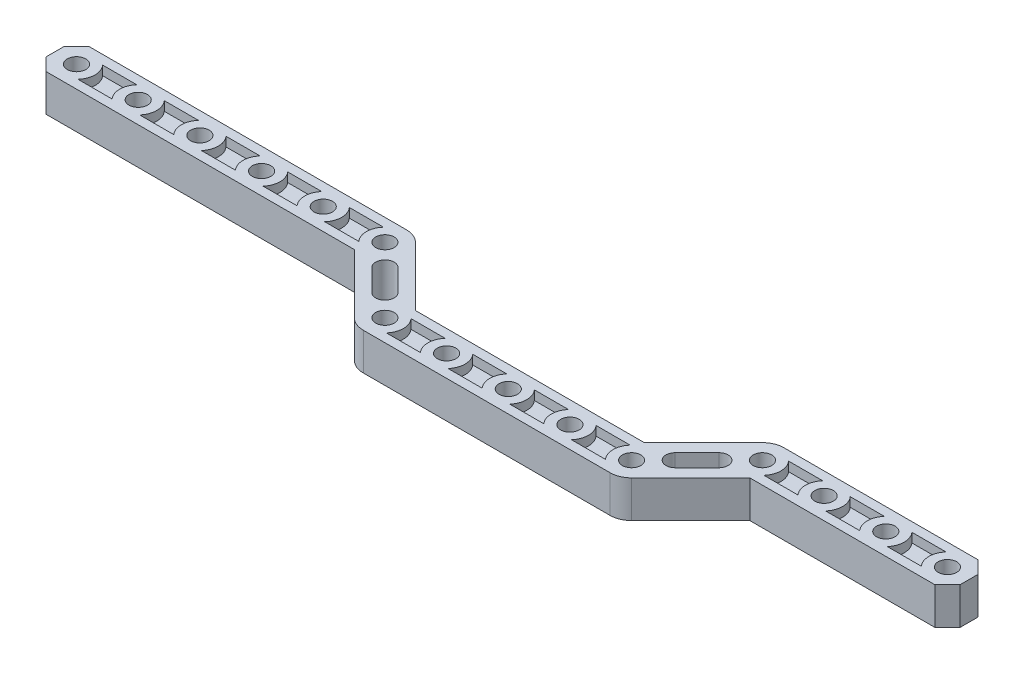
ISO-10303-21;
HEADER;
FILE_DESCRIPTION(('STEP AP214'),'2;1');
FILE_NAME('part.step','',(''),(''),'','','');
FILE_SCHEMA(('AUTOMOTIVE_DESIGN { 1 0 10303 214 1 1 1 1 }'));
ENDSEC;
DATA;
#1=APPLICATION_CONTEXT('core data for automotive mechanical design processes');
#2=APPLICATION_PROTOCOL_DEFINITION('international standard','automotive_design',2000,#1);
#3=PRODUCT_CONTEXT('',#1,'mechanical');
#4=PRODUCT('Part','Part','',(#3));
#5=PRODUCT_RELATED_PRODUCT_CATEGORY('part','',(#4));
#6=PRODUCT_DEFINITION_FORMATION('','',#4);
#7=PRODUCT_DEFINITION_CONTEXT('part definition',#1,'design');
#8=PRODUCT_DEFINITION('design','',#6,#7);
#9=PRODUCT_DEFINITION_SHAPE('','',#8);
#10=(LENGTH_UNIT() NAMED_UNIT(*) SI_UNIT(.MILLI.,.METRE.));
#11=(NAMED_UNIT(*) PLANE_ANGLE_UNIT() SI_UNIT($,.RADIAN.));
#12=(NAMED_UNIT(*) SI_UNIT($,.STERADIAN.) SOLID_ANGLE_UNIT());
#13=UNCERTAINTY_MEASURE_WITH_UNIT(LENGTH_MEASURE(1.E-05),#10,'distance_accuracy_value','');
#14=(GEOMETRIC_REPRESENTATION_CONTEXT(3) GLOBAL_UNCERTAINTY_ASSIGNED_CONTEXT((#13)) GLOBAL_UNIT_ASSIGNED_CONTEXT((#10,
#11,#12)) REPRESENTATION_CONTEXT('',''));
#15=CARTESIAN_POINT('',(0.,0.,0.));
#16=DIRECTION('',(0.,0.,1.));
#17=DIRECTION('',(1.,0.,0.));
#18=AXIS2_PLACEMENT_3D('',#15,#16,#17);
#19=CARTESIAN_POINT('',(60.6066017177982,3.,10.6066017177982));
#20=DIRECTION('',(0.,1.,0.));
#21=DIRECTION('',(0.,0.,1.));
#22=AXIS2_PLACEMENT_3D('',#19,#20,#21);
#23=PLANE('',#22);
#24=DIRECTION('',(1.,0.,0.));
#25=VECTOR('',#24,1.);
#26=CARTESIAN_POINT('',(142.662950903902,3.,1.99999999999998));
#27=LINE('',#26,#25);
#28=CARTESIAN_POINT('',(133.449271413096,3.,1.99999999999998));
#29=VERTEX_POINT('',#28);
#30=CARTESIAN_POINT('',(138.977135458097,3.,1.99999999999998));
#31=VERTEX_POINT('',#30);
#32=EDGE_CURVE('E1248',#29,#31,#27,.T.);
#33=ORIENTED_EDGE('',*,*,#32,.F.);
#34=CARTESIAN_POINT('',(131.213203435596,3.,0.));
#35=DIRECTION('',(0.,1.,0.));
#36=DIRECTION('',(0.,0.,1.));
#37=AXIS2_PLACEMENT_3D('',#34,#35,#36);
#38=CIRCLE('',#37,3.);
#39=CARTESIAN_POINT('',(133.449271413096,3.,-2.00000000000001));
#40=VERTEX_POINT('',#39);
#41=EDGE_CURVE('E1233',#29,#40,#38,.T.);
#42=ORIENTED_EDGE('',*,*,#41,.T.);
#43=DIRECTION('',(-1.,0.,0.));
#44=VECTOR('',#43,1.);
#45=CARTESIAN_POINT('',(142.662950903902,3.,-2.00000000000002));
#46=LINE('',#45,#44);
#47=CARTESIAN_POINT('',(138.977135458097,3.,-2.00000000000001));
#48=VERTEX_POINT('',#47);
#49=EDGE_CURVE('E52',#48,#40,#46,.T.);
#50=ORIENTED_EDGE('',*,*,#49,.F.);
#51=CARTESIAN_POINT('',(141.213203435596,3.,0.));
#52=DIRECTION('',(0.,1.,0.));
#53=DIRECTION('',(0.,0.,1.));
#54=AXIS2_PLACEMENT_3D('',#51,#52,#53);
#55=CIRCLE('',#54,3.);
#56=EDGE_CURVE('E1238',#48,#31,#55,.T.);
#57=ORIENTED_EDGE('',*,*,#56,.T.);
#58=EDGE_LOOP('',(#33,#42,#50,#57));
#59=FACE_BOUND('',#58,.T.);
#60=DIRECTION('',(1.,0.,0.));
#61=VECTOR('',#60,1.);
#62=CARTESIAN_POINT('',(60.6066017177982,3.,12.6066017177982));
#63=LINE('',#62,#61);
#64=CARTESIAN_POINT('',(92.842669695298,3.,12.6066017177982));
#65=VERTEX_POINT('',#64);
#66=CARTESIAN_POINT('',(98.3705337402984,3.,12.6066017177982));
#67=VERTEX_POINT('',#66);
#68=EDGE_CURVE('E1251',#65,#67,#63,.T.);
#69=ORIENTED_EDGE('',*,*,#68,.F.);
#70=CARTESIAN_POINT('',(90.6066017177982,3.,10.6066017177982));
#71=DIRECTION('',(0.,1.,0.));
#72=DIRECTION('',(0.,0.,1.));
#73=AXIS2_PLACEMENT_3D('',#70,#71,#72);
#74=CIRCLE('',#73,3.);
#75=CARTESIAN_POINT('',(92.842669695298,3.,8.60660171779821));
#76=VERTEX_POINT('',#75);
#77=EDGE_CURVE('E1156',#65,#76,#74,.T.);
#78=ORIENTED_EDGE('',*,*,#77,.T.);
#79=DIRECTION('',(-1.,0.,0.));
#80=VECTOR('',#79,1.);
#81=CARTESIAN_POINT('',(62.056349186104,3.,8.60660171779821));
#82=LINE('',#81,#80);
#83=CARTESIAN_POINT('',(98.3705337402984,3.,8.60660171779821));
#84=VERTEX_POINT('',#83);
#85=EDGE_CURVE('E1259',#84,#76,#82,.T.);
#86=ORIENTED_EDGE('',*,*,#85,.F.);
#87=CARTESIAN_POINT('',(100.606601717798,3.,10.6066017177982));
#88=DIRECTION('',(0.,1.,0.));
#89=DIRECTION('',(0.,0.,1.));
#90=AXIS2_PLACEMENT_3D('',#87,#88,#89);
#91=CIRCLE('',#90,3.);
#92=EDGE_CURVE('E1146',#84,#67,#91,.T.);
#93=ORIENTED_EDGE('',*,*,#92,.T.);
#94=EDGE_LOOP('',(#69,#78,#86,#93));
#95=FACE_BOUND('',#94,.T.);
#96=CARTESIAN_POINT('',(68.3705337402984,3.,8.60660171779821));
#97=VERTEX_POINT('',#96);
#98=CARTESIAN_POINT('',(62.842669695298,3.,8.60660171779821));
#99=VERTEX_POINT('',#98);
#100=EDGE_CURVE('E1257',#97,#99,#82,.T.);
#101=ORIENTED_EDGE('',*,*,#100,.F.);
#102=CARTESIAN_POINT('',(70.6066017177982,3.,10.6066017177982));
#103=DIRECTION('',(0.,1.,0.));
#104=DIRECTION('',(0.,0.,1.));
#105=AXIS2_PLACEMENT_3D('',#102,#103,#104);
#106=CIRCLE('',#105,2.99999999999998);
#107=CARTESIAN_POINT('',(68.3705337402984,3.,12.6066017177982));
#108=VERTEX_POINT('',#107);
#109=EDGE_CURVE('E1289',#97,#108,#106,.T.);
#110=ORIENTED_EDGE('',*,*,#109,.T.);
#111=CARTESIAN_POINT('',(62.842669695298,3.,12.6066017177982));
#112=VERTEX_POINT('',#111);
#113=EDGE_CURVE('E1246',#112,#108,#63,.T.);
#114=ORIENTED_EDGE('',*,*,#113,.F.);
#115=CARTESIAN_POINT('',(60.6066017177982,3.,10.6066017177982));
#116=DIRECTION('',(0.,1.,0.));
#117=DIRECTION('',(0.,0.,1.));
#118=AXIS2_PLACEMENT_3D('',#115,#116,#117);
#119=CIRCLE('',#118,2.99999999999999);
#120=EDGE_CURVE('E1165',#112,#99,#119,.T.);
#121=ORIENTED_EDGE('',*,*,#120,.T.);
#122=EDGE_LOOP('',(#101,#110,#114,#121));
#123=FACE_BOUND('',#122,.T.);
#124=DIRECTION('',(1.,0.,0.));
#125=VECTOR('',#124,1.);
#126=CARTESIAN_POINT('',(-1.44974746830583,3.,2.));
#127=LINE('',#126,#125);
#128=CARTESIAN_POINT('',(42.2360679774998,3.,2.));
#129=VERTEX_POINT('',#128);
#130=CARTESIAN_POINT('',(47.7639320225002,3.,2.));
#131=VERTEX_POINT('',#130);
#132=EDGE_CURVE('E1241',#129,#131,#127,.T.);
#133=ORIENTED_EDGE('',*,*,#132,.F.);
#134=CARTESIAN_POINT('',(40.,3.,0.));
#135=DIRECTION('',(0.,1.,0.));
#136=DIRECTION('',(0.,0.,1.));
#137=AXIS2_PLACEMENT_3D('',#134,#135,#136);
#138=CIRCLE('',#137,3.);
#139=CARTESIAN_POINT('',(42.2360679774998,3.,-2.));
#140=VERTEX_POINT('',#139);
#141=EDGE_CURVE('E1216',#129,#140,#138,.T.);
#142=ORIENTED_EDGE('',*,*,#141,.T.);
#143=DIRECTION('',(-1.,0.,0.));
#144=VECTOR('',#143,1.);
#145=CARTESIAN_POINT('',(-1.44974746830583,3.,-2.));
#146=LINE('',#145,#144);
#147=CARTESIAN_POINT('',(47.7639320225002,3.,-2.));
#148=VERTEX_POINT('',#147);
#149=EDGE_CURVE('E1264',#148,#140,#146,.T.);
#150=ORIENTED_EDGE('',*,*,#149,.F.);
#151=CARTESIAN_POINT('',(50.,3.,0.));
#152=DIRECTION('',(0.,1.,0.));
#153=DIRECTION('',(0.,0.,1.));
#154=AXIS2_PLACEMENT_3D('',#151,#152,#153);
#155=CIRCLE('',#154,3.);
#156=EDGE_CURVE('E1221',#148,#131,#155,.T.);
#157=ORIENTED_EDGE('',*,*,#156,.T.);
#158=EDGE_LOOP('',(#133,#142,#150,#157));
#159=FACE_BOUND('',#158,.T.);
#160=CARTESIAN_POINT('',(118.977135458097,3.,-2.));
#161=VERTEX_POINT('',#160);
#162=CARTESIAN_POINT('',(113.449271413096,3.,-2.));
#163=VERTEX_POINT('',#162);
#164=EDGE_CURVE('E1254',#161,#163,#46,.T.);
#165=ORIENTED_EDGE('',*,*,#164,.F.);
#166=CARTESIAN_POINT('',(121.213203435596,3.,0.));
#167=DIRECTION('',(0.,1.,0.));
#168=DIRECTION('',(0.,0.,1.));
#169=AXIS2_PLACEMENT_3D('',#166,#167,#168);
#170=CIRCLE('',#169,3.);
#171=CARTESIAN_POINT('',(118.977135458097,3.,2.));
#172=VERTEX_POINT('',#171);
#173=EDGE_CURVE('E1302',#161,#172,#170,.T.);
#174=ORIENTED_EDGE('',*,*,#173,.T.);
#175=CARTESIAN_POINT('',(113.449271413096,3.,2.));
#176=VERTEX_POINT('',#175);
#177=EDGE_CURVE('E1252',#176,#172,#27,.T.);
#178=ORIENTED_EDGE('',*,*,#177,.F.);
#179=CARTESIAN_POINT('',(111.213203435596,3.,0.));
#180=DIRECTION('',(0.,1.,0.));
#181=DIRECTION('',(0.,0.,1.));
#182=AXIS2_PLACEMENT_3D('',#179,#180,#181);
#183=CIRCLE('',#182,3.00000000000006);
#184=EDGE_CURVE('E1147',#176,#163,#183,.T.);
#185=ORIENTED_EDGE('',*,*,#184,.T.);
#186=EDGE_LOOP('',(#165,#174,#178,#185));
#187=FACE_BOUND('',#186,.T.);
#188=CARTESIAN_POINT('',(131.213203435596,3.,0.));
#189=DIRECTION('',(0.,1.,0.));
#190=DIRECTION('',(0.,0.,1.));
#191=AXIS2_PLACEMENT_3D('',#188,#189,#190);
#192=CIRCLE('',#191,1.5);
#193=CARTESIAN_POINT('',(131.213203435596,3.,1.5));
#194=VERTEX_POINT('',#193);
#195=EDGE_CURVE('E1415',#194,#194,#192,.T.);
#196=ORIENTED_EDGE('',*,*,#195,.F.);
#197=EDGE_LOOP('',(#196));
#198=FACE_BOUND('',#197,.T.);
#199=CARTESIAN_POINT('',(111.213203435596,3.,0.));
#200=DIRECTION('',(0.,1.,0.));
#201=DIRECTION('',(0.,0.,1.));
#202=AXIS2_PLACEMENT_3D('',#199,#200,#201);
#203=CIRCLE('',#202,1.50000000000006);
#204=CARTESIAN_POINT('',(111.213203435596,3.,1.50000000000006));
#205=VERTEX_POINT('',#204);
#206=EDGE_CURVE('E1421',#205,#205,#203,.T.);
#207=ORIENTED_EDGE('',*,*,#206,.F.);
#208=EDGE_LOOP('',(#207));
#209=FACE_BOUND('',#208,.T.);
#210=CARTESIAN_POINT('',(90.6066017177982,3.,10.6066017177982));
#211=DIRECTION('',(0.,1.,0.));
#212=DIRECTION('',(0.,0.,1.));
#213=AXIS2_PLACEMENT_3D('',#210,#211,#212);
#214=CIRCLE('',#213,1.5);
#215=CARTESIAN_POINT('',(90.6066017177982,3.,12.1066017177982));
#216=VERTEX_POINT('',#215);
#217=EDGE_CURVE('E1444',#216,#216,#214,.T.);
#218=ORIENTED_EDGE('',*,*,#217,.F.);
#219=EDGE_LOOP('',(#218));
#220=FACE_BOUND('',#219,.T.);
#221=CARTESIAN_POINT('',(70.6066017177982,3.,10.6066017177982));
#222=DIRECTION('',(0.,1.,0.));
#223=DIRECTION('',(0.,0.,1.));
#224=AXIS2_PLACEMENT_3D('',#221,#222,#223);
#225=CIRCLE('',#224,1.49999999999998);
#226=CARTESIAN_POINT('',(70.6066017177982,3.,12.1066017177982));
#227=VERTEX_POINT('',#226);
#228=EDGE_CURVE('E1450',#227,#227,#225,.T.);
#229=ORIENTED_EDGE('',*,*,#228,.F.);
#230=EDGE_LOOP('',(#229));
#231=FACE_BOUND('',#230,.T.);
#232=DIRECTION('',(0.707106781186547,0.,0.707106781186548));
#233=VECTOR('',#232,1.);
#234=CARTESIAN_POINT('',(52.4748737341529,3.,4.59619407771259));
#235=LINE('',#234,#233);
#236=CARTESIAN_POINT('',(52.4748737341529,3.,4.59619407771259));
#237=VERTEX_POINT('',#236);
#238=CARTESIAN_POINT('',(56.0104076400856,3.,8.13172798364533));
#239=VERTEX_POINT('',#238);
#240=EDGE_CURVE('E1458',#237,#239,#235,.T.);
#241=ORIENTED_EDGE('',*,*,#240,.F.);
#242=CARTESIAN_POINT('',(53.5355339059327,3.,3.53553390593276));
#243=DIRECTION('',(0.,1.,0.));
#244=DIRECTION('',(0.,0.,1.));
#245=AXIS2_PLACEMENT_3D('',#242,#243,#244);
#246=CIRCLE('',#245,1.50000000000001);
#247=CARTESIAN_POINT('',(54.5961940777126,3.,2.47487373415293));
#248=VERTEX_POINT('',#247);
#249=EDGE_CURVE('E1456',#248,#237,#246,.T.);
#250=ORIENTED_EDGE('',*,*,#249,.F.);
#251=DIRECTION('',(-0.707106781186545,0.,-0.70710678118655));
#252=VECTOR('',#251,1.);
#253=CARTESIAN_POINT('',(54.5961940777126,3.,2.47487373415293));
#254=LINE('',#253,#252);
#255=CARTESIAN_POINT('',(58.1317279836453,3.,6.01040764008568));
#256=VERTEX_POINT('',#255);
#257=EDGE_CURVE('E1463',#256,#248,#254,.T.);
#258=ORIENTED_EDGE('',*,*,#257,.F.);
#259=CARTESIAN_POINT('',(57.0710678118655,3.,7.0710678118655));
#260=DIRECTION('',(0.,1.,0.));
#261=DIRECTION('',(0.,0.,1.));
#262=AXIS2_PLACEMENT_3D('',#259,#260,#261);
#263=CIRCLE('',#262,1.5);
#264=EDGE_CURVE('E1460',#239,#256,#263,.T.);
#265=ORIENTED_EDGE('',*,*,#264,.F.);
#266=EDGE_LOOP('',(#241,#250,#258,#265));
#267=FACE_BOUND('',#266,.T.);
#268=CARTESIAN_POINT('',(50.,3.,0.));
#269=DIRECTION('',(0.,1.,0.));
#270=DIRECTION('',(0.,0.,1.));
#271=AXIS2_PLACEMENT_3D('',#268,#269,#270);
#272=CIRCLE('',#271,1.5);
#273=CARTESIAN_POINT('',(50.,3.,1.5));
#274=VERTEX_POINT('',#273);
#275=EDGE_CURVE('E1473',#274,#274,#272,.T.);
#276=ORIENTED_EDGE('',*,*,#275,.F.);
#277=EDGE_LOOP('',(#276));
#278=FACE_BOUND('',#277,.T.);
#279=CARTESIAN_POINT('',(30.,3.,0.));
#280=DIRECTION('',(0.,1.,0.));
#281=DIRECTION('',(0.,0.,1.));
#282=AXIS2_PLACEMENT_3D('',#279,#280,#281);
#283=CIRCLE('',#282,1.5);
#284=CARTESIAN_POINT('',(30.,3.,1.5));
#285=VERTEX_POINT('',#284);
#286=EDGE_CURVE('E1479',#285,#285,#283,.T.);
#287=ORIENTED_EDGE('',*,*,#286,.F.);
#288=EDGE_LOOP('',(#287));
#289=FACE_BOUND('',#288,.T.);
#290=CARTESIAN_POINT('',(10.,3.,0.));
#291=DIRECTION('',(0.,1.,0.));
#292=DIRECTION('',(0.,0.,1.));
#293=AXIS2_PLACEMENT_3D('',#290,#291,#292);
#294=CIRCLE('',#293,1.5);
#295=CARTESIAN_POINT('',(10.,3.,1.5));
#296=VERTEX_POINT('',#295);
#297=EDGE_CURVE('E1485',#296,#296,#294,.T.);
#298=ORIENTED_EDGE('',*,*,#297,.F.);
#299=EDGE_LOOP('',(#298));
#300=FACE_BOUND('',#299,.T.);
#301=DIRECTION('',(-0.707106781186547,0.,0.707106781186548));
#302=VECTOR('',#301,1.);
#303=CARTESIAN_POINT('',(-1.44974746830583,3.,-3.5));
#304=LINE('',#303,#302);
#305=CARTESIAN_POINT('',(-1.44974746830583,3.,-3.5));
#306=VERTEX_POINT('',#305);
#307=CARTESIAN_POINT('',(-3.5,3.,-1.44974746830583));
#308=VERTEX_POINT('',#307);
#309=EDGE_CURVE('E1491',#306,#308,#304,.T.);
#310=ORIENTED_EDGE('',*,*,#309,.T.);
#311=DIRECTION('',(0.,0.,1.));
#312=VECTOR('',#311,1.);
#313=CARTESIAN_POINT('',(-3.5,3.,-1.44974746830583));
#314=LINE('',#313,#312);
#315=CARTESIAN_POINT('',(-3.5,3.,1.44974746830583));
#316=VERTEX_POINT('',#315);
#317=EDGE_CURVE('E1494',#308,#316,#314,.T.);
#318=ORIENTED_EDGE('',*,*,#317,.T.);
#319=DIRECTION('',(0.707106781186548,0.,0.707106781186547));
#320=VECTOR('',#319,1.);
#321=CARTESIAN_POINT('',(-3.5,3.,1.44974746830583));
#322=LINE('',#321,#320);
#323=CARTESIAN_POINT('',(-1.44974746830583,3.,3.5));
#324=VERTEX_POINT('',#323);
#325=EDGE_CURVE('E1496',#316,#324,#322,.T.);
#326=ORIENTED_EDGE('',*,*,#325,.T.);
#327=DIRECTION('',(1.,0.,0.));
#328=VECTOR('',#327,1.);
#329=CARTESIAN_POINT('',(-1.44974746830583,3.,3.5));
#330=LINE('',#329,#328);
#331=CARTESIAN_POINT('',(48.5502525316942,3.,3.5));
#332=VERTEX_POINT('',#331);
#333=EDGE_CURVE('E1498',#324,#332,#330,.T.);
#334=ORIENTED_EDGE('',*,*,#333,.T.);
#335=DIRECTION('',(0.707106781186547,0.,0.707106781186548));
#336=VECTOR('',#335,1.);
#337=CARTESIAN_POINT('',(48.5502525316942,3.,3.5));
#338=LINE('',#337,#336);
#339=CARTESIAN_POINT('',(58.1317279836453,3.,13.0814754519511));
#340=VERTEX_POINT('',#339);
#341=EDGE_CURVE('E1500',#332,#340,#338,.T.);
#342=ORIENTED_EDGE('',*,*,#341,.T.);
#343=CARTESIAN_POINT('',(60.6066017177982,3.,10.6066017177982));
#344=DIRECTION('',(0.,1.,0.));
#345=DIRECTION('',(0.,0.,1.));
#346=AXIS2_PLACEMENT_3D('',#343,#344,#345);
#347=CIRCLE('',#346,3.5);
#348=CARTESIAN_POINT('',(60.6066017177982,3.,14.1066017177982));
#349=VERTEX_POINT('',#348);
#350=EDGE_CURVE('E1502',#340,#349,#347,.T.);
#351=ORIENTED_EDGE('',*,*,#350,.T.);
#352=DIRECTION('',(1.,0.,0.));
#353=VECTOR('',#352,1.);
#354=CARTESIAN_POINT('',(60.6066017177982,3.,14.1066017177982));
#355=LINE('',#354,#353);
#356=CARTESIAN_POINT('',(100.606601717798,3.,14.1066017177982));
#357=VERTEX_POINT('',#356);
#358=EDGE_CURVE('E1504',#349,#357,#355,.T.);
#359=ORIENTED_EDGE('',*,*,#358,.T.);
#360=CARTESIAN_POINT('',(100.606601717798,3.,10.6066017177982));
#361=DIRECTION('',(0.,1.,0.));
#362=DIRECTION('',(0.,0.,1.));
#363=AXIS2_PLACEMENT_3D('',#360,#361,#362);
#364=CIRCLE('',#363,3.49999999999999);
#365=CARTESIAN_POINT('',(103.081475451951,3.,13.0814754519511));
#366=VERTEX_POINT('',#365);
#367=EDGE_CURVE('E1506',#357,#366,#364,.T.);
#368=ORIENTED_EDGE('',*,*,#367,.T.);
#369=DIRECTION('',(0.707106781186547,0.,-0.707106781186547));
#370=VECTOR('',#369,1.);
#371=CARTESIAN_POINT('',(112.662950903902,3.,3.5));
#372=LINE('',#371,#370);
#373=CARTESIAN_POINT('',(112.662950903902,3.,3.5));
#374=VERTEX_POINT('',#373);
#375=EDGE_CURVE('E1508',#366,#374,#372,.T.);
#376=ORIENTED_EDGE('',*,*,#375,.T.);
#377=DIRECTION('',(1.,0.,0.));
#378=VECTOR('',#377,1.);
#379=CARTESIAN_POINT('',(142.662950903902,3.,3.49999999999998));
#380=LINE('',#379,#378);
#381=CARTESIAN_POINT('',(142.662950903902,3.,3.49999999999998));
#382=VERTEX_POINT('',#381);
#383=EDGE_CURVE('E1510',#374,#382,#380,.T.);
#384=ORIENTED_EDGE('',*,*,#383,.T.);
#385=DIRECTION('',(0.707106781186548,0.,-0.707106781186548));
#386=VECTOR('',#385,1.);
#387=CARTESIAN_POINT('',(142.662950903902,3.,3.49999999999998));
#388=LINE('',#387,#386);
#389=CARTESIAN_POINT('',(144.713203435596,3.,1.44974746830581));
#390=VERTEX_POINT('',#389);
#391=EDGE_CURVE('E1512',#382,#390,#388,.T.);
#392=ORIENTED_EDGE('',*,*,#391,.T.);
#393=DIRECTION('',(0.,0.,-1.));
#394=VECTOR('',#393,1.);
#395=CARTESIAN_POINT('',(144.713203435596,3.,1.44974746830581));
#396=LINE('',#395,#394);
#397=CARTESIAN_POINT('',(144.713203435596,3.,-1.44974746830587));
#398=VERTEX_POINT('',#397);
#399=EDGE_CURVE('E1514',#390,#398,#396,.T.);
#400=ORIENTED_EDGE('',*,*,#399,.T.);
#401=DIRECTION('',(-0.707106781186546,0.,-0.707106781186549));
#402=VECTOR('',#401,1.);
#403=CARTESIAN_POINT('',(144.713203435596,3.,-1.44974746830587));
#404=LINE('',#403,#402);
#405=CARTESIAN_POINT('',(142.662950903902,3.,-3.50000000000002));
#406=VERTEX_POINT('',#405);
#407=EDGE_CURVE('E1516',#398,#406,#404,.T.);
#408=ORIENTED_EDGE('',*,*,#407,.T.);
#409=DIRECTION('',(-1.,0.,0.));
#410=VECTOR('',#409,1.);
#411=CARTESIAN_POINT('',(142.662950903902,3.,-3.50000000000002));
#412=LINE('',#411,#410);
#413=CARTESIAN_POINT('',(111.213203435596,3.,-3.49999999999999));
#414=VERTEX_POINT('',#413);
#415=EDGE_CURVE('E1518',#406,#414,#412,.T.);
#416=ORIENTED_EDGE('',*,*,#415,.T.);
#417=CARTESIAN_POINT('',(111.213203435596,3.,0.));
#418=DIRECTION('',(0.,1.,0.));
#419=DIRECTION('',(0.,0.,-1.));
#420=AXIS2_PLACEMENT_3D('',#417,#418,#419);
#421=CIRCLE('',#420,3.49999999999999);
#422=CARTESIAN_POINT('',(108.738329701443,3.,-2.47487373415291));
#423=VERTEX_POINT('',#422);
#424=EDGE_CURVE('E1520',#414,#423,#421,.T.);
#425=ORIENTED_EDGE('',*,*,#424,.T.);
#426=DIRECTION('',(-0.707106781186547,0.,0.707106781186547));
#427=VECTOR('',#426,1.);
#428=CARTESIAN_POINT('',(108.738329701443,3.,-2.47487373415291));
#429=LINE('',#428,#427);
#430=CARTESIAN_POINT('',(99.1568542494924,3.,7.10660171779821));
#431=VERTEX_POINT('',#430);
#432=EDGE_CURVE('E1522',#423,#431,#429,.T.);
#433=ORIENTED_EDGE('',*,*,#432,.T.);
#434=DIRECTION('',(-1.,0.,0.));
#435=VECTOR('',#434,1.);
#436=CARTESIAN_POINT('',(62.056349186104,3.,7.10660171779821));
#437=LINE('',#436,#435);
#438=CARTESIAN_POINT('',(62.056349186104,3.,7.10660171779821));
#439=VERTEX_POINT('',#438);
#440=EDGE_CURVE('E1524',#431,#439,#437,.T.);
#441=ORIENTED_EDGE('',*,*,#440,.T.);
#442=DIRECTION('',(-0.707106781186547,0.,-0.707106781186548));
#443=VECTOR('',#442,1.);
#444=CARTESIAN_POINT('',(52.4748737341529,3.,-2.47487373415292));
#445=LINE('',#444,#443);
#446=CARTESIAN_POINT('',(52.4748737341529,3.,-2.47487373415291));
#447=VERTEX_POINT('',#446);
#448=EDGE_CURVE('E1526',#439,#447,#445,.T.);
#449=ORIENTED_EDGE('',*,*,#448,.T.);
#450=CARTESIAN_POINT('',(50.,3.,0.));
#451=DIRECTION('',(0.,1.,0.));
#452=DIRECTION('',(0.,0.,1.));
#453=AXIS2_PLACEMENT_3D('',#450,#451,#452);
#454=CIRCLE('',#453,3.5);
#455=CARTESIAN_POINT('',(50.,3.,-3.5));
#456=VERTEX_POINT('',#455);
#457=EDGE_CURVE('E1528',#447,#456,#454,.T.);
#458=ORIENTED_EDGE('',*,*,#457,.T.);
#459=DIRECTION('',(-1.,0.,0.));
#460=VECTOR('',#459,1.);
#461=CARTESIAN_POINT('',(-1.44974746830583,3.,-3.5));
#462=LINE('',#461,#460);
#463=EDGE_CURVE('E1530',#456,#306,#462,.T.);
#464=ORIENTED_EDGE('',*,*,#463,.T.);
#465=EDGE_LOOP('',(#310,#318,#326,#334,#342,#351,#359,#368,#376,#384,#392,#400,#408,#416,#425,
#433,#441,#449,#458,#464));
#466=FACE_BOUND('',#465,.T.);
#467=CARTESIAN_POINT('',(0.,3.,0.));
#468=DIRECTION('',(0.,1.,0.));
#469=DIRECTION('',(0.,0.,1.));
#470=AXIS2_PLACEMENT_3D('',#467,#468,#469);
#471=CIRCLE('',#470,1.5);
#472=CARTESIAN_POINT('',(0.,3.,1.5));
#473=VERTEX_POINT('',#472);
#474=EDGE_CURVE('E1488',#473,#473,#471,.T.);
#475=ORIENTED_EDGE('',*,*,#474,.F.);
#476=EDGE_LOOP('',(#475));
#477=FACE_BOUND('',#476,.T.);
#478=CARTESIAN_POINT('',(20.,3.,0.));
#479=DIRECTION('',(0.,1.,0.));
#480=DIRECTION('',(0.,0.,1.));
#481=AXIS2_PLACEMENT_3D('',#478,#479,#480);
#482=CIRCLE('',#481,1.5);
#483=CARTESIAN_POINT('',(20.,3.,1.5));
#484=VERTEX_POINT('',#483);
#485=EDGE_CURVE('E1482',#484,#484,#482,.T.);
#486=ORIENTED_EDGE('',*,*,#485,.F.);
#487=EDGE_LOOP('',(#486));
#488=FACE_BOUND('',#487,.T.);
#489=CARTESIAN_POINT('',(40.,3.,0.));
#490=DIRECTION('',(0.,1.,0.));
#491=DIRECTION('',(0.,0.,1.));
#492=AXIS2_PLACEMENT_3D('',#489,#490,#491);
#493=CIRCLE('',#492,1.5);
#494=CARTESIAN_POINT('',(40.,3.,1.5));
#495=VERTEX_POINT('',#494);
#496=EDGE_CURVE('E1476',#495,#495,#493,.T.);
#497=ORIENTED_EDGE('',*,*,#496,.F.);
#498=EDGE_LOOP('',(#497));
#499=FACE_BOUND('',#498,.T.);
#500=CARTESIAN_POINT('',(60.6066017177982,3.,10.6066017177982));
#501=DIRECTION('',(0.,1.,0.));
#502=DIRECTION('',(0.,0.,1.));
#503=AXIS2_PLACEMENT_3D('',#500,#501,#502);
#504=CIRCLE('',#503,1.49999999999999);
#505=CARTESIAN_POINT('',(60.6066017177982,3.,12.1066017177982));
#506=VERTEX_POINT('',#505);
#507=EDGE_CURVE('E1453',#506,#506,#504,.T.);
#508=ORIENTED_EDGE('',*,*,#507,.F.);
#509=EDGE_LOOP('',(#508));
#510=FACE_BOUND('',#509,.T.);
#511=CARTESIAN_POINT('',(80.6066017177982,3.,10.6066017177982));
#512=DIRECTION('',(0.,1.,0.));
#513=DIRECTION('',(0.,0.,1.));
#514=AXIS2_PLACEMENT_3D('',#511,#512,#513);
#515=CIRCLE('',#514,1.5);
#516=CARTESIAN_POINT('',(80.6066017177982,3.,12.1066017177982));
#517=VERTEX_POINT('',#516);
#518=EDGE_CURVE('E1447',#517,#517,#515,.T.);
#519=ORIENTED_EDGE('',*,*,#518,.F.);
#520=EDGE_LOOP('',(#519));
#521=FACE_BOUND('',#520,.T.);
#522=CARTESIAN_POINT('',(100.606601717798,3.,10.6066017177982));
#523=DIRECTION('',(0.,1.,0.));
#524=DIRECTION('',(0.,0.,1.));
#525=AXIS2_PLACEMENT_3D('',#522,#523,#524);
#526=CIRCLE('',#525,1.5);
#527=CARTESIAN_POINT('',(100.606601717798,3.,12.1066017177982));
#528=VERTEX_POINT('',#527);
#529=EDGE_CURVE('E1441',#528,#528,#526,.T.);
#530=ORIENTED_EDGE('',*,*,#529,.F.);
#531=EDGE_LOOP('',(#530));
#532=FACE_BOUND('',#531,.T.);
#533=DIRECTION('',(-0.707106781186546,0.,0.707106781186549));
#534=VECTOR('',#533,1.);
#535=CARTESIAN_POINT('',(106.617009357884,3.,2.47487373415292));
#536=LINE('',#535,#534);
#537=CARTESIAN_POINT('',(106.617009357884,3.,2.47487373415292));
#538=VERTEX_POINT('',#537);
#539=CARTESIAN_POINT('',(103.081475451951,3.,6.01040764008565));
#540=VERTEX_POINT('',#539);
#541=EDGE_CURVE('E1426',#538,#540,#536,.T.);
#542=ORIENTED_EDGE('',*,*,#541,.F.);
#543=CARTESIAN_POINT('',(107.677669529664,3.,3.53553390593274));
#544=DIRECTION('',(0.,1.,0.));
#545=DIRECTION('',(0.,0.,1.));
#546=AXIS2_PLACEMENT_3D('',#543,#544,#545);
#547=CIRCLE('',#546,1.50000000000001);
#548=CARTESIAN_POINT('',(108.738329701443,3.,4.59619407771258));
#549=VERTEX_POINT('',#548);
#550=EDGE_CURVE('E1424',#549,#538,#547,.T.);
#551=ORIENTED_EDGE('',*,*,#550,.F.);
#552=DIRECTION('',(0.707106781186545,0.,-0.70710678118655));
#553=VECTOR('',#552,1.);
#554=CARTESIAN_POINT('',(108.738329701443,3.,4.59619407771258));
#555=LINE('',#554,#553);
#556=CARTESIAN_POINT('',(105.202795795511,3.,8.1317279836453));
#557=VERTEX_POINT('',#556);
#558=EDGE_CURVE('E1431',#557,#549,#555,.T.);
#559=ORIENTED_EDGE('',*,*,#558,.F.);
#560=CARTESIAN_POINT('',(104.142135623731,3.,7.07106781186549));
#561=DIRECTION('',(0.,1.,0.));
#562=DIRECTION('',(0.,0.,1.));
#563=AXIS2_PLACEMENT_3D('',#560,#561,#562);
#564=CIRCLE('',#563,1.50000000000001);
#565=EDGE_CURVE('E1428',#540,#557,#564,.T.);
#566=ORIENTED_EDGE('',*,*,#565,.F.);
#567=EDGE_LOOP('',(#542,#551,#559,#566));
#568=FACE_BOUND('',#567,.T.);
#569=CARTESIAN_POINT('',(121.213203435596,3.,0.));
#570=DIRECTION('',(0.,1.,0.));
#571=DIRECTION('',(0.,0.,1.));
#572=AXIS2_PLACEMENT_3D('',#569,#570,#571);
#573=CIRCLE('',#572,1.5);
#574=CARTESIAN_POINT('',(121.213203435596,3.,1.5));
#575=VERTEX_POINT('',#574);
#576=EDGE_CURVE('E1418',#575,#575,#573,.T.);
#577=ORIENTED_EDGE('',*,*,#576,.F.);
#578=EDGE_LOOP('',(#577));
#579=FACE_BOUND('',#578,.T.);
#580=CARTESIAN_POINT('',(141.213203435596,3.,0.));
#581=DIRECTION('',(0.,1.,0.));
#582=DIRECTION('',(0.,0.,1.));
#583=AXIS2_PLACEMENT_3D('',#580,#581,#582);
#584=CIRCLE('',#583,1.5);
#585=CARTESIAN_POINT('',(141.213203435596,3.,1.5));
#586=VERTEX_POINT('',#585);
#587=EDGE_CURVE('E1412',#586,#586,#584,.T.);
#588=ORIENTED_EDGE('',*,*,#587,.F.);
#589=EDGE_LOOP('',(#588));
#590=FACE_BOUND('',#589,.T.);
#591=CARTESIAN_POINT('',(2.23606797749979,3.,2.));
#592=VERTEX_POINT('',#591);
#593=CARTESIAN_POINT('',(7.76393202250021,3.,2.));
#594=VERTEX_POINT('',#593);
#595=EDGE_CURVE('E3698',#592,#594,#127,.T.);
#596=ORIENTED_EDGE('',*,*,#595,.F.);
#597=CARTESIAN_POINT('',(0.,3.,0.));
#598=DIRECTION('',(0.,1.,0.));
#599=DIRECTION('',(0.,0.,1.));
#600=AXIS2_PLACEMENT_3D('',#597,#598,#599);
#601=CIRCLE('',#600,3.);
#602=CARTESIAN_POINT('',(2.23606797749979,3.,-2.));
#603=VERTEX_POINT('',#602);
#604=EDGE_CURVE('E1200',#592,#603,#601,.T.);
#605=ORIENTED_EDGE('',*,*,#604,.T.);
#606=CARTESIAN_POINT('',(7.76393202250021,3.,-2.));
#607=VERTEX_POINT('',#606);
#608=EDGE_CURVE('E1261',#607,#603,#146,.T.);
#609=ORIENTED_EDGE('',*,*,#608,.F.);
#610=CARTESIAN_POINT('',(10.,3.,0.));
#611=DIRECTION('',(0.,1.,0.));
#612=DIRECTION('',(0.,0.,1.));
#613=AXIS2_PLACEMENT_3D('',#610,#611,#612);
#614=CIRCLE('',#613,3.);
#615=EDGE_CURVE('E1273',#607,#594,#614,.T.);
#616=ORIENTED_EDGE('',*,*,#615,.T.);
#617=EDGE_LOOP('',(#596,#605,#609,#616));
#618=FACE_BOUND('',#617,.T.);
#619=CARTESIAN_POINT('',(12.2360679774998,3.,2.));
#620=VERTEX_POINT('',#619);
#621=CARTESIAN_POINT('',(17.7639320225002,3.,2.));
#622=VERTEX_POINT('',#621);
#623=EDGE_CURVE('E3701',#620,#622,#127,.T.);
#624=ORIENTED_EDGE('',*,*,#623,.F.);
#625=CARTESIAN_POINT('',(12.2360679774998,3.,-2.));
#626=VERTEX_POINT('',#625);
#627=EDGE_CURVE('E1201',#620,#626,#614,.T.);
#628=ORIENTED_EDGE('',*,*,#627,.T.);
#629=CARTESIAN_POINT('',(17.7639320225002,3.,-2.));
#630=VERTEX_POINT('',#629);
#631=EDGE_CURVE('E3754',#630,#626,#146,.T.);
#632=ORIENTED_EDGE('',*,*,#631,.F.);
#633=CARTESIAN_POINT('',(20.,3.,0.));
#634=DIRECTION('',(0.,1.,0.));
#635=DIRECTION('',(0.,0.,1.));
#636=AXIS2_PLACEMENT_3D('',#633,#634,#635);
#637=CIRCLE('',#636,3.);
#638=EDGE_CURVE('E1276',#630,#622,#637,.T.);
#639=ORIENTED_EDGE('',*,*,#638,.T.);
#640=EDGE_LOOP('',(#624,#628,#632,#639));
#641=FACE_BOUND('',#640,.T.);
#642=CARTESIAN_POINT('',(22.2360679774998,3.,2.));
#643=VERTEX_POINT('',#642);
#644=CARTESIAN_POINT('',(27.7639320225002,3.,2.));
#645=VERTEX_POINT('',#644);
#646=EDGE_CURVE('E1245',#643,#645,#127,.T.);
#647=ORIENTED_EDGE('',*,*,#646,.F.);
#648=CARTESIAN_POINT('',(22.2360679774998,3.,-2.));
#649=VERTEX_POINT('',#648);
#650=EDGE_CURVE('E1206',#643,#649,#637,.T.);
#651=ORIENTED_EDGE('',*,*,#650,.T.);
#652=CARTESIAN_POINT('',(27.7639320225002,3.,-2.));
#653=VERTEX_POINT('',#652);
#654=EDGE_CURVE('E1268',#653,#649,#146,.T.);
#655=ORIENTED_EDGE('',*,*,#654,.F.);
#656=CARTESIAN_POINT('',(30.,3.,0.));
#657=DIRECTION('',(0.,1.,0.));
#658=DIRECTION('',(0.,0.,1.));
#659=AXIS2_PLACEMENT_3D('',#656,#657,#658);
#660=CIRCLE('',#659,3.);
#661=EDGE_CURVE('E1279',#653,#645,#660,.T.);
#662=ORIENTED_EDGE('',*,*,#661,.T.);
#663=EDGE_LOOP('',(#647,#651,#655,#662));
#664=FACE_BOUND('',#663,.T.);
#665=CARTESIAN_POINT('',(32.2360679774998,3.,2.));
#666=VERTEX_POINT('',#665);
#667=CARTESIAN_POINT('',(37.7639320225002,3.,2.));
#668=VERTEX_POINT('',#667);
#669=EDGE_CURVE('E1244',#666,#668,#127,.T.);
#670=ORIENTED_EDGE('',*,*,#669,.F.);
#671=CARTESIAN_POINT('',(32.2360679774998,3.,-2.));
#672=VERTEX_POINT('',#671);
#673=EDGE_CURVE('E1211',#666,#672,#660,.T.);
#674=ORIENTED_EDGE('',*,*,#673,.T.);
#675=CARTESIAN_POINT('',(37.7639320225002,3.,-2.));
#676=VERTEX_POINT('',#675);
#677=EDGE_CURVE('E1267',#676,#672,#146,.T.);
#678=ORIENTED_EDGE('',*,*,#677,.F.);
#679=EDGE_CURVE('E1282',#676,#668,#138,.T.);
#680=ORIENTED_EDGE('',*,*,#679,.T.);
#681=EDGE_LOOP('',(#670,#674,#678,#680));
#682=FACE_BOUND('',#681,.T.);
#683=CARTESIAN_POINT('',(72.842669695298,3.,12.6066017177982));
#684=VERTEX_POINT('',#683);
#685=CARTESIAN_POINT('',(78.3705337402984,3.,12.6066017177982));
#686=VERTEX_POINT('',#685);
#687=EDGE_CURVE('E1249',#684,#686,#63,.T.);
#688=ORIENTED_EDGE('',*,*,#687,.F.);
#689=CARTESIAN_POINT('',(72.842669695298,3.,8.60660171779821));
#690=VERTEX_POINT('',#689);
#691=EDGE_CURVE('E1166',#684,#690,#106,.T.);
#692=ORIENTED_EDGE('',*,*,#691,.T.);
#693=CARTESIAN_POINT('',(78.3705337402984,3.,8.60660171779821));
#694=VERTEX_POINT('',#693);
#695=EDGE_CURVE('E1263',#694,#690,#82,.T.);
#696=ORIENTED_EDGE('',*,*,#695,.F.);
#697=CARTESIAN_POINT('',(80.6066017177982,3.,10.6066017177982));
#698=DIRECTION('',(0.,1.,0.));
#699=DIRECTION('',(0.,0.,1.));
#700=AXIS2_PLACEMENT_3D('',#697,#698,#699);
#701=CIRCLE('',#700,3.);
#702=EDGE_CURVE('E1292',#694,#686,#701,.T.);
#703=ORIENTED_EDGE('',*,*,#702,.T.);
#704=EDGE_LOOP('',(#688,#692,#696,#703));
#705=FACE_BOUND('',#704,.T.);
#706=CARTESIAN_POINT('',(82.842669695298,3.,12.6066017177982));
#707=VERTEX_POINT('',#706);
#708=CARTESIAN_POINT('',(88.3705337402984,3.,12.6066017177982));
#709=VERTEX_POINT('',#708);
#710=EDGE_CURVE('E1250',#707,#709,#63,.T.);
#711=ORIENTED_EDGE('',*,*,#710,.F.);
#712=CARTESIAN_POINT('',(82.842669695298,3.,8.60660171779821));
#713=VERTEX_POINT('',#712);
#714=EDGE_CURVE('E1161',#707,#713,#701,.T.);
#715=ORIENTED_EDGE('',*,*,#714,.T.);
#716=CARTESIAN_POINT('',(88.3705337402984,3.,8.60660171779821));
#717=VERTEX_POINT('',#716);
#718=EDGE_CURVE('E1262',#717,#713,#82,.T.);
#719=ORIENTED_EDGE('',*,*,#718,.F.);
#720=EDGE_CURVE('E1295',#717,#709,#74,.T.);
#721=ORIENTED_EDGE('',*,*,#720,.T.);
#722=EDGE_LOOP('',(#711,#715,#719,#721));
#723=FACE_BOUND('',#722,.T.);
#724=CARTESIAN_POINT('',(123.449271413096,3.,1.99999999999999));
#725=VERTEX_POINT('',#724);
#726=CARTESIAN_POINT('',(128.977135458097,3.,1.99999999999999));
#727=VERTEX_POINT('',#726);
#728=EDGE_CURVE('E1255',#725,#727,#27,.T.);
#729=ORIENTED_EDGE('',*,*,#728,.F.);
#730=CARTESIAN_POINT('',(123.449271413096,3.,-2.00000000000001));
#731=VERTEX_POINT('',#730);
#732=EDGE_CURVE('E1228',#725,#731,#170,.T.);
#733=ORIENTED_EDGE('',*,*,#732,.T.);
#734=CARTESIAN_POINT('',(128.977135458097,3.,-2.00000000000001));
#735=VERTEX_POINT('',#734);
#736=EDGE_CURVE('E1258',#735,#731,#46,.T.);
#737=ORIENTED_EDGE('',*,*,#736,.F.);
#738=EDGE_CURVE('E60',#735,#727,#38,.T.);
#739=ORIENTED_EDGE('',*,*,#738,.T.);
#740=EDGE_LOOP('',(#729,#733,#737,#739));
#741=FACE_BOUND('',#740,.T.);
#742=ADVANCED_FACE('F37',(#59,#95,#123,#159,#187,#198,#209,#220,#231,#267,#278,#289,#300,#466,
#477,#488,#499,#510,#521,#532,#568,#579,#590,#618,#641,#664,#682,#705,#723,#741),#23,.T.);
#743=CARTESIAN_POINT('',(-1.44974746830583,3.,-3.5));
#744=DIRECTION('',(0.707106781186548,0.,0.707106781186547));
#745=DIRECTION('',(0.707106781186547,0.,-0.707106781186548));
#746=AXIS2_PLACEMENT_3D('',#743,#744,#745);
#747=PLANE('',#746);
#748=DIRECTION('',(0.,-1.,0.));
#749=VECTOR('',#748,1.);
#750=CARTESIAN_POINT('',(-1.44974746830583,3.,-3.5));
#751=LINE('',#750,#749);
#752=CARTESIAN_POINT('',(-1.44974746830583,-3.,-3.5));
#753=VERTEX_POINT('',#752);
#754=EDGE_CURVE('E1532',#306,#753,#751,.T.);
#755=ORIENTED_EDGE('',*,*,#754,.T.);
#756=DIRECTION('',(-0.707106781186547,0.,0.707106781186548));
#757=VECTOR('',#756,1.);
#758=CARTESIAN_POINT('',(-1.44974746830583,-3.,-3.5));
#759=LINE('',#758,#757);
#760=CARTESIAN_POINT('',(-3.5,-3.,-1.44974746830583));
#761=VERTEX_POINT('',#760);
#762=EDGE_CURVE('E1082',#753,#761,#759,.T.);
#763=ORIENTED_EDGE('',*,*,#762,.T.);
#764=DIRECTION('',(0.,-1.,0.));
#765=VECTOR('',#764,1.);
#766=CARTESIAN_POINT('',(-3.5,3.,-1.44974746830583));
#767=LINE('',#766,#765);
#768=EDGE_CURVE('E11',#308,#761,#767,.T.);
#769=ORIENTED_EDGE('',*,*,#768,.F.);
#770=ORIENTED_EDGE('',*,*,#309,.F.);
#771=EDGE_LOOP('',(#755,#763,#769,#770));
#772=FACE_BOUND('',#771,.T.);
#773=ADVANCED_FACE('F39',(#772),#747,.F.);
#774=CARTESIAN_POINT('',(-3.5,3.,-1.44974746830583));
#775=DIRECTION('',(1.,0.,0.));
#776=DIRECTION('',(0.,0.,-1.));
#777=AXIS2_PLACEMENT_3D('',#774,#775,#776);
#778=PLANE('',#777);
#779=ORIENTED_EDGE('',*,*,#768,.T.);
#780=DIRECTION('',(0.,0.,1.));
#781=VECTOR('',#780,1.);
#782=CARTESIAN_POINT('',(-3.5,-3.,-1.44974746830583));
#783=LINE('',#782,#781);
#784=CARTESIAN_POINT('',(-3.5,-3.,1.44974746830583));
#785=VERTEX_POINT('',#784);
#786=EDGE_CURVE('E1085',#761,#785,#783,.T.);
#787=ORIENTED_EDGE('',*,*,#786,.T.);
#788=DIRECTION('',(0.,-1.,0.));
#789=VECTOR('',#788,1.);
#790=CARTESIAN_POINT('',(-3.5,3.,1.44974746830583));
#791=LINE('',#790,#789);
#792=EDGE_CURVE('E45',#316,#785,#791,.T.);
#793=ORIENTED_EDGE('',*,*,#792,.F.);
#794=ORIENTED_EDGE('',*,*,#317,.F.);
#795=EDGE_LOOP('',(#779,#787,#793,#794));
#796=FACE_BOUND('',#795,.T.);
#797=ADVANCED_FACE('F1576',(#796),#778,.F.);
#798=CARTESIAN_POINT('',(-3.5,3.,1.44974746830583));
#799=DIRECTION('',(0.707106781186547,0.,-0.707106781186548));
#800=DIRECTION('',(-0.707106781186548,0.,-0.707106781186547));
#801=AXIS2_PLACEMENT_3D('',#798,#799,#800);
#802=PLANE('',#801);
#803=ORIENTED_EDGE('',*,*,#792,.T.);
#804=DIRECTION('',(0.707106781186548,0.,0.707106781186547));
#805=VECTOR('',#804,1.);
#806=CARTESIAN_POINT('',(-3.5,-3.,1.44974746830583));
#807=LINE('',#806,#805);
#808=CARTESIAN_POINT('',(-1.44974746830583,-3.,3.5));
#809=VERTEX_POINT('',#808);
#810=EDGE_CURVE('E1088',#785,#809,#807,.T.);
#811=ORIENTED_EDGE('',*,*,#810,.T.);
#812=DIRECTION('',(0.,-1.,0.));
#813=VECTOR('',#812,1.);
#814=CARTESIAN_POINT('',(-1.44974746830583,3.,3.5));
#815=LINE('',#814,#813);
#816=EDGE_CURVE('E1566',#324,#809,#815,.T.);
#817=ORIENTED_EDGE('',*,*,#816,.F.);
#818=ORIENTED_EDGE('',*,*,#325,.F.);
#819=EDGE_LOOP('',(#803,#811,#817,#818));
#820=FACE_BOUND('',#819,.T.);
#821=ADVANCED_FACE('F1570',(#820),#802,.F.);
#822=CARTESIAN_POINT('',(-1.44974746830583,3.,3.5));
#823=DIRECTION('',(0.,0.,-1.));
#824=DIRECTION('',(-1.,0.,0.));
#825=AXIS2_PLACEMENT_3D('',#822,#823,#824);
#826=PLANE('',#825);
#827=ORIENTED_EDGE('',*,*,#816,.T.);
#828=DIRECTION('',(1.,0.,0.));
#829=VECTOR('',#828,1.);
#830=CARTESIAN_POINT('',(-1.44974746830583,-3.,3.5));
#831=LINE('',#830,#829);
#832=CARTESIAN_POINT('',(48.5502525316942,-3.,3.5));
#833=VERTEX_POINT('',#832);
#834=EDGE_CURVE('E1091',#809,#833,#831,.T.);
#835=ORIENTED_EDGE('',*,*,#834,.T.);
#836=DIRECTION('',(0.,-1.,0.));
#837=VECTOR('',#836,1.);
#838=CARTESIAN_POINT('',(48.5502525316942,3.,3.5));
#839=LINE('',#838,#837);
#840=EDGE_CURVE('E1564',#332,#833,#839,.T.);
#841=ORIENTED_EDGE('',*,*,#840,.F.);
#842=ORIENTED_EDGE('',*,*,#333,.F.);
#843=EDGE_LOOP('',(#827,#835,#841,#842));
#844=FACE_BOUND('',#843,.T.);
#845=ADVANCED_FACE('F1586',(#844),#826,.F.);
#846=CARTESIAN_POINT('',(48.5502525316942,3.,3.5));
#847=DIRECTION('',(0.707106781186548,0.,-0.707106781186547));
#848=DIRECTION('',(-0.707106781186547,0.,-0.707106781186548));
#849=AXIS2_PLACEMENT_3D('',#846,#847,#848);
#850=PLANE('',#849);
#851=ORIENTED_EDGE('',*,*,#840,.T.);
#852=DIRECTION('',(0.707106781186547,0.,0.707106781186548));
#853=VECTOR('',#852,1.);
#854=CARTESIAN_POINT('',(48.5502525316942,-3.,3.5));
#855=LINE('',#854,#853);
#856=CARTESIAN_POINT('',(58.1317279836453,-3.,13.0814754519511));
#857=VERTEX_POINT('',#856);
#858=EDGE_CURVE('E1094',#833,#857,#855,.T.);
#859=ORIENTED_EDGE('',*,*,#858,.T.);
#860=DIRECTION('',(0.,-1.,0.));
#861=VECTOR('',#860,1.);
#862=CARTESIAN_POINT('',(58.1317279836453,3.,13.0814754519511));
#863=LINE('',#862,#861);
#864=EDGE_CURVE('E1562',#340,#857,#863,.T.);
#865=ORIENTED_EDGE('',*,*,#864,.F.);
#866=ORIENTED_EDGE('',*,*,#341,.F.);
#867=EDGE_LOOP('',(#851,#859,#865,#866));
#868=FACE_BOUND('',#867,.T.);
#869=ADVANCED_FACE('F1669',(#868),#850,.F.);
#870=CARTESIAN_POINT('',(60.6066017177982,3.,10.6066017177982));
#871=DIRECTION('',(0.,-1.,0.));
#872=DIRECTION('',(0.,0.,-1.));
#873=AXIS2_PLACEMENT_3D('',#870,#871,#872);
#874=CYLINDRICAL_SURFACE('',#873,3.5);
#875=ORIENTED_EDGE('',*,*,#864,.T.);
#876=CARTESIAN_POINT('',(60.6066017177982,-3.,10.6066017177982));
#877=DIRECTION('',(0.,1.,0.));
#878=DIRECTION('',(0.,0.,1.));
#879=AXIS2_PLACEMENT_3D('',#876,#877,#878);
#880=CIRCLE('',#879,3.5);
#881=CARTESIAN_POINT('',(60.6066017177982,-3.,14.1066017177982));
#882=VERTEX_POINT('',#881);
#883=EDGE_CURVE('E1097',#857,#882,#880,.T.);
#884=ORIENTED_EDGE('',*,*,#883,.T.);
#885=DIRECTION('',(0.,-1.,0.));
#886=VECTOR('',#885,1.);
#887=CARTESIAN_POINT('',(60.6066017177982,3.,14.1066017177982));
#888=LINE('',#887,#886);
#889=EDGE_CURVE('E1560',#349,#882,#888,.T.);
#890=ORIENTED_EDGE('',*,*,#889,.F.);
#891=ORIENTED_EDGE('',*,*,#350,.F.);
#892=EDGE_LOOP('',(#875,#884,#890,#891));
#893=FACE_BOUND('',#892,.T.);
#894=ADVANCED_FACE('F1667',(#893),#874,.T.);
#895=CARTESIAN_POINT('',(60.6066017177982,3.,14.1066017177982));
#896=DIRECTION('',(0.,0.,-1.));
#897=DIRECTION('',(-1.,0.,0.));
#898=AXIS2_PLACEMENT_3D('',#895,#896,#897);
#899=PLANE('',#898);
#900=ORIENTED_EDGE('',*,*,#889,.T.);
#901=DIRECTION('',(1.,0.,0.));
#902=VECTOR('',#901,1.);
#903=CARTESIAN_POINT('',(60.6066017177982,-3.,14.1066017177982));
#904=LINE('',#903,#902);
#905=CARTESIAN_POINT('',(100.606601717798,-3.,14.1066017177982));
#906=VERTEX_POINT('',#905);
#907=EDGE_CURVE('E1100',#882,#906,#904,.T.);
#908=ORIENTED_EDGE('',*,*,#907,.T.);
#909=DIRECTION('',(0.,-1.,0.));
#910=VECTOR('',#909,1.);
#911=CARTESIAN_POINT('',(100.606601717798,3.,14.1066017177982));
#912=LINE('',#911,#910);
#913=EDGE_CURVE('E1558',#357,#906,#912,.T.);
#914=ORIENTED_EDGE('',*,*,#913,.F.);
#915=ORIENTED_EDGE('',*,*,#358,.F.);
#916=EDGE_LOOP('',(#900,#908,#914,#915));
#917=FACE_BOUND('',#916,.T.);
#918=ADVANCED_FACE('F1663',(#917),#899,.F.);
#919=CARTESIAN_POINT('',(100.606601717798,3.,10.6066017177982));
#920=DIRECTION('',(0.,-1.,0.));
#921=DIRECTION('',(0.,0.,-1.));
#922=AXIS2_PLACEMENT_3D('',#919,#920,#921);
#923=CYLINDRICAL_SURFACE('',#922,3.49999999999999);
#924=ORIENTED_EDGE('',*,*,#913,.T.);
#925=CARTESIAN_POINT('',(100.606601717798,-3.,10.6066017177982));
#926=DIRECTION('',(0.,1.,0.));
#927=DIRECTION('',(0.,0.,1.));
#928=AXIS2_PLACEMENT_3D('',#925,#926,#927);
#929=CIRCLE('',#928,3.49999999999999);
#930=CARTESIAN_POINT('',(103.081475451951,-3.,13.0814754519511));
#931=VERTEX_POINT('',#930);
#932=EDGE_CURVE('E1103',#906,#931,#929,.T.);
#933=ORIENTED_EDGE('',*,*,#932,.T.);
#934=DIRECTION('',(0.,-1.,0.));
#935=VECTOR('',#934,1.);
#936=CARTESIAN_POINT('',(103.081475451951,3.,13.0814754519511));
#937=LINE('',#936,#935);
#938=EDGE_CURVE('E1556',#366,#931,#937,.T.);
#939=ORIENTED_EDGE('',*,*,#938,.F.);
#940=ORIENTED_EDGE('',*,*,#367,.F.);
#941=EDGE_LOOP('',(#924,#933,#939,#940));
#942=FACE_BOUND('',#941,.T.);
#943=ADVANCED_FACE('F1658',(#942),#923,.T.);
#944=CARTESIAN_POINT('',(112.662950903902,3.,3.5));
#945=DIRECTION('',(-0.707106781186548,0.,-0.707106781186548));
#946=DIRECTION('',(-0.707106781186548,0.,0.707106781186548));
#947=AXIS2_PLACEMENT_3D('',#944,#945,#946);
#948=PLANE('',#947);
#949=ORIENTED_EDGE('',*,*,#938,.T.);
#950=DIRECTION('',(0.707106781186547,0.,-0.707106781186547));
#951=VECTOR('',#950,1.);
#952=CARTESIAN_POINT('',(112.662950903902,-3.,3.5));
#953=LINE('',#952,#951);
#954=CARTESIAN_POINT('',(112.662950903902,-3.,3.5));
#955=VERTEX_POINT('',#954);
#956=EDGE_CURVE('E1106',#931,#955,#953,.T.);
#957=ORIENTED_EDGE('',*,*,#956,.T.);
#958=DIRECTION('',(0.,-1.,0.));
#959=VECTOR('',#958,1.);
#960=CARTESIAN_POINT('',(112.662950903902,3.,3.5));
#961=LINE('',#960,#959);
#962=EDGE_CURVE('E1554',#374,#955,#961,.T.);
#963=ORIENTED_EDGE('',*,*,#962,.F.);
#964=ORIENTED_EDGE('',*,*,#375,.F.);
#965=EDGE_LOOP('',(#949,#957,#963,#964));
#966=FACE_BOUND('',#965,.T.);
#967=ADVANCED_FACE('F1653',(#966),#948,.F.);
#968=CARTESIAN_POINT('',(142.662950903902,3.,3.49999999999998));
#969=DIRECTION('',(0.,0.,-1.));
#970=DIRECTION('',(-1.,0.,0.));
#971=AXIS2_PLACEMENT_3D('',#968,#969,#970);
#972=PLANE('',#971);
#973=ORIENTED_EDGE('',*,*,#962,.T.);
#974=DIRECTION('',(1.,0.,0.));
#975=VECTOR('',#974,1.);
#976=CARTESIAN_POINT('',(142.662950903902,-3.,3.49999999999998));
#977=LINE('',#976,#975);
#978=CARTESIAN_POINT('',(142.662950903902,-3.,3.49999999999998));
#979=VERTEX_POINT('',#978);
#980=EDGE_CURVE('E1109',#955,#979,#977,.T.);
#981=ORIENTED_EDGE('',*,*,#980,.T.);
#982=DIRECTION('',(0.,-1.,0.));
#983=VECTOR('',#982,1.);
#984=CARTESIAN_POINT('',(142.662950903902,3.,3.49999999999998));
#985=LINE('',#984,#983);
#986=EDGE_CURVE('E1552',#382,#979,#985,.T.);
#987=ORIENTED_EDGE('',*,*,#986,.F.);
#988=ORIENTED_EDGE('',*,*,#383,.F.);
#989=EDGE_LOOP('',(#973,#981,#987,#988));
#990=FACE_BOUND('',#989,.T.);
#991=ADVANCED_FACE('F1649',(#990),#972,.F.);
#992=CARTESIAN_POINT('',(142.662950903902,3.,3.49999999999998));
#993=DIRECTION('',(-0.707106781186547,0.,-0.707106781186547));
#994=DIRECTION('',(-0.707106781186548,0.,0.707106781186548));
#995=AXIS2_PLACEMENT_3D('',#992,#993,#994);
#996=PLANE('',#995);
#997=ORIENTED_EDGE('',*,*,#986,.T.);
#998=DIRECTION('',(0.707106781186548,0.,-0.707106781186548));
#999=VECTOR('',#998,1.);
#1000=CARTESIAN_POINT('',(142.662950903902,-3.,3.49999999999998));
#1001=LINE('',#1000,#999);
#1002=CARTESIAN_POINT('',(144.713203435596,-3.,1.44974746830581));
#1003=VERTEX_POINT('',#1002);
#1004=EDGE_CURVE('E1112',#979,#1003,#1001,.T.);
#1005=ORIENTED_EDGE('',*,*,#1004,.T.);
#1006=DIRECTION('',(0.,-1.,0.));
#1007=VECTOR('',#1006,1.);
#1008=CARTESIAN_POINT('',(144.713203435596,3.,1.44974746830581));
#1009=LINE('',#1008,#1007);
#1010=EDGE_CURVE('E1550',#390,#1003,#1009,.T.);
#1011=ORIENTED_EDGE('',*,*,#1010,.F.);
#1012=ORIENTED_EDGE('',*,*,#391,.F.);
#1013=EDGE_LOOP('',(#997,#1005,#1011,#1012));
#1014=FACE_BOUND('',#1013,.T.);
#1015=ADVANCED_FACE('F1644',(#1014),#996,.F.);
#1016=CARTESIAN_POINT('',(144.713203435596,3.,1.44974746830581));
#1017=DIRECTION('',(-1.,0.,0.));
#1018=DIRECTION('',(0.,0.,1.));
#1019=AXIS2_PLACEMENT_3D('',#1016,#1017,#1018);
#1020=PLANE('',#1019);
#1021=ORIENTED_EDGE('',*,*,#1010,.T.);
#1022=DIRECTION('',(0.,0.,-1.));
#1023=VECTOR('',#1022,1.);
#1024=CARTESIAN_POINT('',(144.713203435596,-3.,1.44974746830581));
#1025=LINE('',#1024,#1023);
#1026=CARTESIAN_POINT('',(144.713203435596,-3.,-1.44974746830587));
#1027=VERTEX_POINT('',#1026);
#1028=EDGE_CURVE('E1115',#1003,#1027,#1025,.T.);
#1029=ORIENTED_EDGE('',*,*,#1028,.T.);
#1030=DIRECTION('',(0.,-1.,0.));
#1031=VECTOR('',#1030,1.);
#1032=CARTESIAN_POINT('',(144.713203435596,3.,-1.44974746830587));
#1033=LINE('',#1032,#1031);
#1034=EDGE_CURVE('E1548',#398,#1027,#1033,.T.);
#1035=ORIENTED_EDGE('',*,*,#1034,.F.);
#1036=ORIENTED_EDGE('',*,*,#399,.F.);
#1037=EDGE_LOOP('',(#1021,#1029,#1035,#1036));
#1038=FACE_BOUND('',#1037,.T.);
#1039=ADVANCED_FACE('F1638',(#1038),#1020,.F.);
#1040=CARTESIAN_POINT('',(144.713203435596,3.,-1.44974746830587));
#1041=DIRECTION('',(-0.707106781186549,0.,0.707106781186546));
#1042=DIRECTION('',(0.707106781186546,0.,0.707106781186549));
#1043=AXIS2_PLACEMENT_3D('',#1040,#1041,#1042);
#1044=PLANE('',#1043);
#1045=ORIENTED_EDGE('',*,*,#1034,.T.);
#1046=DIRECTION('',(-0.707106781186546,0.,-0.707106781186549));
#1047=VECTOR('',#1046,1.);
#1048=CARTESIAN_POINT('',(144.713203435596,-3.,-1.44974746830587));
#1049=LINE('',#1048,#1047);
#1050=CARTESIAN_POINT('',(142.662950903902,-3.,-3.50000000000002));
#1051=VERTEX_POINT('',#1050);
#1052=EDGE_CURVE('E1118',#1027,#1051,#1049,.T.);
#1053=ORIENTED_EDGE('',*,*,#1052,.T.);
#1054=DIRECTION('',(0.,-1.,0.));
#1055=VECTOR('',#1054,1.);
#1056=CARTESIAN_POINT('',(142.662950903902,3.,-3.50000000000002));
#1057=LINE('',#1056,#1055);
#1058=EDGE_CURVE('E1546',#406,#1051,#1057,.T.);
#1059=ORIENTED_EDGE('',*,*,#1058,.F.);
#1060=ORIENTED_EDGE('',*,*,#407,.F.);
#1061=EDGE_LOOP('',(#1045,#1053,#1059,#1060));
#1062=FACE_BOUND('',#1061,.T.);
#1063=ADVANCED_FACE('F1634',(#1062),#1044,.F.);
#1064=CARTESIAN_POINT('',(142.662950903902,3.,-3.50000000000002));
#1065=DIRECTION('',(0.,0.,1.));
#1066=DIRECTION('',(1.,0.,0.));
#1067=AXIS2_PLACEMENT_3D('',#1064,#1065,#1066);
#1068=PLANE('',#1067);
#1069=ORIENTED_EDGE('',*,*,#1058,.T.);
#1070=DIRECTION('',(-1.,0.,0.));
#1071=VECTOR('',#1070,1.);
#1072=CARTESIAN_POINT('',(142.662950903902,-3.,-3.50000000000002));
#1073=LINE('',#1072,#1071);
#1074=CARTESIAN_POINT('',(111.213203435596,-3.,-3.49999999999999));
#1075=VERTEX_POINT('',#1074);
#1076=EDGE_CURVE('E1121',#1051,#1075,#1073,.T.);
#1077=ORIENTED_EDGE('',*,*,#1076,.T.);
#1078=DIRECTION('',(0.,-1.,0.));
#1079=VECTOR('',#1078,1.);
#1080=CARTESIAN_POINT('',(111.213203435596,3.,-3.49999999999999));
#1081=LINE('',#1080,#1079);
#1082=EDGE_CURVE('E1544',#414,#1075,#1081,.T.);
#1083=ORIENTED_EDGE('',*,*,#1082,.F.);
#1084=ORIENTED_EDGE('',*,*,#415,.F.);
#1085=EDGE_LOOP('',(#1069,#1077,#1083,#1084));
#1086=FACE_BOUND('',#1085,.T.);
#1087=ADVANCED_FACE('F1629',(#1086),#1068,.F.);
#1088=CARTESIAN_POINT('',(111.213203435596,3.,0.));
#1089=DIRECTION('',(0.,-1.,0.));
#1090=DIRECTION('',(0.,0.,-1.));
#1091=AXIS2_PLACEMENT_3D('',#1088,#1089,#1090);
#1092=CYLINDRICAL_SURFACE('',#1091,3.49999999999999);
#1093=ORIENTED_EDGE('',*,*,#1082,.T.);
#1094=CARTESIAN_POINT('',(111.213203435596,-3.,0.));
#1095=DIRECTION('',(0.,1.,0.));
#1096=DIRECTION('',(0.,0.,-1.));
#1097=AXIS2_PLACEMENT_3D('',#1094,#1095,#1096);
#1098=CIRCLE('',#1097,3.49999999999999);
#1099=CARTESIAN_POINT('',(108.738329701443,-3.,-2.47487373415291));
#1100=VERTEX_POINT('',#1099);
#1101=EDGE_CURVE('E1124',#1075,#1100,#1098,.T.);
#1102=ORIENTED_EDGE('',*,*,#1101,.T.);
#1103=DIRECTION('',(0.,-1.,0.));
#1104=VECTOR('',#1103,1.);
#1105=CARTESIAN_POINT('',(108.738329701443,3.,-2.47487373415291));
#1106=LINE('',#1105,#1104);
#1107=EDGE_CURVE('E1542',#423,#1100,#1106,.T.);
#1108=ORIENTED_EDGE('',*,*,#1107,.F.);
#1109=ORIENTED_EDGE('',*,*,#424,.F.);
#1110=EDGE_LOOP('',(#1093,#1102,#1108,#1109));
#1111=FACE_BOUND('',#1110,.T.);
#1112=ADVANCED_FACE('F1623',(#1111),#1092,.T.);
#1113=CARTESIAN_POINT('',(108.738329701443,3.,-2.47487373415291));
#1114=DIRECTION('',(0.707106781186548,0.,0.707106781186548));
#1115=DIRECTION('',(0.707106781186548,0.,-0.707106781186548));
#1116=AXIS2_PLACEMENT_3D('',#1113,#1114,#1115);
#1117=PLANE('',#1116);
#1118=ORIENTED_EDGE('',*,*,#1107,.T.);
#1119=DIRECTION('',(-0.707106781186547,0.,0.707106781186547));
#1120=VECTOR('',#1119,1.);
#1121=CARTESIAN_POINT('',(108.738329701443,-3.,-2.47487373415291));
#1122=LINE('',#1121,#1120);
#1123=CARTESIAN_POINT('',(99.1568542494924,-3.,7.10660171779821));
#1124=VERTEX_POINT('',#1123);
#1125=EDGE_CURVE('E1127',#1100,#1124,#1122,.T.);
#1126=ORIENTED_EDGE('',*,*,#1125,.T.);
#1127=DIRECTION('',(0.,-1.,0.));
#1128=VECTOR('',#1127,1.);
#1129=CARTESIAN_POINT('',(99.1568542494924,3.,7.10660171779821));
#1130=LINE('',#1129,#1128);
#1131=EDGE_CURVE('E1540',#431,#1124,#1130,.T.);
#1132=ORIENTED_EDGE('',*,*,#1131,.F.);
#1133=ORIENTED_EDGE('',*,*,#432,.F.);
#1134=EDGE_LOOP('',(#1118,#1126,#1132,#1133));
#1135=FACE_BOUND('',#1134,.T.);
#1136=ADVANCED_FACE('F1619',(#1135),#1117,.F.);
#1137=CARTESIAN_POINT('',(62.056349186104,3.,7.10660171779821));
#1138=DIRECTION('',(0.,0.,1.));
#1139=DIRECTION('',(1.,0.,0.));
#1140=AXIS2_PLACEMENT_3D('',#1137,#1138,#1139);
#1141=PLANE('',#1140);
#1142=ORIENTED_EDGE('',*,*,#1131,.T.);
#1143=DIRECTION('',(-1.,0.,0.));
#1144=VECTOR('',#1143,1.);
#1145=CARTESIAN_POINT('',(62.056349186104,-3.,7.10660171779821));
#1146=LINE('',#1145,#1144);
#1147=CARTESIAN_POINT('',(62.056349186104,-3.,7.10660171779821));
#1148=VERTEX_POINT('',#1147);
#1149=EDGE_CURVE('E1130',#1124,#1148,#1146,.T.);
#1150=ORIENTED_EDGE('',*,*,#1149,.T.);
#1151=DIRECTION('',(0.,-1.,0.));
#1152=VECTOR('',#1151,1.);
#1153=CARTESIAN_POINT('',(62.056349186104,3.,7.10660171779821));
#1154=LINE('',#1153,#1152);
#1155=EDGE_CURVE('E1538',#439,#1148,#1154,.T.);
#1156=ORIENTED_EDGE('',*,*,#1155,.F.);
#1157=ORIENTED_EDGE('',*,*,#440,.F.);
#1158=EDGE_LOOP('',(#1142,#1150,#1156,#1157));
#1159=FACE_BOUND('',#1158,.T.);
#1160=ADVANCED_FACE('F1614',(#1159),#1141,.F.);
#1161=CARTESIAN_POINT('',(52.4748737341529,3.,-2.47487373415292));
#1162=DIRECTION('',(-0.707106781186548,0.,0.707106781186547));
#1163=DIRECTION('',(0.707106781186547,0.,0.707106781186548));
#1164=AXIS2_PLACEMENT_3D('',#1161,#1162,#1163);
#1165=PLANE('',#1164);
#1166=ORIENTED_EDGE('',*,*,#1155,.T.);
#1167=DIRECTION('',(-0.707106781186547,0.,-0.707106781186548));
#1168=VECTOR('',#1167,1.);
#1169=CARTESIAN_POINT('',(52.4748737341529,-3.,-2.47487373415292));
#1170=LINE('',#1169,#1168);
#1171=CARTESIAN_POINT('',(52.4748737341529,-3.,-2.47487373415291));
#1172=VERTEX_POINT('',#1171);
#1173=EDGE_CURVE('E1133',#1148,#1172,#1170,.T.);
#1174=ORIENTED_EDGE('',*,*,#1173,.T.);
#1175=DIRECTION('',(0.,-1.,0.));
#1176=VECTOR('',#1175,1.);
#1177=CARTESIAN_POINT('',(52.4748737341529,3.,-2.47487373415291));
#1178=LINE('',#1177,#1176);
#1179=EDGE_CURVE('E1536',#447,#1172,#1178,.T.);
#1180=ORIENTED_EDGE('',*,*,#1179,.F.);
#1181=ORIENTED_EDGE('',*,*,#448,.F.);
#1182=EDGE_LOOP('',(#1166,#1174,#1180,#1181));
#1183=FACE_BOUND('',#1182,.T.);
#1184=ADVANCED_FACE('F1608',(#1183),#1165,.F.);
#1185=CARTESIAN_POINT('',(50.,3.,0.));
#1186=DIRECTION('',(0.,-1.,0.));
#1187=DIRECTION('',(0.,0.,-1.));
#1188=AXIS2_PLACEMENT_3D('',#1185,#1186,#1187);
#1189=CYLINDRICAL_SURFACE('',#1188,3.5);
#1190=ORIENTED_EDGE('',*,*,#1179,.T.);
#1191=CARTESIAN_POINT('',(50.,-3.,0.));
#1192=DIRECTION('',(0.,1.,0.));
#1193=DIRECTION('',(0.,0.,1.));
#1194=AXIS2_PLACEMENT_3D('',#1191,#1192,#1193);
#1195=CIRCLE('',#1194,3.5);
#1196=CARTESIAN_POINT('',(50.,-3.,-3.5));
#1197=VERTEX_POINT('',#1196);
#1198=EDGE_CURVE('E1136',#1172,#1197,#1195,.T.);
#1199=ORIENTED_EDGE('',*,*,#1198,.T.);
#1200=DIRECTION('',(0.,-1.,0.));
#1201=VECTOR('',#1200,1.);
#1202=CARTESIAN_POINT('',(50.,3.,-3.5));
#1203=LINE('',#1202,#1201);
#1204=EDGE_CURVE('E1534',#456,#1197,#1203,.T.);
#1205=ORIENTED_EDGE('',*,*,#1204,.F.);
#1206=ORIENTED_EDGE('',*,*,#457,.F.);
#1207=EDGE_LOOP('',(#1190,#1199,#1205,#1206));
#1208=FACE_BOUND('',#1207,.T.);
#1209=ADVANCED_FACE('F1604',(#1208),#1189,.T.);
#1210=CARTESIAN_POINT('',(-1.44974746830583,3.,-3.5));
#1211=DIRECTION('',(0.,0.,1.));
#1212=DIRECTION('',(1.,0.,0.));
#1213=AXIS2_PLACEMENT_3D('',#1210,#1211,#1212);
#1214=PLANE('',#1213);
#1215=ORIENTED_EDGE('',*,*,#1204,.T.);
#1216=DIRECTION('',(-1.,0.,0.));
#1217=VECTOR('',#1216,1.);
#1218=CARTESIAN_POINT('',(-1.44974746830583,-3.,-3.5));
#1219=LINE('',#1218,#1217);
#1220=EDGE_CURVE('E1139',#1197,#753,#1219,.T.);
#1221=ORIENTED_EDGE('',*,*,#1220,.T.);
#1222=ORIENTED_EDGE('',*,*,#754,.F.);
#1223=ORIENTED_EDGE('',*,*,#463,.F.);
#1224=EDGE_LOOP('',(#1215,#1221,#1222,#1223));
#1225=FACE_BOUND('',#1224,.T.);
#1226=ADVANCED_FACE('F1600',(#1225),#1214,.F.);
#1227=CARTESIAN_POINT('',(0.,3.,0.));
#1228=DIRECTION('',(0.,-1.,0.));
#1229=DIRECTION('',(0.,0.,-1.));
#1230=AXIS2_PLACEMENT_3D('',#1227,#1228,#1229);
#1231=CYLINDRICAL_SURFACE('',#1230,1.5);
#1232=ORIENTED_EDGE('',*,*,#474,.T.);
#1233=EDGE_LOOP('',(#1232));
#1234=FACE_BOUND('',#1233,.T.);
#1235=CARTESIAN_POINT('',(0.,-3.,0.));
#1236=DIRECTION('',(0.,1.,0.));
#1237=DIRECTION('',(0.,0.,1.));
#1238=AXIS2_PLACEMENT_3D('',#1235,#1236,#1237);
#1239=CIRCLE('',#1238,1.5);
#1240=CARTESIAN_POINT('',(0.,-3.,1.5));
#1241=VERTEX_POINT('',#1240);
#1242=EDGE_CURVE('E1079',#1241,#1241,#1239,.T.);
#1243=ORIENTED_EDGE('',*,*,#1242,.F.);
#1244=EDGE_LOOP('',(#1243));
#1245=FACE_BOUND('',#1244,.T.);
#1246=ADVANCED_FACE('F1688',(#1234,#1245),#1231,.F.);
#1247=CARTESIAN_POINT('',(10.,3.,0.));
#1248=DIRECTION('',(0.,-1.,0.));
#1249=DIRECTION('',(0.,0.,-1.));
#1250=AXIS2_PLACEMENT_3D('',#1247,#1248,#1249);
#1251=CYLINDRICAL_SURFACE('',#1250,1.5);
#1252=ORIENTED_EDGE('',*,*,#297,.T.);
#1253=EDGE_LOOP('',(#1252));
#1254=FACE_BOUND('',#1253,.T.);
#1255=CARTESIAN_POINT('',(10.,-3.,0.));
#1256=DIRECTION('',(0.,1.,0.));
#1257=DIRECTION('',(0.,0.,1.));
#1258=AXIS2_PLACEMENT_3D('',#1255,#1256,#1257);
#1259=CIRCLE('',#1258,1.5);
#1260=CARTESIAN_POINT('',(10.,-3.,1.5));
#1261=VERTEX_POINT('',#1260);
#1262=EDGE_CURVE('E1076',#1261,#1261,#1259,.T.);
#1263=ORIENTED_EDGE('',*,*,#1262,.F.);
#1264=EDGE_LOOP('',(#1263));
#1265=FACE_BOUND('',#1264,.T.);
#1266=ADVANCED_FACE('F1779',(#1254,#1265),#1251,.F.);
#1267=CARTESIAN_POINT('',(20.,3.,0.));
#1268=DIRECTION('',(0.,-1.,0.));
#1269=DIRECTION('',(0.,0.,-1.));
#1270=AXIS2_PLACEMENT_3D('',#1267,#1268,#1269);
#1271=CYLINDRICAL_SURFACE('',#1270,1.5);
#1272=ORIENTED_EDGE('',*,*,#485,.T.);
#1273=EDGE_LOOP('',(#1272));
#1274=FACE_BOUND('',#1273,.T.);
#1275=CARTESIAN_POINT('',(20.,-3.,0.));
#1276=DIRECTION('',(0.,1.,0.));
#1277=DIRECTION('',(0.,0.,1.));
#1278=AXIS2_PLACEMENT_3D('',#1275,#1276,#1277);
#1279=CIRCLE('',#1278,1.5);
#1280=CARTESIAN_POINT('',(20.,-3.,1.5));
#1281=VERTEX_POINT('',#1280);
#1282=EDGE_CURVE('E1073',#1281,#1281,#1279,.T.);
#1283=ORIENTED_EDGE('',*,*,#1282,.F.);
#1284=EDGE_LOOP('',(#1283));
#1285=FACE_BOUND('',#1284,.T.);
#1286=ADVANCED_FACE('F1786',(#1274,#1285),#1271,.F.);
#1287=CARTESIAN_POINT('',(30.,3.,0.));
#1288=DIRECTION('',(0.,-1.,0.));
#1289=DIRECTION('',(0.,0.,-1.));
#1290=AXIS2_PLACEMENT_3D('',#1287,#1288,#1289);
#1291=CYLINDRICAL_SURFACE('',#1290,1.5);
#1292=ORIENTED_EDGE('',*,*,#286,.T.);
#1293=EDGE_LOOP('',(#1292));
#1294=FACE_BOUND('',#1293,.T.);
#1295=CARTESIAN_POINT('',(30.,-3.,0.));
#1296=DIRECTION('',(0.,1.,0.));
#1297=DIRECTION('',(0.,0.,1.));
#1298=AXIS2_PLACEMENT_3D('',#1295,#1296,#1297);
#1299=CIRCLE('',#1298,1.5);
#1300=CARTESIAN_POINT('',(30.,-3.,1.5));
#1301=VERTEX_POINT('',#1300);
#1302=EDGE_CURVE('E1070',#1301,#1301,#1299,.T.);
#1303=ORIENTED_EDGE('',*,*,#1302,.F.);
#1304=EDGE_LOOP('',(#1303));
#1305=FACE_BOUND('',#1304,.T.);
#1306=ADVANCED_FACE('F1793',(#1294,#1305),#1291,.F.);
#1307=CARTESIAN_POINT('',(40.,3.,0.));
#1308=DIRECTION('',(0.,-1.,0.));
#1309=DIRECTION('',(0.,0.,-1.));
#1310=AXIS2_PLACEMENT_3D('',#1307,#1308,#1309);
#1311=CYLINDRICAL_SURFACE('',#1310,1.5);
#1312=ORIENTED_EDGE('',*,*,#496,.T.);
#1313=EDGE_LOOP('',(#1312));
#1314=FACE_BOUND('',#1313,.T.);
#1315=CARTESIAN_POINT('',(40.,-3.,0.));
#1316=DIRECTION('',(0.,1.,0.));
#1317=DIRECTION('',(0.,0.,1.));
#1318=AXIS2_PLACEMENT_3D('',#1315,#1316,#1317);
#1319=CIRCLE('',#1318,1.5);
#1320=CARTESIAN_POINT('',(40.,-3.,1.5));
#1321=VERTEX_POINT('',#1320);
#1322=EDGE_CURVE('E1067',#1321,#1321,#1319,.T.);
#1323=ORIENTED_EDGE('',*,*,#1322,.F.);
#1324=EDGE_LOOP('',(#1323));
#1325=FACE_BOUND('',#1324,.T.);
#1326=ADVANCED_FACE('F1801',(#1314,#1325),#1311,.F.);
#1327=CARTESIAN_POINT('',(50.,3.,0.));
#1328=DIRECTION('',(0.,-1.,0.));
#1329=DIRECTION('',(0.,0.,-1.));
#1330=AXIS2_PLACEMENT_3D('',#1327,#1328,#1329);
#1331=CYLINDRICAL_SURFACE('',#1330,1.5);
#1332=ORIENTED_EDGE('',*,*,#275,.T.);
#1333=EDGE_LOOP('',(#1332));
#1334=FACE_BOUND('',#1333,.T.);
#1335=CARTESIAN_POINT('',(50.,-3.,0.));
#1336=DIRECTION('',(0.,1.,0.));
#1337=DIRECTION('',(0.,0.,1.));
#1338=AXIS2_PLACEMENT_3D('',#1335,#1336,#1337);
#1339=CIRCLE('',#1338,1.5);
#1340=CARTESIAN_POINT('',(50.,-3.,1.5));
#1341=VERTEX_POINT('',#1340);
#1342=EDGE_CURVE('E1064',#1341,#1341,#1339,.T.);
#1343=ORIENTED_EDGE('',*,*,#1342,.F.);
#1344=EDGE_LOOP('',(#1343));
#1345=FACE_BOUND('',#1344,.T.);
#1346=ADVANCED_FACE('F1809',(#1334,#1345),#1331,.F.);
#1347=CARTESIAN_POINT('',(53.5355339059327,3.,3.53553390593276));
#1348=DIRECTION('',(0.,-1.,0.));
#1349=DIRECTION('',(0.,0.,-1.));
#1350=AXIS2_PLACEMENT_3D('',#1347,#1348,#1349);
#1351=CYLINDRICAL_SURFACE('',#1350,1.50000000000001);
#1352=DIRECTION('',(0.,-1.,0.));
#1353=VECTOR('',#1352,1.);
#1354=CARTESIAN_POINT('',(52.4748737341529,3.,4.59619407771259));
#1355=LINE('',#1354,#1353);
#1356=CARTESIAN_POINT('',(52.4748737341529,-3.,4.59619407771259));
#1357=VERTEX_POINT('',#1356);
#1358=EDGE_CURVE('E1471',#237,#1357,#1355,.T.);
#1359=ORIENTED_EDGE('',*,*,#1358,.T.);
#1360=CARTESIAN_POINT('',(53.5355339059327,-3.,3.53553390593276));
#1361=DIRECTION('',(0.,1.,0.));
#1362=DIRECTION('',(0.,0.,1.));
#1363=AXIS2_PLACEMENT_3D('',#1360,#1361,#1362);
#1364=CIRCLE('',#1363,1.50000000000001);
#1365=CARTESIAN_POINT('',(54.5961940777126,-3.,2.47487373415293));
#1366=VERTEX_POINT('',#1365);
#1367=EDGE_CURVE('E1052',#1366,#1357,#1364,.T.);
#1368=ORIENTED_EDGE('',*,*,#1367,.F.);
#1369=DIRECTION('',(0.,-1.,0.));
#1370=VECTOR('',#1369,1.);
#1371=CARTESIAN_POINT('',(54.5961940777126,3.,2.47487373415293));
#1372=LINE('',#1371,#1370);
#1373=EDGE_CURVE('E1465',#248,#1366,#1372,.T.);
#1374=ORIENTED_EDGE('',*,*,#1373,.F.);
#1375=ORIENTED_EDGE('',*,*,#249,.T.);
#1376=EDGE_LOOP('',(#1359,#1368,#1374,#1375));
#1377=FACE_BOUND('',#1376,.T.);
#1378=ADVANCED_FACE('F1817',(#1377),#1351,.F.);
#1379=CARTESIAN_POINT('',(52.4748737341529,3.,4.59619407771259));
#1380=DIRECTION('',(0.707106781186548,0.,-0.707106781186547));
#1381=DIRECTION('',(-0.707106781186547,0.,-0.707106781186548));
#1382=AXIS2_PLACEMENT_3D('',#1379,#1380,#1381);
#1383=PLANE('',#1382);
#1384=DIRECTION('',(0.,-1.,0.));
#1385=VECTOR('',#1384,1.);
#1386=CARTESIAN_POINT('',(56.0104076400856,3.,8.13172798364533));
#1387=LINE('',#1386,#1385);
#1388=CARTESIAN_POINT('',(56.0104076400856,-3.,8.13172798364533));
#1389=VERTEX_POINT('',#1388);
#1390=EDGE_CURVE('E1469',#239,#1389,#1387,.T.);
#1391=ORIENTED_EDGE('',*,*,#1390,.T.);
#1392=DIRECTION('',(0.707106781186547,0.,0.707106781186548));
#1393=VECTOR('',#1392,1.);
#1394=CARTESIAN_POINT('',(52.4748737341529,-3.,4.59619407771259));
#1395=LINE('',#1394,#1393);
#1396=EDGE_CURVE('E1055',#1357,#1389,#1395,.T.);
#1397=ORIENTED_EDGE('',*,*,#1396,.F.);
#1398=ORIENTED_EDGE('',*,*,#1358,.F.);
#1399=ORIENTED_EDGE('',*,*,#240,.T.);
#1400=EDGE_LOOP('',(#1391,#1397,#1398,#1399));
#1401=FACE_BOUND('',#1400,.T.);
#1402=ADVANCED_FACE('F1825',(#1401),#1383,.T.);
#1403=CARTESIAN_POINT('',(57.0710678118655,3.,7.0710678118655));
#1404=DIRECTION('',(0.,-1.,0.));
#1405=DIRECTION('',(0.,0.,-1.));
#1406=AXIS2_PLACEMENT_3D('',#1403,#1404,#1405);
#1407=CYLINDRICAL_SURFACE('',#1406,1.5);
#1408=DIRECTION('',(0.,-1.,0.));
#1409=VECTOR('',#1408,1.);
#1410=CARTESIAN_POINT('',(58.1317279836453,3.,6.01040764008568));
#1411=LINE('',#1410,#1409);
#1412=CARTESIAN_POINT('',(58.1317279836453,-3.,6.01040764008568));
#1413=VERTEX_POINT('',#1412);
#1414=EDGE_CURVE('E1467',#256,#1413,#1411,.T.);
#1415=ORIENTED_EDGE('',*,*,#1414,.T.);
#1416=CARTESIAN_POINT('',(57.0710678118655,-3.,7.0710678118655));
#1417=DIRECTION('',(0.,1.,0.));
#1418=DIRECTION('',(0.,0.,1.));
#1419=AXIS2_PLACEMENT_3D('',#1416,#1417,#1418);
#1420=CIRCLE('',#1419,1.5);
#1421=EDGE_CURVE('E1058',#1389,#1413,#1420,.T.);
#1422=ORIENTED_EDGE('',*,*,#1421,.F.);
#1423=ORIENTED_EDGE('',*,*,#1390,.F.);
#1424=ORIENTED_EDGE('',*,*,#264,.T.);
#1425=EDGE_LOOP('',(#1415,#1422,#1423,#1424));
#1426=FACE_BOUND('',#1425,.T.);
#1427=ADVANCED_FACE('F1833',(#1426),#1407,.F.);
#1428=CARTESIAN_POINT('',(54.5961940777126,3.,2.47487373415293));
#1429=DIRECTION('',(-0.70710678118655,0.,0.707106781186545));
#1430=DIRECTION('',(0.707106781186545,0.,0.70710678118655));
#1431=AXIS2_PLACEMENT_3D('',#1428,#1429,#1430);
#1432=PLANE('',#1431);
#1433=ORIENTED_EDGE('',*,*,#1373,.T.);
#1434=DIRECTION('',(-0.707106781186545,0.,-0.70710678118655));
#1435=VECTOR('',#1434,1.);
#1436=CARTESIAN_POINT('',(54.5961940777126,-3.,2.47487373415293));
#1437=LINE('',#1436,#1435);
#1438=EDGE_CURVE('E1061',#1413,#1366,#1437,.T.);
#1439=ORIENTED_EDGE('',*,*,#1438,.F.);
#1440=ORIENTED_EDGE('',*,*,#1414,.F.);
#1441=ORIENTED_EDGE('',*,*,#257,.T.);
#1442=EDGE_LOOP('',(#1433,#1439,#1440,#1441));
#1443=FACE_BOUND('',#1442,.T.);
#1444=ADVANCED_FACE('F1841',(#1443),#1432,.T.);
#1445=CARTESIAN_POINT('',(60.6066017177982,3.,10.6066017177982));
#1446=DIRECTION('',(0.,-1.,0.));
#1447=DIRECTION('',(0.,0.,-1.));
#1448=AXIS2_PLACEMENT_3D('',#1445,#1446,#1447);
#1449=CYLINDRICAL_SURFACE('',#1448,1.49999999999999);
#1450=ORIENTED_EDGE('',*,*,#507,.T.);
#1451=EDGE_LOOP('',(#1450));
#1452=FACE_BOUND('',#1451,.T.);
#1453=CARTESIAN_POINT('',(60.6066017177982,-3.,10.6066017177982));
#1454=DIRECTION('',(0.,1.,0.));
#1455=DIRECTION('',(0.,0.,1.));
#1456=AXIS2_PLACEMENT_3D('',#1453,#1454,#1455);
#1457=CIRCLE('',#1456,1.49999999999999);
#1458=CARTESIAN_POINT('',(60.6066017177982,-3.,12.1066017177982));
#1459=VERTEX_POINT('',#1458);
#1460=EDGE_CURVE('E1049',#1459,#1459,#1457,.T.);
#1461=ORIENTED_EDGE('',*,*,#1460,.F.);
#1462=EDGE_LOOP('',(#1461));
#1463=FACE_BOUND('',#1462,.T.);
#1464=ADVANCED_FACE('F1849',(#1452,#1463),#1449,.F.);
#1465=CARTESIAN_POINT('',(70.6066017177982,3.,10.6066017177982));
#1466=DIRECTION('',(0.,-1.,0.));
#1467=DIRECTION('',(0.,0.,-1.));
#1468=AXIS2_PLACEMENT_3D('',#1465,#1466,#1467);
#1469=CYLINDRICAL_SURFACE('',#1468,1.49999999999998);
#1470=ORIENTED_EDGE('',*,*,#228,.T.);
#1471=EDGE_LOOP('',(#1470));
#1472=FACE_BOUND('',#1471,.T.);
#1473=CARTESIAN_POINT('',(70.6066017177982,-3.,10.6066017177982));
#1474=DIRECTION('',(0.,1.,0.));
#1475=DIRECTION('',(0.,0.,1.));
#1476=AXIS2_PLACEMENT_3D('',#1473,#1474,#1475);
#1477=CIRCLE('',#1476,1.49999999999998);
#1478=CARTESIAN_POINT('',(70.6066017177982,-3.,12.1066017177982));
#1479=VERTEX_POINT('',#1478);
#1480=EDGE_CURVE('E1046',#1479,#1479,#1477,.T.);
#1481=ORIENTED_EDGE('',*,*,#1480,.F.);
#1482=EDGE_LOOP('',(#1481));
#1483=FACE_BOUND('',#1482,.T.);
#1484=ADVANCED_FACE('F1857',(#1472,#1483),#1469,.F.);
#1485=CARTESIAN_POINT('',(80.6066017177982,3.,10.6066017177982));
#1486=DIRECTION('',(0.,-1.,0.));
#1487=DIRECTION('',(0.,0.,-1.));
#1488=AXIS2_PLACEMENT_3D('',#1485,#1486,#1487);
#1489=CYLINDRICAL_SURFACE('',#1488,1.5);
#1490=ORIENTED_EDGE('',*,*,#518,.T.);
#1491=EDGE_LOOP('',(#1490));
#1492=FACE_BOUND('',#1491,.T.);
#1493=CARTESIAN_POINT('',(80.6066017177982,-3.,10.6066017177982));
#1494=DIRECTION('',(0.,1.,0.));
#1495=DIRECTION('',(0.,0.,1.));
#1496=AXIS2_PLACEMENT_3D('',#1493,#1494,#1495);
#1497=CIRCLE('',#1496,1.5);
#1498=CARTESIAN_POINT('',(80.6066017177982,-3.,12.1066017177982));
#1499=VERTEX_POINT('',#1498);
#1500=EDGE_CURVE('E1043',#1499,#1499,#1497,.T.);
#1501=ORIENTED_EDGE('',*,*,#1500,.F.);
#1502=EDGE_LOOP('',(#1501));
#1503=FACE_BOUND('',#1502,.T.);
#1504=ADVANCED_FACE('F1865',(#1492,#1503),#1489,.F.);
#1505=CARTESIAN_POINT('',(90.6066017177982,3.,10.6066017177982));
#1506=DIRECTION('',(0.,-1.,0.));
#1507=DIRECTION('',(0.,0.,-1.));
#1508=AXIS2_PLACEMENT_3D('',#1505,#1506,#1507);
#1509=CYLINDRICAL_SURFACE('',#1508,1.5);
#1510=ORIENTED_EDGE('',*,*,#217,.T.);
#1511=EDGE_LOOP('',(#1510));
#1512=FACE_BOUND('',#1511,.T.);
#1513=CARTESIAN_POINT('',(90.6066017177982,-3.,10.6066017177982));
#1514=DIRECTION('',(0.,1.,0.));
#1515=DIRECTION('',(0.,0.,1.));
#1516=AXIS2_PLACEMENT_3D('',#1513,#1514,#1515);
#1517=CIRCLE('',#1516,1.5);
#1518=CARTESIAN_POINT('',(90.6066017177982,-3.,12.1066017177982));
#1519=VERTEX_POINT('',#1518);
#1520=EDGE_CURVE('E1040',#1519,#1519,#1517,.T.);
#1521=ORIENTED_EDGE('',*,*,#1520,.F.);
#1522=EDGE_LOOP('',(#1521));
#1523=FACE_BOUND('',#1522,.T.);
#1524=ADVANCED_FACE('F1873',(#1512,#1523),#1509,.F.);
#1525=CARTESIAN_POINT('',(100.606601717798,3.,10.6066017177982));
#1526=DIRECTION('',(0.,-1.,0.));
#1527=DIRECTION('',(0.,0.,-1.));
#1528=AXIS2_PLACEMENT_3D('',#1525,#1526,#1527);
#1529=CYLINDRICAL_SURFACE('',#1528,1.5);
#1530=ORIENTED_EDGE('',*,*,#529,.T.);
#1531=EDGE_LOOP('',(#1530));
#1532=FACE_BOUND('',#1531,.T.);
#1533=CARTESIAN_POINT('',(100.606601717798,-3.,10.6066017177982));
#1534=DIRECTION('',(0.,1.,0.));
#1535=DIRECTION('',(0.,0.,1.));
#1536=AXIS2_PLACEMENT_3D('',#1533,#1534,#1535);
#1537=CIRCLE('',#1536,1.5);
#1538=CARTESIAN_POINT('',(100.606601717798,-3.,12.1066017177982));
#1539=VERTEX_POINT('',#1538);
#1540=EDGE_CURVE('E1037',#1539,#1539,#1537,.T.);
#1541=ORIENTED_EDGE('',*,*,#1540,.F.);
#1542=EDGE_LOOP('',(#1541));
#1543=FACE_BOUND('',#1542,.T.);
#1544=ADVANCED_FACE('F1881',(#1532,#1543),#1529,.F.);
#1545=CARTESIAN_POINT('',(107.677669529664,3.,3.53553390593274));
#1546=DIRECTION('',(0.,-1.,0.));
#1547=DIRECTION('',(0.,0.,-1.));
#1548=AXIS2_PLACEMENT_3D('',#1545,#1546,#1547);
#1549=CYLINDRICAL_SURFACE('',#1548,1.50000000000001);
#1550=DIRECTION('',(0.,-1.,0.));
#1551=VECTOR('',#1550,1.);
#1552=CARTESIAN_POINT('',(106.617009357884,3.,2.47487373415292));
#1553=LINE('',#1552,#1551);
#1554=CARTESIAN_POINT('',(106.617009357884,-3.,2.47487373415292));
#1555=VERTEX_POINT('',#1554);
#1556=EDGE_CURVE('E1439',#538,#1555,#1553,.T.);
#1557=ORIENTED_EDGE('',*,*,#1556,.T.);
#1558=CARTESIAN_POINT('',(107.677669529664,-3.,3.53553390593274));
#1559=DIRECTION('',(0.,1.,0.));
#1560=DIRECTION('',(0.,0.,1.));
#1561=AXIS2_PLACEMENT_3D('',#1558,#1559,#1560);
#1562=CIRCLE('',#1561,1.50000000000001);
#1563=CARTESIAN_POINT('',(108.738329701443,-3.,4.59619407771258));
#1564=VERTEX_POINT('',#1563);
#1565=EDGE_CURVE('E1025',#1564,#1555,#1562,.T.);
#1566=ORIENTED_EDGE('',*,*,#1565,.F.);
#1567=DIRECTION('',(0.,-1.,0.));
#1568=VECTOR('',#1567,1.);
#1569=CARTESIAN_POINT('',(108.738329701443,3.,4.59619407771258));
#1570=LINE('',#1569,#1568);
#1571=EDGE_CURVE('E1433',#549,#1564,#1570,.T.);
#1572=ORIENTED_EDGE('',*,*,#1571,.F.);
#1573=ORIENTED_EDGE('',*,*,#550,.T.);
#1574=EDGE_LOOP('',(#1557,#1566,#1572,#1573));
#1575=FACE_BOUND('',#1574,.T.);
#1576=ADVANCED_FACE('F1889',(#1575),#1549,.F.);
#1577=CARTESIAN_POINT('',(106.617009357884,3.,2.47487373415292));
#1578=DIRECTION('',(0.707106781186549,0.,0.707106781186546));
#1579=DIRECTION('',(0.707106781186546,0.,-0.707106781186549));
#1580=AXIS2_PLACEMENT_3D('',#1577,#1578,#1579);
#1581=PLANE('',#1580);
#1582=DIRECTION('',(0.,-1.,0.));
#1583=VECTOR('',#1582,1.);
#1584=CARTESIAN_POINT('',(103.081475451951,3.,6.01040764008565));
#1585=LINE('',#1584,#1583);
#1586=CARTESIAN_POINT('',(103.081475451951,-3.,6.01040764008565));
#1587=VERTEX_POINT('',#1586);
#1588=EDGE_CURVE('E1437',#540,#1587,#1585,.T.);
#1589=ORIENTED_EDGE('',*,*,#1588,.T.);
#1590=DIRECTION('',(-0.707106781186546,0.,0.707106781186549));
#1591=VECTOR('',#1590,1.);
#1592=CARTESIAN_POINT('',(106.617009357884,-3.,2.47487373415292));
#1593=LINE('',#1592,#1591);
#1594=EDGE_CURVE('E1028',#1555,#1587,#1593,.T.);
#1595=ORIENTED_EDGE('',*,*,#1594,.F.);
#1596=ORIENTED_EDGE('',*,*,#1556,.F.);
#1597=ORIENTED_EDGE('',*,*,#541,.T.);
#1598=EDGE_LOOP('',(#1589,#1595,#1596,#1597));
#1599=FACE_BOUND('',#1598,.T.);
#1600=ADVANCED_FACE('F1897',(#1599),#1581,.T.);
#1601=CARTESIAN_POINT('',(104.142135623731,3.,7.07106781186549));
#1602=DIRECTION('',(0.,-1.,0.));
#1603=DIRECTION('',(0.,0.,-1.));
#1604=AXIS2_PLACEMENT_3D('',#1601,#1602,#1603);
#1605=CYLINDRICAL_SURFACE('',#1604,1.50000000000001);
#1606=DIRECTION('',(0.,-1.,0.));
#1607=VECTOR('',#1606,1.);
#1608=CARTESIAN_POINT('',(105.202795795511,3.,8.1317279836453));
#1609=LINE('',#1608,#1607);
#1610=CARTESIAN_POINT('',(105.202795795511,-3.,8.1317279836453));
#1611=VERTEX_POINT('',#1610);
#1612=EDGE_CURVE('E1435',#557,#1611,#1609,.T.);
#1613=ORIENTED_EDGE('',*,*,#1612,.T.);
#1614=CARTESIAN_POINT('',(104.142135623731,-3.,7.07106781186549));
#1615=DIRECTION('',(0.,1.,0.));
#1616=DIRECTION('',(0.,0.,1.));
#1617=AXIS2_PLACEMENT_3D('',#1614,#1615,#1616);
#1618=CIRCLE('',#1617,1.50000000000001);
#1619=EDGE_CURVE('E1031',#1587,#1611,#1618,.T.);
#1620=ORIENTED_EDGE('',*,*,#1619,.F.);
#1621=ORIENTED_EDGE('',*,*,#1588,.F.);
#1622=ORIENTED_EDGE('',*,*,#565,.T.);
#1623=EDGE_LOOP('',(#1613,#1620,#1621,#1622));
#1624=FACE_BOUND('',#1623,.T.);
#1625=ADVANCED_FACE('F1905',(#1624),#1605,.F.);
#1626=CARTESIAN_POINT('',(108.738329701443,3.,4.59619407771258));
#1627=DIRECTION('',(-0.70710678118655,0.,-0.707106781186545));
#1628=DIRECTION('',(-0.707106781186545,0.,0.70710678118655));
#1629=AXIS2_PLACEMENT_3D('',#1626,#1627,#1628);
#1630=PLANE('',#1629);
#1631=ORIENTED_EDGE('',*,*,#1571,.T.);
#1632=DIRECTION('',(0.707106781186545,0.,-0.70710678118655));
#1633=VECTOR('',#1632,1.);
#1634=CARTESIAN_POINT('',(108.738329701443,-3.,4.59619407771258));
#1635=LINE('',#1634,#1633);
#1636=EDGE_CURVE('E1034',#1611,#1564,#1635,.T.);
#1637=ORIENTED_EDGE('',*,*,#1636,.F.);
#1638=ORIENTED_EDGE('',*,*,#1612,.F.);
#1639=ORIENTED_EDGE('',*,*,#558,.T.);
#1640=EDGE_LOOP('',(#1631,#1637,#1638,#1639));
#1641=FACE_BOUND('',#1640,.T.);
#1642=ADVANCED_FACE('F1913',(#1641),#1630,.T.);
#1643=CARTESIAN_POINT('',(111.213203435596,3.,0.));
#1644=DIRECTION('',(0.,-1.,0.));
#1645=DIRECTION('',(0.,0.,-1.));
#1646=AXIS2_PLACEMENT_3D('',#1643,#1644,#1645);
#1647=CYLINDRICAL_SURFACE('',#1646,1.50000000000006);
#1648=ORIENTED_EDGE('',*,*,#206,.T.);
#1649=EDGE_LOOP('',(#1648));
#1650=FACE_BOUND('',#1649,.T.);
#1651=CARTESIAN_POINT('',(111.213203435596,-3.,0.));
#1652=DIRECTION('',(0.,1.,0.));
#1653=DIRECTION('',(0.,0.,1.));
#1654=AXIS2_PLACEMENT_3D('',#1651,#1652,#1653);
#1655=CIRCLE('',#1654,1.50000000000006);
#1656=CARTESIAN_POINT('',(111.213203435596,-3.,1.50000000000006));
#1657=VERTEX_POINT('',#1656);
#1658=EDGE_CURVE('E1022',#1657,#1657,#1655,.T.);
#1659=ORIENTED_EDGE('',*,*,#1658,.F.);
#1660=EDGE_LOOP('',(#1659));
#1661=FACE_BOUND('',#1660,.T.);
#1662=ADVANCED_FACE('F1921',(#1650,#1661),#1647,.F.);
#1663=CARTESIAN_POINT('',(121.213203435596,3.,0.));
#1664=DIRECTION('',(0.,-1.,0.));
#1665=DIRECTION('',(0.,0.,-1.));
#1666=AXIS2_PLACEMENT_3D('',#1663,#1664,#1665);
#1667=CYLINDRICAL_SURFACE('',#1666,1.5);
#1668=ORIENTED_EDGE('',*,*,#576,.T.);
#1669=EDGE_LOOP('',(#1668));
#1670=FACE_BOUND('',#1669,.T.);
#1671=CARTESIAN_POINT('',(121.213203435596,-3.,0.));
#1672=DIRECTION('',(0.,1.,0.));
#1673=DIRECTION('',(0.,0.,1.));
#1674=AXIS2_PLACEMENT_3D('',#1671,#1672,#1673);
#1675=CIRCLE('',#1674,1.5);
#1676=CARTESIAN_POINT('',(121.213203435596,-3.,1.5));
#1677=VERTEX_POINT('',#1676);
#1678=EDGE_CURVE('E1019',#1677,#1677,#1675,.T.);
#1679=ORIENTED_EDGE('',*,*,#1678,.F.);
#1680=EDGE_LOOP('',(#1679));
#1681=FACE_BOUND('',#1680,.T.);
#1682=ADVANCED_FACE('F1929',(#1670,#1681),#1667,.F.);
#1683=CARTESIAN_POINT('',(131.213203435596,3.,0.));
#1684=DIRECTION('',(0.,-1.,0.));
#1685=DIRECTION('',(0.,0.,-1.));
#1686=AXIS2_PLACEMENT_3D('',#1683,#1684,#1685);
#1687=CYLINDRICAL_SURFACE('',#1686,1.5);
#1688=ORIENTED_EDGE('',*,*,#195,.T.);
#1689=EDGE_LOOP('',(#1688));
#1690=FACE_BOUND('',#1689,.T.);
#1691=CARTESIAN_POINT('',(131.213203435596,-3.,0.));
#1692=DIRECTION('',(0.,1.,0.));
#1693=DIRECTION('',(0.,0.,1.));
#1694=AXIS2_PLACEMENT_3D('',#1691,#1692,#1693);
#1695=CIRCLE('',#1694,1.5);
#1696=CARTESIAN_POINT('',(131.213203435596,-3.,1.5));
#1697=VERTEX_POINT('',#1696);
#1698=EDGE_CURVE('E1016',#1697,#1697,#1695,.T.);
#1699=ORIENTED_EDGE('',*,*,#1698,.F.);
#1700=EDGE_LOOP('',(#1699));
#1701=FACE_BOUND('',#1700,.T.);
#1702=ADVANCED_FACE('F1937',(#1690,#1701),#1687,.F.);
#1703=CARTESIAN_POINT('',(141.213203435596,3.,0.));
#1704=DIRECTION('',(0.,-1.,0.));
#1705=DIRECTION('',(0.,0.,-1.));
#1706=AXIS2_PLACEMENT_3D('',#1703,#1704,#1705);
#1707=CYLINDRICAL_SURFACE('',#1706,1.5);
#1708=ORIENTED_EDGE('',*,*,#587,.T.);
#1709=EDGE_LOOP('',(#1708));
#1710=FACE_BOUND('',#1709,.T.);
#1711=CARTESIAN_POINT('',(141.213203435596,-3.,0.));
#1712=DIRECTION('',(0.,1.,0.));
#1713=DIRECTION('',(0.,0.,1.));
#1714=AXIS2_PLACEMENT_3D('',#1711,#1712,#1713);
#1715=CIRCLE('',#1714,1.5);
#1716=CARTESIAN_POINT('',(141.213203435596,-3.,1.5));
#1717=VERTEX_POINT('',#1716);
#1718=EDGE_CURVE('E1013',#1717,#1717,#1715,.T.);
#1719=ORIENTED_EDGE('',*,*,#1718,.F.);
#1720=EDGE_LOOP('',(#1719));
#1721=FACE_BOUND('',#1720,.T.);
#1722=ADVANCED_FACE('F1945',(#1710,#1721),#1707,.F.);
#1723=CARTESIAN_POINT('',(121.213203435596,3.,0.));
#1724=DIRECTION('',(0.,-1.,0.));
#1725=DIRECTION('',(0.,0.,-1.));
#1726=AXIS2_PLACEMENT_3D('',#1723,#1724,#1725);
#1727=CYLINDRICAL_SURFACE('',#1726,3.);
#1728=CARTESIAN_POINT('',(121.213203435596,1.5,0.));
#1729=DIRECTION('',(0.,1.,0.));
#1730=DIRECTION('',(0.,0.,1.));
#1731=AXIS2_PLACEMENT_3D('',#1728,#1729,#1730);
#1732=CIRCLE('',#1731,3.);
#1733=CARTESIAN_POINT('',(118.977135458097,1.5,-2.));
#1734=VERTEX_POINT('',#1733);
#1735=CARTESIAN_POINT('',(118.977135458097,1.5,2.));
#1736=VERTEX_POINT('',#1735);
#1737=EDGE_CURVE('E1229',#1734,#1736,#1732,.T.);
#1738=ORIENTED_EDGE('',*,*,#1737,.T.);
#1739=DIRECTION('',(0.,-1.,0.));
#1740=VECTOR('',#1739,1.);
#1741=CARTESIAN_POINT('',(118.977135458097,3.,2.));
#1742=LINE('',#1741,#1740);
#1743=EDGE_CURVE('E1328',#1736,#172,#1742,.F.);
#1744=ORIENTED_EDGE('',*,*,#1743,.T.);
#1745=ORIENTED_EDGE('',*,*,#173,.F.);
#1746=DIRECTION('',(0.,-1.,0.));
#1747=VECTOR('',#1746,1.);
#1748=CARTESIAN_POINT('',(118.977135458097,3.,-2.));
#1749=LINE('',#1748,#1747);
#1750=EDGE_CURVE('E1331',#1734,#161,#1749,.F.);
#1751=ORIENTED_EDGE('',*,*,#1750,.F.);
#1752=EDGE_LOOP('',(#1738,#1744,#1745,#1751));
#1753=FACE_BOUND('',#1752,.T.);
#1754=ADVANCED_FACE('F1953',(#1753),#1727,.T.);
#1755=CARTESIAN_POINT('',(111.213203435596,3.,0.));
#1756=DIRECTION('',(0.,-1.,0.));
#1757=DIRECTION('',(0.,0.,-1.));
#1758=AXIS2_PLACEMENT_3D('',#1755,#1756,#1757);
#1759=CYLINDRICAL_SURFACE('',#1758,3.00000000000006);
#1760=DIRECTION('',(0.,-1.,0.));
#1761=VECTOR('',#1760,1.);
#1762=CARTESIAN_POINT('',(113.449271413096,3.,-2.));
#1763=LINE('',#1762,#1761);
#1764=CARTESIAN_POINT('',(113.449271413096,1.5,-2.));
#1765=VERTEX_POINT('',#1764);
#1766=EDGE_CURVE('E1308',#1765,#163,#1763,.F.);
#1767=ORIENTED_EDGE('',*,*,#1766,.T.);
#1768=ORIENTED_EDGE('',*,*,#184,.F.);
#1769=DIRECTION('',(0.,-1.,0.));
#1770=VECTOR('',#1769,1.);
#1771=CARTESIAN_POINT('',(113.449271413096,3.,2.));
#1772=LINE('',#1771,#1770);
#1773=CARTESIAN_POINT('',(113.449271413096,1.5,2.));
#1774=VERTEX_POINT('',#1773);
#1775=EDGE_CURVE('E1266',#1774,#176,#1772,.F.);
#1776=ORIENTED_EDGE('',*,*,#1775,.F.);
#1777=CARTESIAN_POINT('',(111.213203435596,1.5,0.));
#1778=DIRECTION('',(0.,1.,0.));
#1779=DIRECTION('',(0.,0.,1.));
#1780=AXIS2_PLACEMENT_3D('',#1777,#1778,#1779);
#1781=CIRCLE('',#1780,3.00000000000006);
#1782=EDGE_CURVE('E1225',#1774,#1765,#1781,.T.);
#1783=ORIENTED_EDGE('',*,*,#1782,.T.);
#1784=EDGE_LOOP('',(#1767,#1768,#1776,#1783));
#1785=FACE_BOUND('',#1784,.T.);
#1786=ADVANCED_FACE('F1962',(#1785),#1759,.T.);
#1787=CARTESIAN_POINT('',(142.662950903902,3.,-2.00000000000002));
#1788=DIRECTION('',(0.,0.,1.));
#1789=DIRECTION('',(1.,0.,0.));
#1790=AXIS2_PLACEMENT_3D('',#1787,#1788,#1789);
#1791=PLANE('',#1790);
#1792=ORIENTED_EDGE('',*,*,#1750,.T.);
#1793=ORIENTED_EDGE('',*,*,#164,.T.);
#1794=ORIENTED_EDGE('',*,*,#1766,.F.);
#1795=DIRECTION('',(-1.,0.,0.));
#1796=VECTOR('',#1795,1.);
#1797=CARTESIAN_POINT('',(142.662950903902,1.5,-2.00000000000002));
#1798=LINE('',#1797,#1796);
#1799=EDGE_CURVE('E1177',#1734,#1765,#1798,.T.);
#1800=ORIENTED_EDGE('',*,*,#1799,.F.);
#1801=EDGE_LOOP('',(#1792,#1793,#1794,#1800));
#1802=FACE_BOUND('',#1801,.T.);
#1803=ADVANCED_FACE('F1973',(#1802),#1791,.T.);
#1804=CARTESIAN_POINT('',(60.6066017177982,1.5,10.6066017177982));
#1805=DIRECTION('',(0.,1.,0.));
#1806=DIRECTION('',(0.,0.,1.));
#1807=AXIS2_PLACEMENT_3D('',#1804,#1805,#1806);
#1808=PLANE('',#1807);
#1809=DIRECTION('',(1.,0.,0.));
#1810=VECTOR('',#1809,1.);
#1811=CARTESIAN_POINT('',(142.662950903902,1.5,1.99999999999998));
#1812=LINE('',#1811,#1810);
#1813=EDGE_CURVE('E1186',#1774,#1736,#1812,.T.);
#1814=ORIENTED_EDGE('',*,*,#1813,.T.);
#1815=ORIENTED_EDGE('',*,*,#1737,.F.);
#1816=ORIENTED_EDGE('',*,*,#1799,.T.);
#1817=ORIENTED_EDGE('',*,*,#1782,.F.);
#1818=EDGE_LOOP('',(#1814,#1815,#1816,#1817));
#1819=FACE_BOUND('',#1818,.T.);
#1820=ADVANCED_FACE('F1982',(#1819),#1808,.T.);
#1821=CARTESIAN_POINT('',(142.662950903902,3.,1.99999999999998));
#1822=DIRECTION('',(0.,0.,-1.));
#1823=DIRECTION('',(-1.,0.,0.));
#1824=AXIS2_PLACEMENT_3D('',#1821,#1822,#1823);
#1825=PLANE('',#1824);
#1826=ORIENTED_EDGE('',*,*,#1813,.F.);
#1827=ORIENTED_EDGE('',*,*,#1775,.T.);
#1828=ORIENTED_EDGE('',*,*,#177,.T.);
#1829=ORIENTED_EDGE('',*,*,#1743,.F.);
#1830=EDGE_LOOP('',(#1826,#1827,#1828,#1829));
#1831=FACE_BOUND('',#1830,.T.);
#1832=ADVANCED_FACE('F1993',(#1831),#1825,.T.);
#1833=CARTESIAN_POINT('',(-1.44974746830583,3.,2.));
#1834=DIRECTION('',(0.,0.,-1.));
#1835=DIRECTION('',(-1.,0.,0.));
#1836=AXIS2_PLACEMENT_3D('',#1833,#1834,#1835);
#1837=PLANE('',#1836);
#1838=DIRECTION('',(0.,-1.,0.));
#1839=VECTOR('',#1838,1.);
#1840=CARTESIAN_POINT('',(42.2360679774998,3.,2.));
#1841=LINE('',#1840,#1839);
#1842=CARTESIAN_POINT('',(42.2360679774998,1.5,2.));
#1843=VERTEX_POINT('',#1842);
#1844=EDGE_CURVE('E1344',#1843,#129,#1841,.F.);
#1845=ORIENTED_EDGE('',*,*,#1844,.T.);
#1846=ORIENTED_EDGE('',*,*,#132,.T.);
#1847=DIRECTION('',(0.,-1.,0.));
#1848=VECTOR('',#1847,1.);
#1849=CARTESIAN_POINT('',(47.7639320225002,3.,2.));
#1850=LINE('',#1849,#1848);
#1851=CARTESIAN_POINT('',(47.7639320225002,1.5,2.));
#1852=VERTEX_POINT('',#1851);
#1853=EDGE_CURVE('E1314',#1852,#131,#1850,.F.);
#1854=ORIENTED_EDGE('',*,*,#1853,.F.);
#1855=DIRECTION('',(1.,0.,0.));
#1856=VECTOR('',#1855,1.);
#1857=CARTESIAN_POINT('',(-1.44974746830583,1.5,2.));
#1858=LINE('',#1857,#1856);
#1859=EDGE_CURVE('E1191',#1843,#1852,#1858,.T.);
#1860=ORIENTED_EDGE('',*,*,#1859,.F.);
#1861=EDGE_LOOP('',(#1845,#1846,#1854,#1860));
#1862=FACE_BOUND('',#1861,.T.);
#1863=ADVANCED_FACE('F2004',(#1862),#1837,.T.);
#1864=DIRECTION('',(-1.,0.,0.));
#1865=VECTOR('',#1864,1.);
#1866=CARTESIAN_POINT('',(-1.44974746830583,1.5,-2.));
#1867=LINE('',#1866,#1865);
#1868=CARTESIAN_POINT('',(47.7639320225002,1.5,-2.));
#1869=VERTEX_POINT('',#1868);
#1870=CARTESIAN_POINT('',(42.2360679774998,1.5,-2.));
#1871=VERTEX_POINT('',#1870);
#1872=EDGE_CURVE('E1167',#1869,#1871,#1867,.T.);
#1873=ORIENTED_EDGE('',*,*,#1872,.T.);
#1874=CARTESIAN_POINT('',(40.,1.5,0.));
#1875=DIRECTION('',(0.,1.,0.));
#1876=DIRECTION('',(0.,0.,1.));
#1877=AXIS2_PLACEMENT_3D('',#1874,#1875,#1876);
#1878=CIRCLE('',#1877,3.);
#1879=EDGE_CURVE('E1217',#1843,#1871,#1878,.T.);
#1880=ORIENTED_EDGE('',*,*,#1879,.F.);
#1881=ORIENTED_EDGE('',*,*,#1859,.T.);
#1882=CARTESIAN_POINT('',(50.,1.5,0.));
#1883=DIRECTION('',(0.,1.,0.));
#1884=DIRECTION('',(0.,0.,1.));
#1885=AXIS2_PLACEMENT_3D('',#1882,#1883,#1884);
#1886=CIRCLE('',#1885,3.);
#1887=EDGE_CURVE('E1222',#1869,#1852,#1886,.T.);
#1888=ORIENTED_EDGE('',*,*,#1887,.F.);
#1889=EDGE_LOOP('',(#1873,#1880,#1881,#1888));
#1890=FACE_BOUND('',#1889,.T.);
#1891=ADVANCED_FACE('F1997',(#1890),#1808,.T.);
#1892=CARTESIAN_POINT('',(50.,3.,0.));
#1893=DIRECTION('',(0.,-1.,0.));
#1894=DIRECTION('',(0.,0.,-1.));
#1895=AXIS2_PLACEMENT_3D('',#1892,#1893,#1894);
#1896=CYLINDRICAL_SURFACE('',#1895,3.);
#1897=ORIENTED_EDGE('',*,*,#1887,.T.);
#1898=ORIENTED_EDGE('',*,*,#1853,.T.);
#1899=ORIENTED_EDGE('',*,*,#156,.F.);
#1900=DIRECTION('',(0.,-1.,0.));
#1901=VECTOR('',#1900,1.);
#1902=CARTESIAN_POINT('',(47.7639320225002,3.,-2.));
#1903=LINE('',#1902,#1901);
#1904=EDGE_CURVE('E1320',#1869,#148,#1903,.F.);
#1905=ORIENTED_EDGE('',*,*,#1904,.F.);
#1906=EDGE_LOOP('',(#1897,#1898,#1899,#1905));
#1907=FACE_BOUND('',#1906,.T.);
#1908=ADVANCED_FACE('F2025',(#1907),#1896,.T.);
#1909=CARTESIAN_POINT('',(-1.44974746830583,3.,-2.));
#1910=DIRECTION('',(0.,0.,1.));
#1911=DIRECTION('',(1.,0.,0.));
#1912=AXIS2_PLACEMENT_3D('',#1909,#1910,#1911);
#1913=PLANE('',#1912);
#1914=ORIENTED_EDGE('',*,*,#1872,.F.);
#1915=ORIENTED_EDGE('',*,*,#1904,.T.);
#1916=ORIENTED_EDGE('',*,*,#149,.T.);
#1917=DIRECTION('',(0.,-1.,0.));
#1918=VECTOR('',#1917,1.);
#1919=CARTESIAN_POINT('',(42.2360679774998,3.,-2.));
#1920=LINE('',#1919,#1918);
#1921=EDGE_CURVE('E1351',#1871,#140,#1920,.F.);
#1922=ORIENTED_EDGE('',*,*,#1921,.F.);
#1923=EDGE_LOOP('',(#1914,#1915,#1916,#1922));
#1924=FACE_BOUND('',#1923,.T.);
#1925=ADVANCED_FACE('F2034',(#1924),#1913,.T.);
#1926=CARTESIAN_POINT('',(40.,3.,0.));
#1927=DIRECTION('',(0.,-1.,0.));
#1928=DIRECTION('',(0.,0.,-1.));
#1929=AXIS2_PLACEMENT_3D('',#1926,#1927,#1928);
#1930=CYLINDRICAL_SURFACE('',#1929,3.);
#1931=ORIENTED_EDGE('',*,*,#1921,.T.);
#1932=ORIENTED_EDGE('',*,*,#141,.F.);
#1933=ORIENTED_EDGE('',*,*,#1844,.F.);
#1934=ORIENTED_EDGE('',*,*,#1879,.T.);
#1935=EDGE_LOOP('',(#1931,#1932,#1933,#1934));
#1936=FACE_BOUND('',#1935,.T.);
#1937=ADVANCED_FACE('F2043',(#1936),#1930,.T.);
#1938=CARTESIAN_POINT('',(10.,3.,0.));
#1939=DIRECTION('',(0.,-1.,0.));
#1940=DIRECTION('',(0.,0.,-1.));
#1941=AXIS2_PLACEMENT_3D('',#1938,#1939,#1940);
#1942=CYLINDRICAL_SURFACE('',#1941,3.);
#1943=CARTESIAN_POINT('',(10.,1.5,0.));
#1944=DIRECTION('',(0.,1.,0.));
#1945=DIRECTION('',(0.,0.,1.));
#1946=AXIS2_PLACEMENT_3D('',#1943,#1944,#1945);
#1947=CIRCLE('',#1946,3.);
#1948=CARTESIAN_POINT('',(7.76393202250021,1.5,-2.));
#1949=VERTEX_POINT('',#1948);
#1950=CARTESIAN_POINT('',(7.76393202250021,1.5,2.));
#1951=VERTEX_POINT('',#1950);
#1952=EDGE_CURVE('E1205',#1949,#1951,#1947,.T.);
#1953=ORIENTED_EDGE('',*,*,#1952,.T.);
#1954=DIRECTION('',(0.,-1.,0.));
#1955=VECTOR('',#1954,1.);
#1956=CARTESIAN_POINT('',(7.76393202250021,3.,2.));
#1957=LINE('',#1956,#1955);
#1958=EDGE_CURVE('E1369',#1951,#594,#1957,.F.);
#1959=ORIENTED_EDGE('',*,*,#1958,.T.);
#1960=ORIENTED_EDGE('',*,*,#615,.F.);
#1961=DIRECTION('',(0.,-1.,0.));
#1962=VECTOR('',#1961,1.);
#1963=CARTESIAN_POINT('',(7.76393202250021,3.,-2.));
#1964=LINE('',#1963,#1962);
#1965=EDGE_CURVE('E1371',#1949,#607,#1964,.F.);
#1966=ORIENTED_EDGE('',*,*,#1965,.F.);
#1967=EDGE_LOOP('',(#1953,#1959,#1960,#1966));
#1968=FACE_BOUND('',#1967,.T.);
#1969=ADVANCED_FACE('F2054',(#1968),#1942,.T.);
#1970=CARTESIAN_POINT('',(0.,3.,0.));
#1971=DIRECTION('',(0.,-1.,0.));
#1972=DIRECTION('',(0.,0.,-1.));
#1973=AXIS2_PLACEMENT_3D('',#1970,#1971,#1972);
#1974=CYLINDRICAL_SURFACE('',#1973,3.);
#1975=DIRECTION('',(0.,-1.,0.));
#1976=VECTOR('',#1975,1.);
#1977=CARTESIAN_POINT('',(2.23606797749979,3.,-2.));
#1978=LINE('',#1977,#1976);
#1979=CARTESIAN_POINT('',(2.23606797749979,1.5,-2.));
#1980=VERTEX_POINT('',#1979);
#1981=EDGE_CURVE('E1365',#1980,#603,#1978,.F.);
#1982=ORIENTED_EDGE('',*,*,#1981,.T.);
#1983=ORIENTED_EDGE('',*,*,#604,.F.);
#1984=DIRECTION('',(0.,-1.,0.));
#1985=VECTOR('',#1984,1.);
#1986=CARTESIAN_POINT('',(2.23606797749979,3.,2.));
#1987=LINE('',#1986,#1985);
#1988=CARTESIAN_POINT('',(2.23606797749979,1.5,2.));
#1989=VERTEX_POINT('',#1988);
#1990=EDGE_CURVE('E1363',#1989,#592,#1987,.F.);
#1991=ORIENTED_EDGE('',*,*,#1990,.F.);
#1992=CARTESIAN_POINT('',(0.,1.5,0.));
#1993=DIRECTION('',(0.,1.,0.));
#1994=DIRECTION('',(0.,0.,1.));
#1995=AXIS2_PLACEMENT_3D('',#1992,#1993,#1994);
#1996=CIRCLE('',#1995,3.);
#1997=EDGE_CURVE('E1197',#1989,#1980,#1996,.T.);
#1998=ORIENTED_EDGE('',*,*,#1997,.T.);
#1999=EDGE_LOOP('',(#1982,#1983,#1991,#1998));
#2000=FACE_BOUND('',#1999,.T.);
#2001=ADVANCED_FACE('F2064',(#2000),#1974,.T.);
#2002=ORIENTED_EDGE('',*,*,#1965,.T.);
#2003=ORIENTED_EDGE('',*,*,#608,.T.);
#2004=ORIENTED_EDGE('',*,*,#1981,.F.);
#2005=EDGE_CURVE('E1172',#1949,#1980,#1867,.T.);
#2006=ORIENTED_EDGE('',*,*,#2005,.F.);
#2007=EDGE_LOOP('',(#2002,#2003,#2004,#2006));
#2008=FACE_BOUND('',#2007,.T.);
#2009=ADVANCED_FACE('F2046',(#2008),#1913,.T.);
#2010=ORIENTED_EDGE('',*,*,#2005,.T.);
#2011=ORIENTED_EDGE('',*,*,#1997,.F.);
#2012=EDGE_CURVE('E1196',#1989,#1951,#1858,.T.);
#2013=ORIENTED_EDGE('',*,*,#2012,.T.);
#2014=ORIENTED_EDGE('',*,*,#1952,.F.);
#2015=EDGE_LOOP('',(#2010,#2011,#2013,#2014));
#2016=FACE_BOUND('',#2015,.T.);
#2017=ADVANCED_FACE('F2082',(#2016),#1808,.T.);
#2018=ORIENTED_EDGE('',*,*,#2012,.F.);
#2019=ORIENTED_EDGE('',*,*,#1990,.T.);
#2020=ORIENTED_EDGE('',*,*,#595,.T.);
#2021=ORIENTED_EDGE('',*,*,#1958,.F.);
#2022=EDGE_LOOP('',(#2018,#2019,#2020,#2021));
#2023=FACE_BOUND('',#2022,.T.);
#2024=ADVANCED_FACE('F2091',(#2023),#1837,.T.);
#2025=CARTESIAN_POINT('',(20.,3.,0.));
#2026=DIRECTION('',(0.,-1.,0.));
#2027=DIRECTION('',(0.,0.,-1.));
#2028=AXIS2_PLACEMENT_3D('',#2025,#2026,#2027);
#2029=CYLINDRICAL_SURFACE('',#2028,3.);
#2030=CARTESIAN_POINT('',(20.,1.5,0.));
#2031=DIRECTION('',(0.,1.,0.));
#2032=DIRECTION('',(0.,0.,1.));
#2033=AXIS2_PLACEMENT_3D('',#2030,#2031,#2032);
#2034=CIRCLE('',#2033,3.);
#2035=CARTESIAN_POINT('',(17.7639320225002,1.5,-2.));
#2036=VERTEX_POINT('',#2035);
#2037=CARTESIAN_POINT('',(17.7639320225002,1.5,2.));
#2038=VERTEX_POINT('',#2037);
#2039=EDGE_CURVE('E1210',#2036,#2038,#2034,.T.);
#2040=ORIENTED_EDGE('',*,*,#2039,.T.);
#2041=DIRECTION('',(0.,-1.,0.));
#2042=VECTOR('',#2041,1.);
#2043=CARTESIAN_POINT('',(17.7639320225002,3.,2.));
#2044=LINE('',#2043,#2042);
#2045=EDGE_CURVE('E1356',#2038,#622,#2044,.F.);
#2046=ORIENTED_EDGE('',*,*,#2045,.T.);
#2047=ORIENTED_EDGE('',*,*,#638,.F.);
#2048=DIRECTION('',(0.,-1.,0.));
#2049=VECTOR('',#2048,1.);
#2050=CARTESIAN_POINT('',(17.7639320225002,3.,-2.));
#2051=LINE('',#2050,#2049);
#2052=EDGE_CURVE('E1358',#2036,#630,#2051,.F.);
#2053=ORIENTED_EDGE('',*,*,#2052,.F.);
#2054=EDGE_LOOP('',(#2040,#2046,#2047,#2053));
#2055=FACE_BOUND('',#2054,.T.);
#2056=ADVANCED_FACE('F2101',(#2055),#2029,.T.);
#2057=CARTESIAN_POINT('',(12.2360679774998,1.5,-2.));
#2058=VERTEX_POINT('',#2057);
#2059=EDGE_CURVE('E3724',#2036,#2058,#1867,.T.);
#2060=ORIENTED_EDGE('',*,*,#2059,.T.);
#2061=CARTESIAN_POINT('',(12.2360679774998,1.5,2.));
#2062=VERTEX_POINT('',#2061);
#2063=EDGE_CURVE('E1202',#2062,#2058,#1947,.T.);
#2064=ORIENTED_EDGE('',*,*,#2063,.F.);
#2065=EDGE_CURVE('E3742',#2062,#2038,#1858,.T.);
#2066=ORIENTED_EDGE('',*,*,#2065,.T.);
#2067=ORIENTED_EDGE('',*,*,#2039,.F.);
#2068=EDGE_LOOP('',(#2060,#2064,#2066,#2067));
#2069=FACE_BOUND('',#2068,.T.);
#2070=ADVANCED_FACE('F2094',(#2069),#1808,.T.);
#2071=DIRECTION('',(0.,-1.,0.));
#2072=VECTOR('',#2071,1.);
#2073=CARTESIAN_POINT('',(12.2360679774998,3.,2.));
#2074=LINE('',#2073,#2072);
#2075=EDGE_CURVE('E1367',#2062,#620,#2074,.F.);
#2076=ORIENTED_EDGE('',*,*,#2075,.T.);
#2077=ORIENTED_EDGE('',*,*,#623,.T.);
#2078=ORIENTED_EDGE('',*,*,#2045,.F.);
#2079=ORIENTED_EDGE('',*,*,#2065,.F.);
#2080=EDGE_LOOP('',(#2076,#2077,#2078,#2079));
#2081=FACE_BOUND('',#2080,.T.);
#2082=ADVANCED_FACE('F2103',(#2081),#1837,.T.);
#2083=ORIENTED_EDGE('',*,*,#2059,.F.);
#2084=ORIENTED_EDGE('',*,*,#2052,.T.);
#2085=ORIENTED_EDGE('',*,*,#631,.T.);
#2086=DIRECTION('',(0.,-1.,0.));
#2087=VECTOR('',#2086,1.);
#2088=CARTESIAN_POINT('',(12.2360679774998,3.,-2.));
#2089=LINE('',#2088,#2087);
#2090=EDGE_CURVE('E1374',#2058,#626,#2089,.F.);
#2091=ORIENTED_EDGE('',*,*,#2090,.F.);
#2092=EDGE_LOOP('',(#2083,#2084,#2085,#2091));
#2093=FACE_BOUND('',#2092,.T.);
#2094=ADVANCED_FACE('F2127',(#2093),#1913,.T.);
#2095=ORIENTED_EDGE('',*,*,#2090,.T.);
#2096=ORIENTED_EDGE('',*,*,#627,.F.);
#2097=ORIENTED_EDGE('',*,*,#2075,.F.);
#2098=ORIENTED_EDGE('',*,*,#2063,.T.);
#2099=EDGE_LOOP('',(#2095,#2096,#2097,#2098));
#2100=FACE_BOUND('',#2099,.T.);
#2101=ADVANCED_FACE('F2067',(#2100),#1942,.T.);
#2102=CARTESIAN_POINT('',(30.,3.,0.));
#2103=DIRECTION('',(0.,-1.,0.));
#2104=DIRECTION('',(0.,0.,-1.));
#2105=AXIS2_PLACEMENT_3D('',#2102,#2103,#2104);
#2106=CYLINDRICAL_SURFACE('',#2105,3.);
#2107=CARTESIAN_POINT('',(30.,1.5,0.));
#2108=DIRECTION('',(0.,1.,0.));
#2109=DIRECTION('',(0.,0.,1.));
#2110=AXIS2_PLACEMENT_3D('',#2107,#2108,#2109);
#2111=CIRCLE('',#2110,3.);
#2112=CARTESIAN_POINT('',(27.7639320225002,1.5,-2.));
#2113=VERTEX_POINT('',#2112);
#2114=CARTESIAN_POINT('',(27.7639320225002,1.5,2.));
#2115=VERTEX_POINT('',#2114);
#2116=EDGE_CURVE('E1215',#2113,#2115,#2111,.T.);
#2117=ORIENTED_EDGE('',*,*,#2116,.T.);
#2118=DIRECTION('',(0.,-1.,0.));
#2119=VECTOR('',#2118,1.);
#2120=CARTESIAN_POINT('',(27.7639320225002,3.,2.));
#2121=LINE('',#2120,#2119);
#2122=EDGE_CURVE('E1378',#2115,#645,#2121,.F.);
#2123=ORIENTED_EDGE('',*,*,#2122,.T.);
#2124=ORIENTED_EDGE('',*,*,#661,.F.);
#2125=DIRECTION('',(0.,-1.,0.));
#2126=VECTOR('',#2125,1.);
#2127=CARTESIAN_POINT('',(27.7639320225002,3.,-2.));
#2128=LINE('',#2127,#2126);
#2129=EDGE_CURVE('E1380',#2113,#653,#2128,.F.);
#2130=ORIENTED_EDGE('',*,*,#2129,.F.);
#2131=EDGE_LOOP('',(#2117,#2123,#2124,#2130));
#2132=FACE_BOUND('',#2131,.T.);
#2133=ADVANCED_FACE('F2142',(#2132),#2106,.T.);
#2134=CARTESIAN_POINT('',(22.2360679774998,1.5,-2.));
#2135=VERTEX_POINT('',#2134);
#2136=EDGE_CURVE('E3722',#2113,#2135,#1867,.T.);
#2137=ORIENTED_EDGE('',*,*,#2136,.T.);
#2138=CARTESIAN_POINT('',(22.2360679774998,1.5,2.));
#2139=VERTEX_POINT('',#2138);
#2140=EDGE_CURVE('E1207',#2139,#2135,#2034,.T.);
#2141=ORIENTED_EDGE('',*,*,#2140,.F.);
#2142=EDGE_CURVE('E3744',#2139,#2115,#1858,.T.);
#2143=ORIENTED_EDGE('',*,*,#2142,.T.);
#2144=ORIENTED_EDGE('',*,*,#2116,.F.);
#2145=EDGE_LOOP('',(#2137,#2141,#2143,#2144));
#2146=FACE_BOUND('',#2145,.T.);
#2147=ADVANCED_FACE('F2120',(#2146),#1808,.T.);
#2148=ORIENTED_EDGE('',*,*,#2129,.T.);
#2149=ORIENTED_EDGE('',*,*,#654,.T.);
#2150=DIRECTION('',(0.,-1.,0.));
#2151=VECTOR('',#2150,1.);
#2152=CARTESIAN_POINT('',(22.2360679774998,3.,-2.));
#2153=LINE('',#2152,#2151);
#2154=EDGE_CURVE('E1361',#2135,#649,#2153,.F.);
#2155=ORIENTED_EDGE('',*,*,#2154,.F.);
#2156=ORIENTED_EDGE('',*,*,#2136,.F.);
#2157=EDGE_LOOP('',(#2148,#2149,#2155,#2156));
#2158=FACE_BOUND('',#2157,.T.);
#2159=ADVANCED_FACE('F2047',(#2158),#1913,.T.);
#2160=ORIENTED_EDGE('',*,*,#2154,.T.);
#2161=ORIENTED_EDGE('',*,*,#650,.F.);
#2162=DIRECTION('',(0.,-1.,0.));
#2163=VECTOR('',#2162,1.);
#2164=CARTESIAN_POINT('',(22.2360679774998,3.,2.));
#2165=LINE('',#2164,#2163);
#2166=EDGE_CURVE('E1354',#2139,#643,#2165,.F.);
#2167=ORIENTED_EDGE('',*,*,#2166,.F.);
#2168=ORIENTED_EDGE('',*,*,#2140,.T.);
#2169=EDGE_LOOP('',(#2160,#2161,#2167,#2168));
#2170=FACE_BOUND('',#2169,.T.);
#2171=ADVANCED_FACE('F2112',(#2170),#2029,.T.);
#2172=ORIENTED_EDGE('',*,*,#2142,.F.);
#2173=ORIENTED_EDGE('',*,*,#2166,.T.);
#2174=ORIENTED_EDGE('',*,*,#646,.T.);
#2175=ORIENTED_EDGE('',*,*,#2122,.F.);
#2176=EDGE_LOOP('',(#2172,#2173,#2174,#2175));
#2177=FACE_BOUND('',#2176,.T.);
#2178=ADVANCED_FACE('F2017',(#2177),#1837,.T.);
#2179=CARTESIAN_POINT('',(37.7639320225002,1.5,-2.));
#2180=VERTEX_POINT('',#2179);
#2181=CARTESIAN_POINT('',(37.7639320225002,1.5,2.));
#2182=VERTEX_POINT('',#2181);
#2183=EDGE_CURVE('E1220',#2180,#2182,#1878,.T.);
#2184=ORIENTED_EDGE('',*,*,#2183,.T.);
#2185=DIRECTION('',(0.,-1.,0.));
#2186=VECTOR('',#2185,1.);
#2187=CARTESIAN_POINT('',(37.7639320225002,3.,2.));
#2188=LINE('',#2187,#2186);
#2189=EDGE_CURVE('E1346',#2182,#668,#2188,.F.);
#2190=ORIENTED_EDGE('',*,*,#2189,.T.);
#2191=ORIENTED_EDGE('',*,*,#679,.F.);
#2192=DIRECTION('',(0.,-1.,0.));
#2193=VECTOR('',#2192,1.);
#2194=CARTESIAN_POINT('',(37.7639320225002,3.,-2.));
#2195=LINE('',#2194,#2193);
#2196=EDGE_CURVE('E1348',#2180,#676,#2195,.F.);
#2197=ORIENTED_EDGE('',*,*,#2196,.F.);
#2198=EDGE_LOOP('',(#2184,#2190,#2191,#2197));
#2199=FACE_BOUND('',#2198,.T.);
#2200=ADVANCED_FACE('F2057',(#2199),#1930,.T.);
#2201=CARTESIAN_POINT('',(32.2360679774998,1.5,-2.));
#2202=VERTEX_POINT('',#2201);
#2203=EDGE_CURVE('E1170',#2180,#2202,#1867,.T.);
#2204=ORIENTED_EDGE('',*,*,#2203,.T.);
#2205=CARTESIAN_POINT('',(32.2360679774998,1.5,2.));
#2206=VERTEX_POINT('',#2205);
#2207=EDGE_CURVE('E1212',#2206,#2202,#2111,.T.);
#2208=ORIENTED_EDGE('',*,*,#2207,.F.);
#2209=EDGE_CURVE('E1195',#2206,#2182,#1858,.T.);
#2210=ORIENTED_EDGE('',*,*,#2209,.T.);
#2211=ORIENTED_EDGE('',*,*,#2183,.F.);
#2212=EDGE_LOOP('',(#2204,#2208,#2210,#2211));
#2213=FACE_BOUND('',#2212,.T.);
#2214=ADVANCED_FACE('F2160',(#2213),#1808,.T.);
#2215=DIRECTION('',(0.,-1.,0.));
#2216=VECTOR('',#2215,1.);
#2217=CARTESIAN_POINT('',(32.2360679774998,3.,2.));
#2218=LINE('',#2217,#2216);
#2219=EDGE_CURVE('E1376',#2206,#666,#2218,.F.);
#2220=ORIENTED_EDGE('',*,*,#2219,.T.);
#2221=ORIENTED_EDGE('',*,*,#669,.T.);
#2222=ORIENTED_EDGE('',*,*,#2189,.F.);
#2223=ORIENTED_EDGE('',*,*,#2209,.F.);
#2224=EDGE_LOOP('',(#2220,#2221,#2222,#2223));
#2225=FACE_BOUND('',#2224,.T.);
#2226=ADVANCED_FACE('F2018',(#2225),#1837,.T.);
#2227=ORIENTED_EDGE('',*,*,#2203,.F.);
#2228=ORIENTED_EDGE('',*,*,#2196,.T.);
#2229=ORIENTED_EDGE('',*,*,#677,.T.);
#2230=DIRECTION('',(0.,-1.,0.));
#2231=VECTOR('',#2230,1.);
#2232=CARTESIAN_POINT('',(32.2360679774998,3.,-2.));
#2233=LINE('',#2232,#2231);
#2234=EDGE_CURVE('E1383',#2202,#672,#2233,.F.);
#2235=ORIENTED_EDGE('',*,*,#2234,.F.);
#2236=EDGE_LOOP('',(#2227,#2228,#2229,#2235));
#2237=FACE_BOUND('',#2236,.T.);
#2238=ADVANCED_FACE('F2084',(#2237),#1913,.T.);
#2239=ORIENTED_EDGE('',*,*,#2234,.T.);
#2240=ORIENTED_EDGE('',*,*,#673,.F.);
#2241=ORIENTED_EDGE('',*,*,#2219,.F.);
#2242=ORIENTED_EDGE('',*,*,#2207,.T.);
#2243=EDGE_LOOP('',(#2239,#2240,#2241,#2242));
#2244=FACE_BOUND('',#2243,.T.);
#2245=ADVANCED_FACE('F2152',(#2244),#2106,.T.);
#2246=CARTESIAN_POINT('',(70.6066017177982,3.,10.6066017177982));
#2247=DIRECTION('',(0.,-1.,0.));
#2248=DIRECTION('',(0.,0.,-1.));
#2249=AXIS2_PLACEMENT_3D('',#2246,#2247,#2248);
#2250=CYLINDRICAL_SURFACE('',#2249,2.99999999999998);
#2251=CARTESIAN_POINT('',(70.6066017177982,1.5,10.6066017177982));
#2252=DIRECTION('',(0.,1.,0.));
#2253=DIRECTION('',(0.,0.,1.));
#2254=AXIS2_PLACEMENT_3D('',#2251,#2252,#2253);
#2255=CIRCLE('',#2254,2.99999999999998);
#2256=CARTESIAN_POINT('',(68.3705337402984,1.5,8.60660171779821));
#2257=VERTEX_POINT('',#2256);
#2258=CARTESIAN_POINT('',(68.3705337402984,1.5,12.6066017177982));
#2259=VERTEX_POINT('',#2258);
#2260=EDGE_CURVE('E1157',#2257,#2259,#2255,.T.);
#2261=ORIENTED_EDGE('',*,*,#2260,.T.);
#2262=DIRECTION('',(0.,-1.,0.));
#2263=VECTOR('',#2262,1.);
#2264=CARTESIAN_POINT('',(68.3705337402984,3.,12.6066017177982));
#2265=LINE('',#2264,#2263);
#2266=EDGE_CURVE('E1387',#2259,#108,#2265,.F.);
#2267=ORIENTED_EDGE('',*,*,#2266,.T.);
#2268=ORIENTED_EDGE('',*,*,#109,.F.);
#2269=DIRECTION('',(0.,-1.,0.));
#2270=VECTOR('',#2269,1.);
#2271=CARTESIAN_POINT('',(68.3705337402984,3.,8.60660171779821));
#2272=LINE('',#2271,#2270);
#2273=EDGE_CURVE('E1390',#2257,#97,#2272,.F.);
#2274=ORIENTED_EDGE('',*,*,#2273,.F.);
#2275=EDGE_LOOP('',(#2261,#2267,#2268,#2274));
#2276=FACE_BOUND('',#2275,.T.);
#2277=ADVANCED_FACE('F2216',(#2276),#2250,.T.);
#2278=CARTESIAN_POINT('',(60.6066017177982,3.,10.6066017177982));
#2279=DIRECTION('',(0.,-1.,0.));
#2280=DIRECTION('',(0.,0.,-1.));
#2281=AXIS2_PLACEMENT_3D('',#2278,#2279,#2280);
#2282=CYLINDRICAL_SURFACE('',#2281,2.99999999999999);
#2283=DIRECTION('',(0.,-1.,0.));
#2284=VECTOR('',#2283,1.);
#2285=CARTESIAN_POINT('',(62.842669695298,3.,8.60660171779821));
#2286=LINE('',#2285,#2284);
#2287=CARTESIAN_POINT('',(62.842669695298,1.5,8.60660171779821));
#2288=VERTEX_POINT('',#2287);
#2289=EDGE_CURVE('E1318',#2288,#99,#2286,.F.);
#2290=ORIENTED_EDGE('',*,*,#2289,.T.);
#2291=ORIENTED_EDGE('',*,*,#120,.F.);
#2292=DIRECTION('',(0.,-1.,0.));
#2293=VECTOR('',#2292,1.);
#2294=CARTESIAN_POINT('',(62.842669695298,3.,12.6066017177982));
#2295=LINE('',#2294,#2293);
#2296=CARTESIAN_POINT('',(62.842669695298,1.5,12.6066017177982));
#2297=VERTEX_POINT('',#2296);
#2298=EDGE_CURVE('E1316',#2297,#112,#2295,.F.);
#2299=ORIENTED_EDGE('',*,*,#2298,.F.);
#2300=CARTESIAN_POINT('',(60.6066017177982,1.5,10.6066017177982));
#2301=DIRECTION('',(0.,1.,0.));
#2302=DIRECTION('',(0.,0.,1.));
#2303=AXIS2_PLACEMENT_3D('',#2300,#2301,#2302);
#2304=CIRCLE('',#2303,2.99999999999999);
#2305=EDGE_CURVE('E1162',#2297,#2288,#2304,.T.);
#2306=ORIENTED_EDGE('',*,*,#2305,.T.);
#2307=EDGE_LOOP('',(#2290,#2291,#2299,#2306));
#2308=FACE_BOUND('',#2307,.T.);
#2309=ADVANCED_FACE('F2224',(#2308),#2282,.T.);
#2310=CARTESIAN_POINT('',(62.056349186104,3.,8.60660171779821));
#2311=DIRECTION('',(0.,0.,1.));
#2312=DIRECTION('',(1.,0.,0.));
#2313=AXIS2_PLACEMENT_3D('',#2310,#2311,#2312);
#2314=PLANE('',#2313);
#2315=ORIENTED_EDGE('',*,*,#2273,.T.);
#2316=ORIENTED_EDGE('',*,*,#100,.T.);
#2317=ORIENTED_EDGE('',*,*,#2289,.F.);
#2318=DIRECTION('',(-1.,0.,0.));
#2319=VECTOR('',#2318,1.);
#2320=CARTESIAN_POINT('',(62.056349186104,1.5,8.60660171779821));
#2321=LINE('',#2320,#2319);
#2322=EDGE_CURVE('E1171',#2257,#2288,#2321,.T.);
#2323=ORIENTED_EDGE('',*,*,#2322,.F.);
#2324=EDGE_LOOP('',(#2315,#2316,#2317,#2323));
#2325=FACE_BOUND('',#2324,.T.);
#2326=ADVANCED_FACE('F2234',(#2325),#2314,.T.);
#2327=ORIENTED_EDGE('',*,*,#2305,.F.);
#2328=DIRECTION('',(1.,0.,0.));
#2329=VECTOR('',#2328,1.);
#2330=CARTESIAN_POINT('',(60.6066017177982,1.5,12.6066017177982));
#2331=LINE('',#2330,#2329);
#2332=EDGE_CURVE('E1187',#2297,#2259,#2331,.T.);
#2333=ORIENTED_EDGE('',*,*,#2332,.T.);
#2334=ORIENTED_EDGE('',*,*,#2260,.F.);
#2335=ORIENTED_EDGE('',*,*,#2322,.T.);
#2336=EDGE_LOOP('',(#2327,#2333,#2334,#2335));
#2337=FACE_BOUND('',#2336,.T.);
#2338=ADVANCED_FACE('F2027',(#2337),#1808,.T.);
#2339=CARTESIAN_POINT('',(60.6066017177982,3.,12.6066017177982));
#2340=DIRECTION('',(0.,0.,-1.));
#2341=DIRECTION('',(-1.,0.,0.));
#2342=AXIS2_PLACEMENT_3D('',#2339,#2340,#2341);
#2343=PLANE('',#2342);
#2344=ORIENTED_EDGE('',*,*,#2332,.F.);
#2345=ORIENTED_EDGE('',*,*,#2298,.T.);
#2346=ORIENTED_EDGE('',*,*,#113,.T.);
#2347=ORIENTED_EDGE('',*,*,#2266,.F.);
#2348=EDGE_LOOP('',(#2344,#2345,#2346,#2347));
#2349=FACE_BOUND('',#2348,.T.);
#2350=ADVANCED_FACE('F2253',(#2349),#2343,.T.);
#2351=CARTESIAN_POINT('',(80.6066017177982,3.,10.6066017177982));
#2352=DIRECTION('',(0.,-1.,0.));
#2353=DIRECTION('',(0.,0.,-1.));
#2354=AXIS2_PLACEMENT_3D('',#2351,#2352,#2353);
#2355=CYLINDRICAL_SURFACE('',#2354,3.);
#2356=CARTESIAN_POINT('',(80.6066017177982,1.5,10.6066017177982));
#2357=DIRECTION('',(0.,1.,0.));
#2358=DIRECTION('',(0.,0.,1.));
#2359=AXIS2_PLACEMENT_3D('',#2356,#2357,#2358);
#2360=CIRCLE('',#2359,3.);
#2361=CARTESIAN_POINT('',(78.3705337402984,1.5,8.60660171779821));
#2362=VERTEX_POINT('',#2361);
#2363=CARTESIAN_POINT('',(78.3705337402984,1.5,12.6066017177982));
#2364=VERTEX_POINT('',#2363);
#2365=EDGE_CURVE('E1152',#2362,#2364,#2360,.T.);
#2366=ORIENTED_EDGE('',*,*,#2365,.T.);
#2367=DIRECTION('',(0.,-1.,0.));
#2368=VECTOR('',#2367,1.);
#2369=CARTESIAN_POINT('',(78.3705337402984,3.,12.6066017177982));
#2370=LINE('',#2369,#2368);
#2371=EDGE_CURVE('E1337',#2364,#686,#2370,.F.);
#2372=ORIENTED_EDGE('',*,*,#2371,.T.);
#2373=ORIENTED_EDGE('',*,*,#702,.F.);
#2374=DIRECTION('',(0.,-1.,0.));
#2375=VECTOR('',#2374,1.);
#2376=CARTESIAN_POINT('',(78.3705337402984,3.,8.60660171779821));
#2377=LINE('',#2376,#2375);
#2378=EDGE_CURVE('E1339',#2362,#694,#2377,.F.);
#2379=ORIENTED_EDGE('',*,*,#2378,.F.);
#2380=EDGE_LOOP('',(#2366,#2372,#2373,#2379));
#2381=FACE_BOUND('',#2380,.T.);
#2382=ADVANCED_FACE('F2262',(#2381),#2355,.T.);
#2383=CARTESIAN_POINT('',(72.842669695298,1.5,12.6066017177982));
#2384=VERTEX_POINT('',#2383);
#2385=EDGE_CURVE('E1190',#2384,#2364,#2331,.T.);
#2386=ORIENTED_EDGE('',*,*,#2385,.T.);
#2387=ORIENTED_EDGE('',*,*,#2365,.F.);
#2388=CARTESIAN_POINT('',(72.842669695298,1.5,8.60660171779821));
#2389=VERTEX_POINT('',#2388);
#2390=EDGE_CURVE('E1175',#2362,#2389,#2321,.T.);
#2391=ORIENTED_EDGE('',*,*,#2390,.T.);
#2392=EDGE_CURVE('E1160',#2384,#2389,#2255,.T.);
#2393=ORIENTED_EDGE('',*,*,#2392,.F.);
#2394=EDGE_LOOP('',(#2386,#2387,#2391,#2393));
#2395=FACE_BOUND('',#2394,.T.);
#2396=ADVANCED_FACE('F2093',(#2395),#1808,.T.);
#2397=DIRECTION('',(0.,-1.,0.));
#2398=VECTOR('',#2397,1.);
#2399=CARTESIAN_POINT('',(72.842669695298,3.,12.6066017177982));
#2400=LINE('',#2399,#2398);
#2401=EDGE_CURVE('E1385',#2384,#684,#2400,.F.);
#2402=ORIENTED_EDGE('',*,*,#2401,.T.);
#2403=ORIENTED_EDGE('',*,*,#687,.T.);
#2404=ORIENTED_EDGE('',*,*,#2371,.F.);
#2405=ORIENTED_EDGE('',*,*,#2385,.F.);
#2406=EDGE_LOOP('',(#2402,#2403,#2404,#2405));
#2407=FACE_BOUND('',#2406,.T.);
#2408=ADVANCED_FACE('F2265',(#2407),#2343,.T.);
#2409=ORIENTED_EDGE('',*,*,#2390,.F.);
#2410=ORIENTED_EDGE('',*,*,#2378,.T.);
#2411=ORIENTED_EDGE('',*,*,#695,.T.);
#2412=DIRECTION('',(0.,-1.,0.));
#2413=VECTOR('',#2412,1.);
#2414=CARTESIAN_POINT('',(72.842669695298,3.,8.60660171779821));
#2415=LINE('',#2414,#2413);
#2416=EDGE_CURVE('E1392',#2389,#690,#2415,.F.);
#2417=ORIENTED_EDGE('',*,*,#2416,.F.);
#2418=EDGE_LOOP('',(#2409,#2410,#2411,#2417));
#2419=FACE_BOUND('',#2418,.T.);
#2420=ADVANCED_FACE('F2290',(#2419),#2314,.T.);
#2421=ORIENTED_EDGE('',*,*,#2416,.T.);
#2422=ORIENTED_EDGE('',*,*,#691,.F.);
#2423=ORIENTED_EDGE('',*,*,#2401,.F.);
#2424=ORIENTED_EDGE('',*,*,#2392,.T.);
#2425=EDGE_LOOP('',(#2421,#2422,#2423,#2424));
#2426=FACE_BOUND('',#2425,.T.);
#2427=ADVANCED_FACE('F2227',(#2426),#2250,.T.);
#2428=CARTESIAN_POINT('',(90.6066017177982,3.,10.6066017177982));
#2429=DIRECTION('',(0.,-1.,0.));
#2430=DIRECTION('',(0.,0.,-1.));
#2431=AXIS2_PLACEMENT_3D('',#2428,#2429,#2430);
#2432=CYLINDRICAL_SURFACE('',#2431,3.);
#2433=CARTESIAN_POINT('',(90.6066017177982,1.5,10.6066017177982));
#2434=DIRECTION('',(0.,1.,0.));
#2435=DIRECTION('',(0.,0.,1.));
#2436=AXIS2_PLACEMENT_3D('',#2433,#2434,#2435);
#2437=CIRCLE('',#2436,3.);
#2438=CARTESIAN_POINT('',(88.3705337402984,1.5,8.60660171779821));
#2439=VERTEX_POINT('',#2438);
#2440=CARTESIAN_POINT('',(88.3705337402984,1.5,12.6066017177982));
#2441=VERTEX_POINT('',#2440);
#2442=EDGE_CURVE('E1148',#2439,#2441,#2437,.T.);
#2443=ORIENTED_EDGE('',*,*,#2442,.T.);
#2444=DIRECTION('',(0.,-1.,0.));
#2445=VECTOR('',#2444,1.);
#2446=CARTESIAN_POINT('',(88.3705337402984,3.,12.6066017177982));
#2447=LINE('',#2446,#2445);
#2448=EDGE_CURVE('E1396',#2441,#709,#2447,.F.);
#2449=ORIENTED_EDGE('',*,*,#2448,.T.);
#2450=ORIENTED_EDGE('',*,*,#720,.F.);
#2451=DIRECTION('',(0.,-1.,0.));
#2452=VECTOR('',#2451,1.);
#2453=CARTESIAN_POINT('',(88.3705337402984,3.,8.60660171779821));
#2454=LINE('',#2453,#2452);
#2455=EDGE_CURVE('E1398',#2439,#717,#2454,.F.);
#2456=ORIENTED_EDGE('',*,*,#2455,.F.);
#2457=EDGE_LOOP('',(#2443,#2449,#2450,#2456));
#2458=FACE_BOUND('',#2457,.T.);
#2459=ADVANCED_FACE('F2306',(#2458),#2432,.T.);
#2460=CARTESIAN_POINT('',(82.842669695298,1.5,12.6066017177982));
#2461=VERTEX_POINT('',#2460);
#2462=EDGE_CURVE('E3640',#2461,#2441,#2331,.T.);
#2463=ORIENTED_EDGE('',*,*,#2462,.T.);
#2464=ORIENTED_EDGE('',*,*,#2442,.F.);
#2465=CARTESIAN_POINT('',(82.842669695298,1.5,8.60660171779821));
#2466=VERTEX_POINT('',#2465);
#2467=EDGE_CURVE('E3661',#2439,#2466,#2321,.T.);
#2468=ORIENTED_EDGE('',*,*,#2467,.T.);
#2469=EDGE_CURVE('E1155',#2461,#2466,#2360,.T.);
#2470=ORIENTED_EDGE('',*,*,#2469,.F.);
#2471=EDGE_LOOP('',(#2463,#2464,#2468,#2470));
#2472=FACE_BOUND('',#2471,.T.);
#2473=ADVANCED_FACE('F2283',(#2472),#1808,.T.);
#2474=ORIENTED_EDGE('',*,*,#2455,.T.);
#2475=ORIENTED_EDGE('',*,*,#718,.T.);
#2476=DIRECTION('',(0.,-1.,0.));
#2477=VECTOR('',#2476,1.);
#2478=CARTESIAN_POINT('',(82.842669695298,3.,8.60660171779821));
#2479=LINE('',#2478,#2477);
#2480=EDGE_CURVE('E1342',#2466,#713,#2479,.F.);
#2481=ORIENTED_EDGE('',*,*,#2480,.F.);
#2482=ORIENTED_EDGE('',*,*,#2467,.F.);
#2483=EDGE_LOOP('',(#2474,#2475,#2481,#2482));
#2484=FACE_BOUND('',#2483,.T.);
#2485=ADVANCED_FACE('F2246',(#2484),#2314,.T.);
#2486=ORIENTED_EDGE('',*,*,#2480,.T.);
#2487=ORIENTED_EDGE('',*,*,#714,.F.);
#2488=DIRECTION('',(0.,-1.,0.));
#2489=VECTOR('',#2488,1.);
#2490=CARTESIAN_POINT('',(82.842669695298,3.,12.6066017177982));
#2491=LINE('',#2490,#2489);
#2492=EDGE_CURVE('E1335',#2461,#707,#2491,.F.);
#2493=ORIENTED_EDGE('',*,*,#2492,.F.);
#2494=ORIENTED_EDGE('',*,*,#2469,.T.);
#2495=EDGE_LOOP('',(#2486,#2487,#2493,#2494));
#2496=FACE_BOUND('',#2495,.T.);
#2497=ADVANCED_FACE('F2275',(#2496),#2355,.T.);
#2498=ORIENTED_EDGE('',*,*,#2462,.F.);
#2499=ORIENTED_EDGE('',*,*,#2492,.T.);
#2500=ORIENTED_EDGE('',*,*,#710,.T.);
#2501=ORIENTED_EDGE('',*,*,#2448,.F.);
#2502=EDGE_LOOP('',(#2498,#2499,#2500,#2501));
#2503=FACE_BOUND('',#2502,.T.);
#2504=ADVANCED_FACE('F2266',(#2503),#2343,.T.);
#2505=DIRECTION('',(0.,-1.,0.));
#2506=VECTOR('',#2505,1.);
#2507=CARTESIAN_POINT('',(92.842669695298,3.,12.6066017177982));
#2508=LINE('',#2507,#2506);
#2509=CARTESIAN_POINT('',(92.842669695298,1.5,12.6066017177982));
#2510=VERTEX_POINT('',#2509);
#2511=EDGE_CURVE('E1394',#2510,#65,#2508,.F.);
#2512=ORIENTED_EDGE('',*,*,#2511,.T.);
#2513=ORIENTED_EDGE('',*,*,#68,.T.);
#2514=DIRECTION('',(0.,-1.,0.));
#2515=VECTOR('',#2514,1.);
#2516=CARTESIAN_POINT('',(98.3705337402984,3.,12.6066017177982));
#2517=LINE('',#2516,#2515);
#2518=CARTESIAN_POINT('',(98.3705337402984,1.5,12.6066017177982));
#2519=VERTEX_POINT('',#2518);
#2520=EDGE_CURVE('E1310',#2519,#67,#2517,.F.);
#2521=ORIENTED_EDGE('',*,*,#2520,.F.);
#2522=EDGE_CURVE('E1192',#2510,#2519,#2331,.T.);
#2523=ORIENTED_EDGE('',*,*,#2522,.F.);
#2524=EDGE_LOOP('',(#2512,#2513,#2521,#2523));
#2525=FACE_BOUND('',#2524,.T.);
#2526=ADVANCED_FACE('F2292',(#2525),#2343,.T.);
#2527=ORIENTED_EDGE('',*,*,#2522,.T.);
#2528=CARTESIAN_POINT('',(100.606601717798,1.5,10.6066017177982));
#2529=DIRECTION('',(0.,1.,0.));
#2530=DIRECTION('',(0.,0.,1.));
#2531=AXIS2_PLACEMENT_3D('',#2528,#2529,#2530);
#2532=CIRCLE('',#2531,3.);
#2533=CARTESIAN_POINT('',(98.3705337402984,1.5,8.60660171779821));
#2534=VERTEX_POINT('',#2533);
#2535=EDGE_CURVE('E1143',#2534,#2519,#2532,.T.);
#2536=ORIENTED_EDGE('',*,*,#2535,.F.);
#2537=CARTESIAN_POINT('',(92.842669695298,1.5,8.60660171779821));
#2538=VERTEX_POINT('',#2537);
#2539=EDGE_CURVE('E1176',#2534,#2538,#2321,.T.);
#2540=ORIENTED_EDGE('',*,*,#2539,.T.);
#2541=EDGE_CURVE('E1151',#2510,#2538,#2437,.T.);
#2542=ORIENTED_EDGE('',*,*,#2541,.F.);
#2543=EDGE_LOOP('',(#2527,#2536,#2540,#2542));
#2544=FACE_BOUND('',#2543,.T.);
#2545=ADVANCED_FACE('F2324',(#2544),#1808,.T.);
#2546=CARTESIAN_POINT('',(100.606601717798,3.,10.6066017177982));
#2547=DIRECTION('',(0.,-1.,0.));
#2548=DIRECTION('',(0.,0.,-1.));
#2549=AXIS2_PLACEMENT_3D('',#2546,#2547,#2548);
#2550=CYLINDRICAL_SURFACE('',#2549,3.);
#2551=ORIENTED_EDGE('',*,*,#2535,.T.);
#2552=ORIENTED_EDGE('',*,*,#2520,.T.);
#2553=ORIENTED_EDGE('',*,*,#92,.F.);
#2554=DIRECTION('',(0.,-1.,0.));
#2555=VECTOR('',#2554,1.);
#2556=CARTESIAN_POINT('',(98.3705337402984,3.,8.60660171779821));
#2557=LINE('',#2556,#2555);
#2558=EDGE_CURVE('E1312',#2534,#84,#2557,.F.);
#2559=ORIENTED_EDGE('',*,*,#2558,.F.);
#2560=EDGE_LOOP('',(#2551,#2552,#2553,#2559));
#2561=FACE_BOUND('',#2560,.T.);
#2562=ADVANCED_FACE('F2359',(#2561),#2550,.T.);
#2563=ORIENTED_EDGE('',*,*,#2539,.F.);
#2564=ORIENTED_EDGE('',*,*,#2558,.T.);
#2565=ORIENTED_EDGE('',*,*,#85,.T.);
#2566=DIRECTION('',(0.,-1.,0.));
#2567=VECTOR('',#2566,1.);
#2568=CARTESIAN_POINT('',(92.842669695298,3.,8.60660171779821));
#2569=LINE('',#2568,#2567);
#2570=EDGE_CURVE('E1401',#2538,#76,#2569,.F.);
#2571=ORIENTED_EDGE('',*,*,#2570,.F.);
#2572=EDGE_LOOP('',(#2563,#2564,#2565,#2571));
#2573=FACE_BOUND('',#2572,.T.);
#2574=ADVANCED_FACE('F2245',(#2573),#2314,.T.);
#2575=ORIENTED_EDGE('',*,*,#2570,.T.);
#2576=ORIENTED_EDGE('',*,*,#77,.F.);
#2577=ORIENTED_EDGE('',*,*,#2511,.F.);
#2578=ORIENTED_EDGE('',*,*,#2541,.T.);
#2579=EDGE_LOOP('',(#2575,#2576,#2577,#2578));
#2580=FACE_BOUND('',#2579,.T.);
#2581=ADVANCED_FACE('F2316',(#2580),#2432,.T.);
#2582=CARTESIAN_POINT('',(131.213203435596,3.,0.));
#2583=DIRECTION('',(0.,-1.,0.));
#2584=DIRECTION('',(0.,0.,-1.));
#2585=AXIS2_PLACEMENT_3D('',#2582,#2583,#2584);
#2586=CYLINDRICAL_SURFACE('',#2585,3.);
#2587=CARTESIAN_POINT('',(131.213203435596,1.5,0.));
#2588=DIRECTION('',(0.,1.,0.));
#2589=DIRECTION('',(0.,0.,1.));
#2590=AXIS2_PLACEMENT_3D('',#2587,#2588,#2589);
#2591=CIRCLE('',#2590,3.);
#2592=CARTESIAN_POINT('',(128.977135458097,1.5,-2.00000000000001));
#2593=VERTEX_POINT('',#2592);
#2594=CARTESIAN_POINT('',(128.977135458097,1.5,1.99999999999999));
#2595=VERTEX_POINT('',#2594);
#2596=EDGE_CURVE('E1237',#2593,#2595,#2591,.T.);
#2597=ORIENTED_EDGE('',*,*,#2596,.T.);
#2598=DIRECTION('',(0.,-1.,0.));
#2599=VECTOR('',#2598,1.);
#2600=CARTESIAN_POINT('',(128.977135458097,3.,1.99999999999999));
#2601=LINE('',#2600,#2599);
#2602=EDGE_CURVE('E1406',#2595,#727,#2601,.F.);
#2603=ORIENTED_EDGE('',*,*,#2602,.T.);
#2604=ORIENTED_EDGE('',*,*,#738,.F.);
#2605=DIRECTION('',(0.,-1.,0.));
#2606=VECTOR('',#2605,1.);
#2607=CARTESIAN_POINT('',(128.977135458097,3.,-2.00000000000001));
#2608=LINE('',#2607,#2606);
#2609=EDGE_CURVE('E1408',#2593,#735,#2608,.F.);
#2610=ORIENTED_EDGE('',*,*,#2609,.F.);
#2611=EDGE_LOOP('',(#2597,#2603,#2604,#2610));
#2612=FACE_BOUND('',#2611,.T.);
#2613=ADVANCED_FACE('F2382',(#2612),#2586,.T.);
#2614=CARTESIAN_POINT('',(123.449271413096,1.5,-2.00000000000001));
#2615=VERTEX_POINT('',#2614);
#2616=EDGE_CURVE('E1180',#2593,#2615,#1798,.T.);
#2617=ORIENTED_EDGE('',*,*,#2616,.T.);
#2618=CARTESIAN_POINT('',(123.449271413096,1.5,1.99999999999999));
#2619=VERTEX_POINT('',#2618);
#2620=EDGE_CURVE('E1232',#2619,#2615,#1732,.T.);
#2621=ORIENTED_EDGE('',*,*,#2620,.F.);
#2622=EDGE_CURVE('E1185',#2619,#2595,#1812,.T.);
#2623=ORIENTED_EDGE('',*,*,#2622,.T.);
#2624=ORIENTED_EDGE('',*,*,#2596,.F.);
#2625=EDGE_LOOP('',(#2617,#2621,#2623,#2624));
#2626=FACE_BOUND('',#2625,.T.);
#2627=ADVANCED_FACE('F1996',(#2626),#1808,.T.);
#2628=ORIENTED_EDGE('',*,*,#2609,.T.);
#2629=ORIENTED_EDGE('',*,*,#736,.T.);
#2630=DIRECTION('',(0.,-1.,0.));
#2631=VECTOR('',#2630,1.);
#2632=CARTESIAN_POINT('',(123.449271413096,3.,-2.00000000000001));
#2633=LINE('',#2632,#2631);
#2634=EDGE_CURVE('E1333',#2615,#731,#2633,.F.);
#2635=ORIENTED_EDGE('',*,*,#2634,.F.);
#2636=ORIENTED_EDGE('',*,*,#2616,.F.);
#2637=EDGE_LOOP('',(#2628,#2629,#2635,#2636));
#2638=FACE_BOUND('',#2637,.T.);
#2639=ADVANCED_FACE('F1986',(#2638),#1791,.T.);
#2640=ORIENTED_EDGE('',*,*,#2634,.T.);
#2641=ORIENTED_EDGE('',*,*,#732,.F.);
#2642=DIRECTION('',(0.,-1.,0.));
#2643=VECTOR('',#2642,1.);
#2644=CARTESIAN_POINT('',(123.449271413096,3.,1.99999999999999));
#2645=LINE('',#2644,#2643);
#2646=EDGE_CURVE('E1326',#2619,#725,#2645,.F.);
#2647=ORIENTED_EDGE('',*,*,#2646,.F.);
#2648=ORIENTED_EDGE('',*,*,#2620,.T.);
#2649=EDGE_LOOP('',(#2640,#2641,#2647,#2648));
#2650=FACE_BOUND('',#2649,.T.);
#2651=ADVANCED_FACE('F1965',(#2650),#1727,.T.);
#2652=ORIENTED_EDGE('',*,*,#2622,.F.);
#2653=ORIENTED_EDGE('',*,*,#2646,.T.);
#2654=ORIENTED_EDGE('',*,*,#728,.T.);
#2655=ORIENTED_EDGE('',*,*,#2602,.F.);
#2656=EDGE_LOOP('',(#2652,#2653,#2654,#2655));
#2657=FACE_BOUND('',#2656,.T.);
#2658=ADVANCED_FACE('F2008',(#2657),#1825,.T.);
#2659=CARTESIAN_POINT('',(141.213203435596,3.,0.));
#2660=DIRECTION('',(0.,-1.,0.));
#2661=DIRECTION('',(0.,0.,-1.));
#2662=AXIS2_PLACEMENT_3D('',#2659,#2660,#2661);
#2663=CYLINDRICAL_SURFACE('',#2662,3.);
#2664=CARTESIAN_POINT('',(141.213203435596,1.5,0.));
#2665=DIRECTION('',(0.,1.,0.));
#2666=DIRECTION('',(0.,0.,1.));
#2667=AXIS2_PLACEMENT_3D('',#2664,#2665,#2666);
#2668=CIRCLE('',#2667,3.);
#2669=CARTESIAN_POINT('',(138.977135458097,1.5,-2.00000000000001));
#2670=VERTEX_POINT('',#2669);
#2671=CARTESIAN_POINT('',(138.977135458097,1.5,1.99999999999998));
#2672=VERTEX_POINT('',#2671);
#2673=EDGE_CURVE('E1142',#2670,#2672,#2668,.T.);
#2674=ORIENTED_EDGE('',*,*,#2673,.T.);
#2675=DIRECTION('',(0.,-1.,0.));
#2676=VECTOR('',#2675,1.);
#2677=CARTESIAN_POINT('',(138.977135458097,3.,1.99999999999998));
#2678=LINE('',#2677,#2676);
#2679=EDGE_CURVE('E1322',#2672,#31,#2678,.F.);
#2680=ORIENTED_EDGE('',*,*,#2679,.T.);
#2681=ORIENTED_EDGE('',*,*,#56,.F.);
#2682=DIRECTION('',(0.,-1.,0.));
#2683=VECTOR('',#2682,1.);
#2684=CARTESIAN_POINT('',(138.977135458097,3.,-2.00000000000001));
#2685=LINE('',#2684,#2683);
#2686=EDGE_CURVE('E1324',#2670,#48,#2685,.F.);
#2687=ORIENTED_EDGE('',*,*,#2686,.F.);
#2688=EDGE_LOOP('',(#2674,#2680,#2681,#2687));
#2689=FACE_BOUND('',#2688,.T.);
#2690=ADVANCED_FACE('F2419',(#2689),#2663,.T.);
#2691=DIRECTION('',(0.,-1.,0.));
#2692=VECTOR('',#2691,1.);
#2693=CARTESIAN_POINT('',(133.449271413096,3.,1.99999999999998));
#2694=LINE('',#2693,#2692);
#2695=CARTESIAN_POINT('',(133.449271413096,1.5,1.99999999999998));
#2696=VERTEX_POINT('',#2695);
#2697=EDGE_CURVE('E1404',#2696,#29,#2694,.F.);
#2698=ORIENTED_EDGE('',*,*,#2697,.T.);
#2699=ORIENTED_EDGE('',*,*,#32,.T.);
#2700=ORIENTED_EDGE('',*,*,#2679,.F.);
#2701=EDGE_CURVE('E1182',#2696,#2672,#1812,.T.);
#2702=ORIENTED_EDGE('',*,*,#2701,.F.);
#2703=EDGE_LOOP('',(#2698,#2699,#2700,#2702));
#2704=FACE_BOUND('',#2703,.T.);
#2705=ADVANCED_FACE('F2007',(#2704),#1825,.T.);
#2706=ORIENTED_EDGE('',*,*,#2673,.F.);
#2707=CARTESIAN_POINT('',(133.449271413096,1.5,-2.00000000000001));
#2708=VERTEX_POINT('',#2707);
#2709=EDGE_CURVE('E1181',#2670,#2708,#1798,.T.);
#2710=ORIENTED_EDGE('',*,*,#2709,.T.);
#2711=EDGE_CURVE('E1234',#2696,#2708,#2591,.T.);
#2712=ORIENTED_EDGE('',*,*,#2711,.F.);
#2713=ORIENTED_EDGE('',*,*,#2701,.T.);
#2714=EDGE_LOOP('',(#2706,#2710,#2712,#2713));
#2715=FACE_BOUND('',#2714,.T.);
#2716=ADVANCED_FACE('F2255',(#2715),#1808,.T.);
#2717=ORIENTED_EDGE('',*,*,#2709,.F.);
#2718=ORIENTED_EDGE('',*,*,#2686,.T.);
#2719=ORIENTED_EDGE('',*,*,#49,.T.);
#2720=DIRECTION('',(0.,-1.,0.));
#2721=VECTOR('',#2720,1.);
#2722=CARTESIAN_POINT('',(133.449271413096,3.,-2.00000000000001));
#2723=LINE('',#2722,#2721);
#2724=EDGE_CURVE('E1410',#2708,#40,#2723,.F.);
#2725=ORIENTED_EDGE('',*,*,#2724,.F.);
#2726=EDGE_LOOP('',(#2717,#2718,#2719,#2725));
#2727=FACE_BOUND('',#2726,.T.);
#2728=ADVANCED_FACE('F1985',(#2727),#1791,.T.);
#2729=ORIENTED_EDGE('',*,*,#2724,.T.);
#2730=ORIENTED_EDGE('',*,*,#41,.F.);
#2731=ORIENTED_EDGE('',*,*,#2697,.F.);
#2732=ORIENTED_EDGE('',*,*,#2711,.T.);
#2733=EDGE_LOOP('',(#2729,#2730,#2731,#2732));
#2734=FACE_BOUND('',#2733,.T.);
#2735=ADVANCED_FACE('F2391',(#2734),#2586,.T.);
#2736=CARTESIAN_POINT('',(60.6066017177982,-3.,10.6066017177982));
#2737=DIRECTION('',(0.,-1.,0.));
#2738=DIRECTION('',(0.,0.,1.));
#2739=AXIS2_PLACEMENT_3D('',#2736,#2737,#2738);
#2740=PLANE('',#2739);
#2741=DIRECTION('',(1.,0.,0.));
#2742=VECTOR('',#2741,1.);
#2743=CARTESIAN_POINT('',(142.662950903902,-3.,1.99999999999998));
#2744=LINE('',#2743,#2742);
#2745=CARTESIAN_POINT('',(133.449271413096,-3.,1.99999999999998));
#2746=VERTEX_POINT('',#2745);
#2747=CARTESIAN_POINT('',(138.977135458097,-3.,1.99999999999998));
#2748=VERTEX_POINT('',#2747);
#2749=EDGE_CURVE('E3365',#2746,#2748,#2744,.T.);
#2750=ORIENTED_EDGE('',*,*,#2749,.T.);
#2751=CARTESIAN_POINT('',(141.213203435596,-3.,0.));
#2752=DIRECTION('',(0.,1.,0.));
#2753=DIRECTION('',(0.,0.,1.));
#2754=AXIS2_PLACEMENT_3D('',#2751,#2752,#2753);
#2755=CIRCLE('',#2754,3.);
#2756=CARTESIAN_POINT('',(138.977135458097,-3.,-2.00000000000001));
#2757=VERTEX_POINT('',#2756);
#2758=EDGE_CURVE('E917',#2757,#2748,#2755,.T.);
#2759=ORIENTED_EDGE('',*,*,#2758,.F.);
#2760=DIRECTION('',(-1.,0.,0.));
#2761=VECTOR('',#2760,1.);
#2762=CARTESIAN_POINT('',(142.662950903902,-3.,-2.00000000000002));
#2763=LINE('',#2762,#2761);
#2764=CARTESIAN_POINT('',(133.449271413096,-3.,-2.00000000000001));
#2765=VERTEX_POINT('',#2764);
#2766=EDGE_CURVE('E3374',#2757,#2765,#2763,.T.);
#2767=ORIENTED_EDGE('',*,*,#2766,.T.);
#2768=CARTESIAN_POINT('',(131.213203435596,-3.,0.));
#2769=DIRECTION('',(0.,1.,0.));
#2770=DIRECTION('',(0.,0.,1.));
#2771=AXIS2_PLACEMENT_3D('',#2768,#2769,#2770);
#2772=CIRCLE('',#2771,3.);
#2773=EDGE_CURVE('E912',#2746,#2765,#2772,.T.);
#2774=ORIENTED_EDGE('',*,*,#2773,.F.);
#2775=EDGE_LOOP('',(#2750,#2759,#2767,#2774));
#2776=FACE_BOUND('',#2775,.T.);
#2777=DIRECTION('',(1.,0.,0.));
#2778=VECTOR('',#2777,1.);
#2779=CARTESIAN_POINT('',(60.6066017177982,-3.,12.6066017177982));
#2780=LINE('',#2779,#2778);
#2781=CARTESIAN_POINT('',(92.842669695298,-3.,12.6066017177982));
#2782=VERTEX_POINT('',#2781);
#2783=CARTESIAN_POINT('',(98.3705337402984,-3.,12.6066017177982));
#2784=VERTEX_POINT('',#2783);
#2785=EDGE_CURVE('E3368',#2782,#2784,#2780,.T.);
#2786=ORIENTED_EDGE('',*,*,#2785,.T.);
#2787=CARTESIAN_POINT('',(100.606601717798,-3.,10.6066017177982));
#2788=DIRECTION('',(0.,1.,0.));
#2789=DIRECTION('',(0.,0.,1.));
#2790=AXIS2_PLACEMENT_3D('',#2787,#2788,#2789);
#2791=CIRCLE('',#2790,3.);
#2792=CARTESIAN_POINT('',(98.3705337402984,-3.,8.60660171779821));
#2793=VERTEX_POINT('',#2792);
#2794=EDGE_CURVE('E808',#2793,#2784,#2791,.T.);
#2795=ORIENTED_EDGE('',*,*,#2794,.F.);
#2796=DIRECTION('',(-1.,0.,0.));
#2797=VECTOR('',#2796,1.);
#2798=CARTESIAN_POINT('',(62.056349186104,-3.,8.60660171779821));
#2799=LINE('',#2798,#2797);
#2800=CARTESIAN_POINT('',(92.842669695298,-3.,8.60660171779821));
#2801=VERTEX_POINT('',#2800);
#2802=EDGE_CURVE('E3377',#2793,#2801,#2799,.T.);
#2803=ORIENTED_EDGE('',*,*,#2802,.T.);
#2804=CARTESIAN_POINT('',(90.6066017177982,-3.,10.6066017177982));
#2805=DIRECTION('',(0.,1.,0.));
#2806=DIRECTION('',(0.,0.,1.));
#2807=AXIS2_PLACEMENT_3D('',#2804,#2805,#2806);
#2808=CIRCLE('',#2807,3.);
#2809=EDGE_CURVE('E898',#2782,#2801,#2808,.T.);
#2810=ORIENTED_EDGE('',*,*,#2809,.F.);
#2811=EDGE_LOOP('',(#2786,#2795,#2803,#2810));
#2812=FACE_BOUND('',#2811,.T.);
#2813=CARTESIAN_POINT('',(68.3705337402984,-3.,8.60660171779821));
#2814=VERTEX_POINT('',#2813);
#2815=CARTESIAN_POINT('',(62.842669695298,-3.,8.60660171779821));
#2816=VERTEX_POINT('',#2815);
#2817=EDGE_CURVE('E3375',#2814,#2816,#2799,.T.);
#2818=ORIENTED_EDGE('',*,*,#2817,.T.);
#2819=CARTESIAN_POINT('',(60.6066017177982,-3.,10.6066017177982));
#2820=DIRECTION('',(0.,1.,0.));
#2821=DIRECTION('',(0.,0.,1.));
#2822=AXIS2_PLACEMENT_3D('',#2819,#2820,#2821);
#2823=CIRCLE('',#2822,2.99999999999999);
#2824=CARTESIAN_POINT('',(62.842669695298,-3.,12.6066017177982));
#2825=VERTEX_POINT('',#2824);
#2826=EDGE_CURVE('E885',#2825,#2816,#2823,.T.);
#2827=ORIENTED_EDGE('',*,*,#2826,.F.);
#2828=CARTESIAN_POINT('',(68.3705337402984,-3.,12.6066017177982));
#2829=VERTEX_POINT('',#2828);
#2830=EDGE_CURVE('E3362',#2825,#2829,#2780,.T.);
#2831=ORIENTED_EDGE('',*,*,#2830,.T.);
#2832=CARTESIAN_POINT('',(70.6066017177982,-3.,10.6066017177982));
#2833=DIRECTION('',(0.,1.,0.));
#2834=DIRECTION('',(0.,0.,1.));
#2835=AXIS2_PLACEMENT_3D('',#2832,#2833,#2834);
#2836=CIRCLE('',#2835,2.99999999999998);
#2837=EDGE_CURVE('E892',#2814,#2829,#2836,.T.);
#2838=ORIENTED_EDGE('',*,*,#2837,.F.);
#2839=EDGE_LOOP('',(#2818,#2827,#2831,#2838));
#2840=FACE_BOUND('',#2839,.T.);
#2841=DIRECTION('',(1.,0.,0.));
#2842=VECTOR('',#2841,1.);
#2843=CARTESIAN_POINT('',(-1.44974746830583,-3.,2.));
#2844=LINE('',#2843,#2842);
#2845=CARTESIAN_POINT('',(42.2360679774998,-3.,2.));
#2846=VERTEX_POINT('',#2845);
#2847=CARTESIAN_POINT('',(47.7639320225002,-3.,2.));
#2848=VERTEX_POINT('',#2847);
#2849=EDGE_CURVE('E3356',#2846,#2848,#2844,.T.);
#2850=ORIENTED_EDGE('',*,*,#2849,.T.);
#2851=CARTESIAN_POINT('',(50.,-3.,0.));
#2852=DIRECTION('',(0.,1.,0.));
#2853=DIRECTION('',(0.,0.,1.));
#2854=AXIS2_PLACEMENT_3D('',#2851,#2852,#2853);
#2855=CIRCLE('',#2854,3.);
#2856=CARTESIAN_POINT('',(47.7639320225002,-3.,-2.));
#2857=VERTEX_POINT('',#2856);
#2858=EDGE_CURVE('E880',#2857,#2848,#2855,.T.);
#2859=ORIENTED_EDGE('',*,*,#2858,.F.);
#2860=DIRECTION('',(-1.,0.,0.));
#2861=VECTOR('',#2860,1.);
#2862=CARTESIAN_POINT('',(-1.44974746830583,-3.,-2.));
#2863=LINE('',#2862,#2861);
#2864=CARTESIAN_POINT('',(42.2360679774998,-3.,-2.));
#2865=VERTEX_POINT('',#2864);
#2866=EDGE_CURVE('E860',#2857,#2865,#2863,.T.);
#2867=ORIENTED_EDGE('',*,*,#2866,.T.);
#2868=CARTESIAN_POINT('',(40.,-3.,0.));
#2869=DIRECTION('',(0.,1.,0.));
#2870=DIRECTION('',(0.,0.,1.));
#2871=AXIS2_PLACEMENT_3D('',#2868,#2869,#2870);
#2872=CIRCLE('',#2871,3.);
#2873=EDGE_CURVE('E875',#2846,#2865,#2872,.T.);
#2874=ORIENTED_EDGE('',*,*,#2873,.F.);
#2875=EDGE_LOOP('',(#2850,#2859,#2867,#2874));
#2876=FACE_BOUND('',#2875,.T.);
#2877=CARTESIAN_POINT('',(118.977135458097,-3.,-2.));
#2878=VERTEX_POINT('',#2877);
#2879=CARTESIAN_POINT('',(113.449271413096,-3.,-2.));
#2880=VERTEX_POINT('',#2879);
#2881=EDGE_CURVE('E3372',#2878,#2880,#2763,.T.);
#2882=ORIENTED_EDGE('',*,*,#2881,.T.);
#2883=CARTESIAN_POINT('',(111.213203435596,-3.,0.));
#2884=DIRECTION('',(0.,1.,0.));
#2885=DIRECTION('',(0.,0.,1.));
#2886=AXIS2_PLACEMENT_3D('',#2883,#2884,#2885);
#2887=CIRCLE('',#2886,3.00000000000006);
#2888=CARTESIAN_POINT('',(113.449271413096,-3.,2.));
#2889=VERTEX_POINT('',#2888);
#2890=EDGE_CURVE('E809',#2889,#2880,#2887,.T.);
#2891=ORIENTED_EDGE('',*,*,#2890,.F.);
#2892=CARTESIAN_POINT('',(118.977135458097,-3.,2.));
#2893=VERTEX_POINT('',#2892);
#2894=EDGE_CURVE('E3369',#2889,#2893,#2744,.T.);
#2895=ORIENTED_EDGE('',*,*,#2894,.T.);
#2896=CARTESIAN_POINT('',(121.213203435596,-3.,0.));
#2897=DIRECTION('',(0.,1.,0.));
#2898=DIRECTION('',(0.,0.,1.));
#2899=AXIS2_PLACEMENT_3D('',#2896,#2897,#2898);
#2900=CIRCLE('',#2899,3.);
#2901=EDGE_CURVE('E911',#2878,#2893,#2900,.T.);
#2902=ORIENTED_EDGE('',*,*,#2901,.F.);
#2903=EDGE_LOOP('',(#2882,#2891,#2895,#2902));
#2904=FACE_BOUND('',#2903,.T.);
#2905=ORIENTED_EDGE('',*,*,#1698,.T.);
#2906=EDGE_LOOP('',(#2905));
#2907=FACE_BOUND('',#2906,.T.);
#2908=ORIENTED_EDGE('',*,*,#1658,.T.);
#2909=EDGE_LOOP('',(#2908));
#2910=FACE_BOUND('',#2909,.T.);
#2911=ORIENTED_EDGE('',*,*,#1520,.T.);
#2912=EDGE_LOOP('',(#2911));
#2913=FACE_BOUND('',#2912,.T.);
#2914=ORIENTED_EDGE('',*,*,#1480,.T.);
#2915=EDGE_LOOP('',(#2914));
#2916=FACE_BOUND('',#2915,.T.);
#2917=ORIENTED_EDGE('',*,*,#1396,.T.);
#2918=ORIENTED_EDGE('',*,*,#1421,.T.);
#2919=ORIENTED_EDGE('',*,*,#1438,.T.);
#2920=ORIENTED_EDGE('',*,*,#1367,.T.);
#2921=EDGE_LOOP('',(#2917,#2918,#2919,#2920));
#2922=FACE_BOUND('',#2921,.T.);
#2923=ORIENTED_EDGE('',*,*,#1342,.T.);
#2924=EDGE_LOOP('',(#2923));
#2925=FACE_BOUND('',#2924,.T.);
#2926=ORIENTED_EDGE('',*,*,#1302,.T.);
#2927=EDGE_LOOP('',(#2926));
#2928=FACE_BOUND('',#2927,.T.);
#2929=ORIENTED_EDGE('',*,*,#1262,.T.);
#2930=EDGE_LOOP('',(#2929));
#2931=FACE_BOUND('',#2930,.T.);
#2932=ORIENTED_EDGE('',*,*,#762,.F.);
#2933=ORIENTED_EDGE('',*,*,#1220,.F.);
#2934=ORIENTED_EDGE('',*,*,#1198,.F.);
#2935=ORIENTED_EDGE('',*,*,#1173,.F.);
#2936=ORIENTED_EDGE('',*,*,#1149,.F.);
#2937=ORIENTED_EDGE('',*,*,#1125,.F.);
#2938=ORIENTED_EDGE('',*,*,#1101,.F.);
#2939=ORIENTED_EDGE('',*,*,#1076,.F.);
#2940=ORIENTED_EDGE('',*,*,#1052,.F.);
#2941=ORIENTED_EDGE('',*,*,#1028,.F.);
#2942=ORIENTED_EDGE('',*,*,#1004,.F.);
#2943=ORIENTED_EDGE('',*,*,#980,.F.);
#2944=ORIENTED_EDGE('',*,*,#956,.F.);
#2945=ORIENTED_EDGE('',*,*,#932,.F.);
#2946=ORIENTED_EDGE('',*,*,#907,.F.);
#2947=ORIENTED_EDGE('',*,*,#883,.F.);
#2948=ORIENTED_EDGE('',*,*,#858,.F.);
#2949=ORIENTED_EDGE('',*,*,#834,.F.);
#2950=ORIENTED_EDGE('',*,*,#810,.F.);
#2951=ORIENTED_EDGE('',*,*,#786,.F.);
#2952=EDGE_LOOP('',(#2932,#2933,#2934,#2935,#2936,#2937,#2938,#2939,#2940,#2941,#2942,#2943,
#2944,#2945,#2946,#2947,#2948,#2949,#2950,#2951));
#2953=FACE_BOUND('',#2952,.T.);
#2954=ORIENTED_EDGE('',*,*,#1242,.T.);
#2955=EDGE_LOOP('',(#2954));
#2956=FACE_BOUND('',#2955,.T.);
#2957=ORIENTED_EDGE('',*,*,#1282,.T.);
#2958=EDGE_LOOP('',(#2957));
#2959=FACE_BOUND('',#2958,.T.);
#2960=ORIENTED_EDGE('',*,*,#1322,.T.);
#2961=EDGE_LOOP('',(#2960));
#2962=FACE_BOUND('',#2961,.T.);
#2963=ORIENTED_EDGE('',*,*,#1460,.T.);
#2964=EDGE_LOOP('',(#2963));
#2965=FACE_BOUND('',#2964,.T.);
#2966=ORIENTED_EDGE('',*,*,#1500,.T.);
#2967=EDGE_LOOP('',(#2966));
#2968=FACE_BOUND('',#2967,.T.);
#2969=ORIENTED_EDGE('',*,*,#1540,.T.);
#2970=EDGE_LOOP('',(#2969));
#2971=FACE_BOUND('',#2970,.T.);
#2972=ORIENTED_EDGE('',*,*,#1594,.T.);
#2973=ORIENTED_EDGE('',*,*,#1619,.T.);
#2974=ORIENTED_EDGE('',*,*,#1636,.T.);
#2975=ORIENTED_EDGE('',*,*,#1565,.T.);
#2976=EDGE_LOOP('',(#2972,#2973,#2974,#2975));
#2977=FACE_BOUND('',#2976,.T.);
#2978=ORIENTED_EDGE('',*,*,#1678,.T.);
#2979=EDGE_LOOP('',(#2978));
#2980=FACE_BOUND('',#2979,.T.);
#2981=ORIENTED_EDGE('',*,*,#1718,.T.);
#2982=EDGE_LOOP('',(#2981));
#2983=FACE_BOUND('',#2982,.T.);
#2984=CARTESIAN_POINT('',(2.23606797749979,-3.,2.));
#2985=VERTEX_POINT('',#2984);
#2986=CARTESIAN_POINT('',(7.76393202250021,-3.,2.));
#2987=VERTEX_POINT('',#2986);
#2988=EDGE_CURVE('E3442',#2985,#2987,#2844,.T.);
#2989=ORIENTED_EDGE('',*,*,#2988,.T.);
#2990=CARTESIAN_POINT('',(10.,-3.,0.));
#2991=DIRECTION('',(0.,1.,0.));
#2992=DIRECTION('',(0.,0.,1.));
#2993=AXIS2_PLACEMENT_3D('',#2990,#2991,#2992);
#2994=CIRCLE('',#2993,3.);
#2995=CARTESIAN_POINT('',(7.76393202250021,-3.,-2.));
#2996=VERTEX_POINT('',#2995);
#2997=EDGE_CURVE('E864',#2996,#2987,#2994,.T.);
#2998=ORIENTED_EDGE('',*,*,#2997,.F.);
#2999=CARTESIAN_POINT('',(2.23606797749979,-3.,-2.));
#3000=VERTEX_POINT('',#2999);
#3001=EDGE_CURVE('E3379',#2996,#3000,#2863,.T.);
#3002=ORIENTED_EDGE('',*,*,#3001,.T.);
#3003=CARTESIAN_POINT('',(0.,-3.,0.));
#3004=DIRECTION('',(0.,1.,0.));
#3005=DIRECTION('',(0.,0.,1.));
#3006=AXIS2_PLACEMENT_3D('',#3003,#3004,#3005);
#3007=CIRCLE('',#3006,3.);
#3008=EDGE_CURVE('E845',#2985,#3000,#3007,.T.);
#3009=ORIENTED_EDGE('',*,*,#3008,.F.);
#3010=EDGE_LOOP('',(#2989,#2998,#3002,#3009));
#3011=FACE_BOUND('',#3010,.T.);
#3012=CARTESIAN_POINT('',(12.2360679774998,-3.,2.));
#3013=VERTEX_POINT('',#3012);
#3014=CARTESIAN_POINT('',(17.7639320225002,-3.,2.));
#3015=VERTEX_POINT('',#3014);
#3016=EDGE_CURVE('E3445',#3013,#3015,#2844,.T.);
#3017=ORIENTED_EDGE('',*,*,#3016,.T.);
#3018=CARTESIAN_POINT('',(20.,-3.,0.));
#3019=DIRECTION('',(0.,1.,0.));
#3020=DIRECTION('',(0.,0.,1.));
#3021=AXIS2_PLACEMENT_3D('',#3018,#3019,#3020);
#3022=CIRCLE('',#3021,3.);
#3023=CARTESIAN_POINT('',(17.7639320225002,-3.,-2.));
#3024=VERTEX_POINT('',#3023);
#3025=EDGE_CURVE('E869',#3024,#3015,#3022,.T.);
#3026=ORIENTED_EDGE('',*,*,#3025,.F.);
#3027=CARTESIAN_POINT('',(12.2360679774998,-3.,-2.));
#3028=VERTEX_POINT('',#3027);
#3029=EDGE_CURVE('E3385',#3024,#3028,#2863,.T.);
#3030=ORIENTED_EDGE('',*,*,#3029,.T.);
#3031=EDGE_CURVE('E857',#3013,#3028,#2994,.T.);
#3032=ORIENTED_EDGE('',*,*,#3031,.F.);
#3033=EDGE_LOOP('',(#3017,#3026,#3030,#3032));
#3034=FACE_BOUND('',#3033,.T.);
#3035=CARTESIAN_POINT('',(22.2360679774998,-3.,2.));
#3036=VERTEX_POINT('',#3035);
#3037=CARTESIAN_POINT('',(27.7639320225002,-3.,2.));
#3038=VERTEX_POINT('',#3037);
#3039=EDGE_CURVE('E3361',#3036,#3038,#2844,.T.);
#3040=ORIENTED_EDGE('',*,*,#3039,.T.);
#3041=CARTESIAN_POINT('',(30.,-3.,0.));
#3042=DIRECTION('',(0.,1.,0.));
#3043=DIRECTION('',(0.,0.,1.));
#3044=AXIS2_PLACEMENT_3D('',#3041,#3042,#3043);
#3045=CIRCLE('',#3044,3.);
#3046=CARTESIAN_POINT('',(27.7639320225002,-3.,-2.));
#3047=VERTEX_POINT('',#3046);
#3048=EDGE_CURVE('E874',#3047,#3038,#3045,.T.);
#3049=ORIENTED_EDGE('',*,*,#3048,.F.);
#3050=CARTESIAN_POINT('',(22.2360679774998,-3.,-2.));
#3051=VERTEX_POINT('',#3050);
#3052=EDGE_CURVE('E3386',#3047,#3051,#2863,.T.);
#3053=ORIENTED_EDGE('',*,*,#3052,.T.);
#3054=EDGE_CURVE('E865',#3036,#3051,#3022,.T.);
#3055=ORIENTED_EDGE('',*,*,#3054,.F.);
#3056=EDGE_LOOP('',(#3040,#3049,#3053,#3055));
#3057=FACE_BOUND('',#3056,.T.);
#3058=CARTESIAN_POINT('',(32.2360679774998,-3.,2.));
#3059=VERTEX_POINT('',#3058);
#3060=CARTESIAN_POINT('',(37.7639320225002,-3.,2.));
#3061=VERTEX_POINT('',#3060);
#3062=EDGE_CURVE('E3359',#3059,#3061,#2844,.T.);
#3063=ORIENTED_EDGE('',*,*,#3062,.T.);
#3064=CARTESIAN_POINT('',(37.7639320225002,-3.,-2.));
#3065=VERTEX_POINT('',#3064);
#3066=EDGE_CURVE('E879',#3065,#3061,#2872,.T.);
#3067=ORIENTED_EDGE('',*,*,#3066,.F.);
#3068=CARTESIAN_POINT('',(32.2360679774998,-3.,-2.));
#3069=VERTEX_POINT('',#3068);
#3070=EDGE_CURVE('E3563',#3065,#3069,#2863,.T.);
#3071=ORIENTED_EDGE('',*,*,#3070,.T.);
#3072=EDGE_CURVE('E870',#3059,#3069,#3045,.T.);
#3073=ORIENTED_EDGE('',*,*,#3072,.F.);
#3074=EDGE_LOOP('',(#3063,#3067,#3071,#3073));
#3075=FACE_BOUND('',#3074,.T.);
#3076=CARTESIAN_POINT('',(72.842669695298,-3.,12.6066017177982));
#3077=VERTEX_POINT('',#3076);
#3078=CARTESIAN_POINT('',(78.3705337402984,-3.,12.6066017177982));
#3079=VERTEX_POINT('',#3078);
#3080=EDGE_CURVE('E3366',#3077,#3079,#2780,.T.);
#3081=ORIENTED_EDGE('',*,*,#3080,.T.);
#3082=CARTESIAN_POINT('',(80.6066017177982,-3.,10.6066017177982));
#3083=DIRECTION('',(0.,1.,0.));
#3084=DIRECTION('',(0.,0.,1.));
#3085=AXIS2_PLACEMENT_3D('',#3082,#3083,#3084);
#3086=CIRCLE('',#3085,3.);
#3087=CARTESIAN_POINT('',(78.3705337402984,-3.,8.60660171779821));
#3088=VERTEX_POINT('',#3087);
#3089=EDGE_CURVE('E897',#3088,#3079,#3086,.T.);
#3090=ORIENTED_EDGE('',*,*,#3089,.F.);
#3091=CARTESIAN_POINT('',(72.842669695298,-3.,8.60660171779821));
#3092=VERTEX_POINT('',#3091);
#3093=EDGE_CURVE('E3381',#3088,#3092,#2799,.T.);
#3094=ORIENTED_EDGE('',*,*,#3093,.T.);
#3095=EDGE_CURVE('E889',#3077,#3092,#2836,.T.);
#3096=ORIENTED_EDGE('',*,*,#3095,.F.);
#3097=EDGE_LOOP('',(#3081,#3090,#3094,#3096));
#3098=FACE_BOUND('',#3097,.T.);
#3099=CARTESIAN_POINT('',(82.842669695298,-3.,12.6066017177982));
#3100=VERTEX_POINT('',#3099);
#3101=CARTESIAN_POINT('',(88.3705337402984,-3.,12.6066017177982));
#3102=VERTEX_POINT('',#3101);
#3103=EDGE_CURVE('E3367',#3100,#3102,#2780,.T.);
#3104=ORIENTED_EDGE('',*,*,#3103,.T.);
#3105=CARTESIAN_POINT('',(88.3705337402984,-3.,8.60660171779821));
#3106=VERTEX_POINT('',#3105);
#3107=EDGE_CURVE('E902',#3106,#3102,#2808,.T.);
#3108=ORIENTED_EDGE('',*,*,#3107,.F.);
#3109=CARTESIAN_POINT('',(82.842669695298,-3.,8.60660171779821));
#3110=VERTEX_POINT('',#3109);
#3111=EDGE_CURVE('E3380',#3106,#3110,#2799,.T.);
#3112=ORIENTED_EDGE('',*,*,#3111,.T.);
#3113=EDGE_CURVE('E893',#3100,#3110,#3086,.T.);
#3114=ORIENTED_EDGE('',*,*,#3113,.F.);
#3115=EDGE_LOOP('',(#3104,#3108,#3112,#3114));
#3116=FACE_BOUND('',#3115,.T.);
#3117=CARTESIAN_POINT('',(123.449271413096,-3.,1.99999999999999));
#3118=VERTEX_POINT('',#3117);
#3119=CARTESIAN_POINT('',(128.977135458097,-3.,1.99999999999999));
#3120=VERTEX_POINT('',#3119);
#3121=EDGE_CURVE('E3373',#3118,#3120,#2744,.T.);
#3122=ORIENTED_EDGE('',*,*,#3121,.T.);
#3123=CARTESIAN_POINT('',(128.977135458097,-3.,-2.00000000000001));
#3124=VERTEX_POINT('',#3123);
#3125=EDGE_CURVE('E916',#3124,#3120,#2772,.T.);
#3126=ORIENTED_EDGE('',*,*,#3125,.F.);
#3127=CARTESIAN_POINT('',(123.449271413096,-3.,-2.00000000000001));
#3128=VERTEX_POINT('',#3127);
#3129=EDGE_CURVE('E3376',#3124,#3128,#2763,.T.);
#3130=ORIENTED_EDGE('',*,*,#3129,.T.);
#3131=EDGE_CURVE('E908',#3118,#3128,#2900,.T.);
#3132=ORIENTED_EDGE('',*,*,#3131,.F.);
#3133=EDGE_LOOP('',(#3122,#3126,#3130,#3132));
#3134=FACE_BOUND('',#3133,.T.);
#3135=ADVANCED_FACE('F1580',(#2776,#2812,#2840,#2876,#2904,#2907,#2910,#2913,#2916,#2922,#2925,
#2928,#2931,#2953,#2956,#2959,#2962,#2965,#2968,#2971,#2977,#2980,#2983,#3011,#3034,#3057,#3075,
#3098,#3116,#3134),#2740,.T.);
#3136=CARTESIAN_POINT('',(121.213203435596,-3.,0.));
#3137=DIRECTION('',(0.,1.,0.));
#3138=DIRECTION('',(0.,0.,-1.));
#3139=AXIS2_PLACEMENT_3D('',#3136,#3137,#3138);
#3140=CYLINDRICAL_SURFACE('',#3139,3.);
#3141=CARTESIAN_POINT('',(121.213203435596,-1.5,0.));
#3142=DIRECTION('',(0.,1.,0.));
#3143=DIRECTION('',(0.,0.,1.));
#3144=AXIS2_PLACEMENT_3D('',#3141,#3142,#3143);
#3145=CIRCLE('',#3144,3.);
#3146=CARTESIAN_POINT('',(118.977135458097,-1.5,-2.));
#3147=VERTEX_POINT('',#3146);
#3148=CARTESIAN_POINT('',(118.977135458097,-1.5,2.));
#3149=VERTEX_POINT('',#3148);
#3150=EDGE_CURVE('E915',#3147,#3149,#3145,.T.);
#3151=ORIENTED_EDGE('',*,*,#3150,.F.);
#3152=DIRECTION('',(0.,1.,0.));
#3153=VECTOR('',#3152,1.);
#3154=CARTESIAN_POINT('',(118.977135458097,-3.,-2.));
#3155=LINE('',#3154,#3153);
#3156=EDGE_CURVE('E942',#3147,#2878,#3155,.F.);
#3157=ORIENTED_EDGE('',*,*,#3156,.T.);
#3158=ORIENTED_EDGE('',*,*,#2901,.T.);
#3159=DIRECTION('',(0.,1.,0.));
#3160=VECTOR('',#3159,1.);
#3161=CARTESIAN_POINT('',(118.977135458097,-3.,2.));
#3162=LINE('',#3161,#3160);
#3163=EDGE_CURVE('E940',#3149,#2893,#3162,.F.);
#3164=ORIENTED_EDGE('',*,*,#3163,.F.);
#3165=EDGE_LOOP('',(#3151,#3157,#3158,#3164));
#3166=FACE_BOUND('',#3165,.T.);
#3167=ADVANCED_FACE('F2463',(#3166),#3140,.T.);
#3168=CARTESIAN_POINT('',(111.213203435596,-3.,0.));
#3169=DIRECTION('',(0.,1.,0.));
#3170=DIRECTION('',(0.,0.,-1.));
#3171=AXIS2_PLACEMENT_3D('',#3168,#3169,#3170);
#3172=CYLINDRICAL_SURFACE('',#3171,3.00000000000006);
#3173=DIRECTION('',(0.,1.,0.));
#3174=VECTOR('',#3173,1.);
#3175=CARTESIAN_POINT('',(113.449271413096,-3.,-2.));
#3176=LINE('',#3175,#3174);
#3177=CARTESIAN_POINT('',(113.449271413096,-1.5,-2.));
#3178=VERTEX_POINT('',#3177);
#3179=EDGE_CURVE('E819',#3178,#2880,#3176,.F.);
#3180=ORIENTED_EDGE('',*,*,#3179,.F.);
#3181=CARTESIAN_POINT('',(111.213203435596,-1.5,0.));
#3182=DIRECTION('',(0.,1.,0.));
#3183=DIRECTION('',(0.,0.,1.));
#3184=AXIS2_PLACEMENT_3D('',#3181,#3182,#3183);
#3185=CIRCLE('',#3184,3.00000000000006);
#3186=CARTESIAN_POINT('',(113.449271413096,-1.5,2.));
#3187=VERTEX_POINT('',#3186);
#3188=EDGE_CURVE('E907',#3187,#3178,#3185,.T.);
#3189=ORIENTED_EDGE('',*,*,#3188,.F.);
#3190=DIRECTION('',(0.,1.,0.));
#3191=VECTOR('',#3190,1.);
#3192=CARTESIAN_POINT('',(113.449271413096,-3.,2.));
#3193=LINE('',#3192,#3191);
#3194=EDGE_CURVE('E922',#3187,#2889,#3193,.F.);
#3195=ORIENTED_EDGE('',*,*,#3194,.T.);
#3196=ORIENTED_EDGE('',*,*,#2890,.T.);
#3197=EDGE_LOOP('',(#3180,#3189,#3195,#3196));
#3198=FACE_BOUND('',#3197,.T.);
#3199=ADVANCED_FACE('F2470',(#3198),#3172,.T.);
#3200=CARTESIAN_POINT('',(142.662950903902,-3.,-2.00000000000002));
#3201=DIRECTION('',(0.,0.,1.));
#3202=DIRECTION('',(1.,0.,0.));
#3203=AXIS2_PLACEMENT_3D('',#3200,#3201,#3202);
#3204=PLANE('',#3203);
#3205=ORIENTED_EDGE('',*,*,#3156,.F.);
#3206=DIRECTION('',(-1.,0.,0.));
#3207=VECTOR('',#3206,1.);
#3208=CARTESIAN_POINT('',(142.662950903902,-1.5,-2.00000000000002));
#3209=LINE('',#3208,#3207);
#3210=EDGE_CURVE('E3347',#3147,#3178,#3209,.T.);
#3211=ORIENTED_EDGE('',*,*,#3210,.T.);
#3212=ORIENTED_EDGE('',*,*,#3179,.T.);
#3213=ORIENTED_EDGE('',*,*,#2881,.F.);
#3214=EDGE_LOOP('',(#3205,#3211,#3212,#3213));
#3215=FACE_BOUND('',#3214,.T.);
#3216=ADVANCED_FACE('F2479',(#3215),#3204,.T.);
#3217=CARTESIAN_POINT('',(60.6066017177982,-1.5,10.6066017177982));
#3218=DIRECTION('',(0.,-1.,0.));
#3219=DIRECTION('',(0.,0.,1.));
#3220=AXIS2_PLACEMENT_3D('',#3217,#3218,#3219);
#3221=PLANE('',#3220);
#3222=DIRECTION('',(1.,0.,0.));
#3223=VECTOR('',#3222,1.);
#3224=CARTESIAN_POINT('',(142.662950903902,-1.5,1.99999999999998));
#3225=LINE('',#3224,#3223);
#3226=EDGE_CURVE('E823',#3187,#3149,#3225,.T.);
#3227=ORIENTED_EDGE('',*,*,#3226,.F.);
#3228=ORIENTED_EDGE('',*,*,#3188,.T.);
#3229=ORIENTED_EDGE('',*,*,#3210,.F.);
#3230=ORIENTED_EDGE('',*,*,#3150,.T.);
#3231=EDGE_LOOP('',(#3227,#3228,#3229,#3230));
#3232=FACE_BOUND('',#3231,.T.);
#3233=ADVANCED_FACE('F2487',(#3232),#3221,.T.);
#3234=CARTESIAN_POINT('',(142.662950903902,-3.,1.99999999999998));
#3235=DIRECTION('',(0.,0.,-1.));
#3236=DIRECTION('',(-1.,0.,0.));
#3237=AXIS2_PLACEMENT_3D('',#3234,#3235,#3236);
#3238=PLANE('',#3237);
#3239=ORIENTED_EDGE('',*,*,#3226,.T.);
#3240=ORIENTED_EDGE('',*,*,#3163,.T.);
#3241=ORIENTED_EDGE('',*,*,#2894,.F.);
#3242=ORIENTED_EDGE('',*,*,#3194,.F.);
#3243=EDGE_LOOP('',(#3239,#3240,#3241,#3242));
#3244=FACE_BOUND('',#3243,.T.);
#3245=ADVANCED_FACE('F2497',(#3244),#3238,.T.);
#3246=CARTESIAN_POINT('',(-1.44974746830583,-3.,2.));
#3247=DIRECTION('',(0.,0.,-1.));
#3248=DIRECTION('',(-1.,0.,0.));
#3249=AXIS2_PLACEMENT_3D('',#3246,#3247,#3248);
#3250=PLANE('',#3249);
#3251=DIRECTION('',(0.,1.,0.));
#3252=VECTOR('',#3251,1.);
#3253=CARTESIAN_POINT('',(42.2360679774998,-3.,2.));
#3254=LINE('',#3253,#3252);
#3255=CARTESIAN_POINT('',(42.2360679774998,-1.5,2.));
#3256=VERTEX_POINT('',#3255);
#3257=EDGE_CURVE('E954',#3256,#2846,#3254,.F.);
#3258=ORIENTED_EDGE('',*,*,#3257,.F.);
#3259=DIRECTION('',(1.,0.,0.));
#3260=VECTOR('',#3259,1.);
#3261=CARTESIAN_POINT('',(-1.44974746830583,-1.5,2.));
#3262=LINE('',#3261,#3260);
#3263=CARTESIAN_POINT('',(47.7639320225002,-1.5,2.));
#3264=VERTEX_POINT('',#3263);
#3265=EDGE_CURVE('E832',#3256,#3264,#3262,.T.);
#3266=ORIENTED_EDGE('',*,*,#3265,.T.);
#3267=DIRECTION('',(0.,1.,0.));
#3268=VECTOR('',#3267,1.);
#3269=CARTESIAN_POINT('',(47.7639320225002,-3.,2.));
#3270=LINE('',#3269,#3268);
#3271=EDGE_CURVE('E926',#3264,#2848,#3270,.F.);
#3272=ORIENTED_EDGE('',*,*,#3271,.T.);
#3273=ORIENTED_EDGE('',*,*,#2849,.F.);
#3274=EDGE_LOOP('',(#3258,#3266,#3272,#3273));
#3275=FACE_BOUND('',#3274,.T.);
#3276=ADVANCED_FACE('F2507',(#3275),#3250,.T.);
#3277=DIRECTION('',(-1.,0.,0.));
#3278=VECTOR('',#3277,1.);
#3279=CARTESIAN_POINT('',(-1.44974746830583,-1.5,-2.));
#3280=LINE('',#3279,#3278);
#3281=CARTESIAN_POINT('',(47.7639320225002,-1.5,-2.));
#3282=VERTEX_POINT('',#3281);
#3283=CARTESIAN_POINT('',(42.2360679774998,-1.5,-2.));
#3284=VERTEX_POINT('',#3283);
#3285=EDGE_CURVE('E3417',#3282,#3284,#3280,.T.);
#3286=ORIENTED_EDGE('',*,*,#3285,.F.);
#3287=CARTESIAN_POINT('',(50.,-1.5,0.));
#3288=DIRECTION('',(0.,1.,0.));
#3289=DIRECTION('',(0.,0.,1.));
#3290=AXIS2_PLACEMENT_3D('',#3287,#3288,#3289);
#3291=CIRCLE('',#3290,3.);
#3292=EDGE_CURVE('E884',#3282,#3264,#3291,.T.);
#3293=ORIENTED_EDGE('',*,*,#3292,.T.);
#3294=ORIENTED_EDGE('',*,*,#3265,.F.);
#3295=CARTESIAN_POINT('',(40.,-1.5,0.));
#3296=DIRECTION('',(0.,1.,0.));
#3297=DIRECTION('',(0.,0.,1.));
#3298=AXIS2_PLACEMENT_3D('',#3295,#3296,#3297);
#3299=CIRCLE('',#3298,3.);
#3300=EDGE_CURVE('E883',#3256,#3284,#3299,.T.);
#3301=ORIENTED_EDGE('',*,*,#3300,.T.);
#3302=EDGE_LOOP('',(#3286,#3293,#3294,#3301));
#3303=FACE_BOUND('',#3302,.T.);
#3304=ADVANCED_FACE('F2501',(#3303),#3221,.T.);
#3305=CARTESIAN_POINT('',(50.,-3.,0.));
#3306=DIRECTION('',(0.,1.,0.));
#3307=DIRECTION('',(0.,0.,-1.));
#3308=AXIS2_PLACEMENT_3D('',#3305,#3306,#3307);
#3309=CYLINDRICAL_SURFACE('',#3308,3.);
#3310=ORIENTED_EDGE('',*,*,#3292,.F.);
#3311=DIRECTION('',(0.,1.,0.));
#3312=VECTOR('',#3311,1.);
#3313=CARTESIAN_POINT('',(47.7639320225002,-3.,-2.));
#3314=LINE('',#3313,#3312);
#3315=EDGE_CURVE('E932',#3282,#2857,#3314,.F.);
#3316=ORIENTED_EDGE('',*,*,#3315,.T.);
#3317=ORIENTED_EDGE('',*,*,#2858,.T.);
#3318=ORIENTED_EDGE('',*,*,#3271,.F.);
#3319=EDGE_LOOP('',(#3310,#3316,#3317,#3318));
#3320=FACE_BOUND('',#3319,.T.);
#3321=ADVANCED_FACE('F2525',(#3320),#3309,.T.);
#3322=CARTESIAN_POINT('',(-1.44974746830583,-3.,-2.));
#3323=DIRECTION('',(0.,0.,1.));
#3324=DIRECTION('',(1.,0.,0.));
#3325=AXIS2_PLACEMENT_3D('',#3322,#3323,#3324);
#3326=PLANE('',#3325);
#3327=ORIENTED_EDGE('',*,*,#3285,.T.);
#3328=DIRECTION('',(0.,1.,0.));
#3329=VECTOR('',#3328,1.);
#3330=CARTESIAN_POINT('',(42.2360679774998,-3.,-2.));
#3331=LINE('',#3330,#3329);
#3332=EDGE_CURVE('E960',#3284,#2865,#3331,.F.);
#3333=ORIENTED_EDGE('',*,*,#3332,.T.);
#3334=ORIENTED_EDGE('',*,*,#2866,.F.);
#3335=ORIENTED_EDGE('',*,*,#3315,.F.);
#3336=EDGE_LOOP('',(#3327,#3333,#3334,#3335));
#3337=FACE_BOUND('',#3336,.T.);
#3338=ADVANCED_FACE('F2533',(#3337),#3326,.T.);
#3339=CARTESIAN_POINT('',(40.,-3.,0.));
#3340=DIRECTION('',(0.,1.,0.));
#3341=DIRECTION('',(0.,0.,-1.));
#3342=AXIS2_PLACEMENT_3D('',#3339,#3340,#3341);
#3343=CYLINDRICAL_SURFACE('',#3342,3.);
#3344=ORIENTED_EDGE('',*,*,#3332,.F.);
#3345=ORIENTED_EDGE('',*,*,#3300,.F.);
#3346=ORIENTED_EDGE('',*,*,#3257,.T.);
#3347=ORIENTED_EDGE('',*,*,#2873,.T.);
#3348=EDGE_LOOP('',(#3344,#3345,#3346,#3347));
#3349=FACE_BOUND('',#3348,.T.);
#3350=ADVANCED_FACE('F2541',(#3349),#3343,.T.);
#3351=CARTESIAN_POINT('',(10.,-3.,0.));
#3352=DIRECTION('',(0.,1.,0.));
#3353=DIRECTION('',(0.,0.,-1.));
#3354=AXIS2_PLACEMENT_3D('',#3351,#3352,#3353);
#3355=CYLINDRICAL_SURFACE('',#3354,3.);
#3356=CARTESIAN_POINT('',(10.,-1.5,0.));
#3357=DIRECTION('',(0.,1.,0.));
#3358=DIRECTION('',(0.,0.,1.));
#3359=AXIS2_PLACEMENT_3D('',#3356,#3357,#3358);
#3360=CIRCLE('',#3359,3.);
#3361=CARTESIAN_POINT('',(7.76393202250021,-1.5,-2.));
#3362=VERTEX_POINT('',#3361);
#3363=CARTESIAN_POINT('',(7.76393202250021,-1.5,2.));
#3364=VERTEX_POINT('',#3363);
#3365=EDGE_CURVE('E3585',#3362,#3364,#3360,.T.);
#3366=ORIENTED_EDGE('',*,*,#3365,.F.);
#3367=DIRECTION('',(0.,1.,0.));
#3368=VECTOR('',#3367,1.);
#3369=CARTESIAN_POINT('',(7.76393202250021,-3.,-2.));
#3370=LINE('',#3369,#3368);
#3371=EDGE_CURVE('E978',#3362,#2996,#3370,.F.);
#3372=ORIENTED_EDGE('',*,*,#3371,.T.);
#3373=ORIENTED_EDGE('',*,*,#2997,.T.);
#3374=DIRECTION('',(0.,1.,0.));
#3375=VECTOR('',#3374,1.);
#3376=CARTESIAN_POINT('',(7.76393202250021,-3.,2.));
#3377=LINE('',#3376,#3375);
#3378=EDGE_CURVE('E976',#3364,#2987,#3377,.F.);
#3379=ORIENTED_EDGE('',*,*,#3378,.F.);
#3380=EDGE_LOOP('',(#3366,#3372,#3373,#3379));
#3381=FACE_BOUND('',#3380,.T.);
#3382=ADVANCED_FACE('F2551',(#3381),#3355,.T.);
#3383=CARTESIAN_POINT('',(0.,-3.,0.));
#3384=DIRECTION('',(0.,1.,0.));
#3385=DIRECTION('',(0.,0.,-1.));
#3386=AXIS2_PLACEMENT_3D('',#3383,#3384,#3385);
#3387=CYLINDRICAL_SURFACE('',#3386,3.);
#3388=DIRECTION('',(0.,1.,0.));
#3389=VECTOR('',#3388,1.);
#3390=CARTESIAN_POINT('',(2.23606797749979,-3.,-2.));
#3391=LINE('',#3390,#3389);
#3392=CARTESIAN_POINT('',(2.23606797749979,-1.5,-2.));
#3393=VERTEX_POINT('',#3392);
#3394=EDGE_CURVE('E972',#3393,#3000,#3391,.F.);
#3395=ORIENTED_EDGE('',*,*,#3394,.F.);
#3396=CARTESIAN_POINT('',(0.,-1.5,0.));
#3397=DIRECTION('',(0.,1.,0.));
#3398=DIRECTION('',(0.,0.,1.));
#3399=AXIS2_PLACEMENT_3D('',#3396,#3397,#3398);
#3400=CIRCLE('',#3399,3.);
#3401=CARTESIAN_POINT('',(2.23606797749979,-1.5,2.));
#3402=VERTEX_POINT('',#3401);
#3403=EDGE_CURVE('E850',#3402,#3393,#3400,.T.);
#3404=ORIENTED_EDGE('',*,*,#3403,.F.);
#3405=DIRECTION('',(0.,1.,0.));
#3406=VECTOR('',#3405,1.);
#3407=CARTESIAN_POINT('',(2.23606797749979,-3.,2.));
#3408=LINE('',#3407,#3406);
#3409=EDGE_CURVE('E970',#3402,#2985,#3408,.F.);
#3410=ORIENTED_EDGE('',*,*,#3409,.T.);
#3411=ORIENTED_EDGE('',*,*,#3008,.T.);
#3412=EDGE_LOOP('',(#3395,#3404,#3410,#3411));
#3413=FACE_BOUND('',#3412,.T.);
#3414=ADVANCED_FACE('F2560',(#3413),#3387,.T.);
#3415=ORIENTED_EDGE('',*,*,#3371,.F.);
#3416=EDGE_CURVE('E3360',#3362,#3393,#3280,.T.);
#3417=ORIENTED_EDGE('',*,*,#3416,.T.);
#3418=ORIENTED_EDGE('',*,*,#3394,.T.);
#3419=ORIENTED_EDGE('',*,*,#3001,.F.);
#3420=EDGE_LOOP('',(#3415,#3417,#3418,#3419));
#3421=FACE_BOUND('',#3420,.T.);
#3422=ADVANCED_FACE('F2544',(#3421),#3326,.T.);
#3423=ORIENTED_EDGE('',*,*,#3416,.F.);
#3424=ORIENTED_EDGE('',*,*,#3365,.T.);
#3425=EDGE_CURVE('E838',#3402,#3364,#3262,.T.);
#3426=ORIENTED_EDGE('',*,*,#3425,.F.);
#3427=ORIENTED_EDGE('',*,*,#3403,.T.);
#3428=EDGE_LOOP('',(#3423,#3424,#3426,#3427));
#3429=FACE_BOUND('',#3428,.T.);
#3430=ADVANCED_FACE('F2575',(#3429),#3221,.T.);
#3431=ORIENTED_EDGE('',*,*,#3425,.T.);
#3432=ORIENTED_EDGE('',*,*,#3378,.T.);
#3433=ORIENTED_EDGE('',*,*,#2988,.F.);
#3434=ORIENTED_EDGE('',*,*,#3409,.F.);
#3435=EDGE_LOOP('',(#3431,#3432,#3433,#3434));
#3436=FACE_BOUND('',#3435,.T.);
#3437=ADVANCED_FACE('F2583',(#3436),#3250,.T.);
#3438=CARTESIAN_POINT('',(20.,-3.,0.));
#3439=DIRECTION('',(0.,1.,0.));
#3440=DIRECTION('',(0.,0.,-1.));
#3441=AXIS2_PLACEMENT_3D('',#3438,#3439,#3440);
#3442=CYLINDRICAL_SURFACE('',#3441,3.);
#3443=CARTESIAN_POINT('',(20.,-1.5,0.));
#3444=DIRECTION('',(0.,1.,0.));
#3445=DIRECTION('',(0.,0.,1.));
#3446=AXIS2_PLACEMENT_3D('',#3443,#3444,#3445);
#3447=CIRCLE('',#3446,3.);
#3448=CARTESIAN_POINT('',(17.7639320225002,-1.5,-2.));
#3449=VERTEX_POINT('',#3448);
#3450=CARTESIAN_POINT('',(17.7639320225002,-1.5,2.));
#3451=VERTEX_POINT('',#3450);
#3452=EDGE_CURVE('E3582',#3449,#3451,#3447,.T.);
#3453=ORIENTED_EDGE('',*,*,#3452,.F.);
#3454=DIRECTION('',(0.,1.,0.));
#3455=VECTOR('',#3454,1.);
#3456=CARTESIAN_POINT('',(17.7639320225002,-3.,-2.));
#3457=LINE('',#3456,#3455);
#3458=EDGE_CURVE('E966',#3449,#3024,#3457,.F.);
#3459=ORIENTED_EDGE('',*,*,#3458,.T.);
#3460=ORIENTED_EDGE('',*,*,#3025,.T.);
#3461=DIRECTION('',(0.,1.,0.));
#3462=VECTOR('',#3461,1.);
#3463=CARTESIAN_POINT('',(17.7639320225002,-3.,2.));
#3464=LINE('',#3463,#3462);
#3465=EDGE_CURVE('E964',#3451,#3015,#3464,.F.);
#3466=ORIENTED_EDGE('',*,*,#3465,.F.);
#3467=EDGE_LOOP('',(#3453,#3459,#3460,#3466));
#3468=FACE_BOUND('',#3467,.T.);
#3469=ADVANCED_FACE('F2592',(#3468),#3442,.T.);
#3470=CARTESIAN_POINT('',(12.2360679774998,-1.5,-2.));
#3471=VERTEX_POINT('',#3470);
#3472=EDGE_CURVE('E3576',#3449,#3471,#3280,.T.);
#3473=ORIENTED_EDGE('',*,*,#3472,.F.);
#3474=ORIENTED_EDGE('',*,*,#3452,.T.);
#3475=CARTESIAN_POINT('',(12.2360679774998,-1.5,2.));
#3476=VERTEX_POINT('',#3475);
#3477=EDGE_CURVE('E844',#3476,#3451,#3262,.T.);
#3478=ORIENTED_EDGE('',*,*,#3477,.F.);
#3479=EDGE_CURVE('E868',#3476,#3471,#3360,.T.);
#3480=ORIENTED_EDGE('',*,*,#3479,.T.);
#3481=EDGE_LOOP('',(#3473,#3474,#3478,#3480));
#3482=FACE_BOUND('',#3481,.T.);
#3483=ADVANCED_FACE('F2586',(#3482),#3221,.T.);
#3484=DIRECTION('',(0.,1.,0.));
#3485=VECTOR('',#3484,1.);
#3486=CARTESIAN_POINT('',(12.2360679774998,-3.,2.));
#3487=LINE('',#3486,#3485);
#3488=EDGE_CURVE('E974',#3476,#3013,#3487,.F.);
#3489=ORIENTED_EDGE('',*,*,#3488,.F.);
#3490=ORIENTED_EDGE('',*,*,#3477,.T.);
#3491=ORIENTED_EDGE('',*,*,#3465,.T.);
#3492=ORIENTED_EDGE('',*,*,#3016,.F.);
#3493=EDGE_LOOP('',(#3489,#3490,#3491,#3492));
#3494=FACE_BOUND('',#3493,.T.);
#3495=ADVANCED_FACE('F2593',(#3494),#3250,.T.);
#3496=ORIENTED_EDGE('',*,*,#3472,.T.);
#3497=DIRECTION('',(0.,1.,0.));
#3498=VECTOR('',#3497,1.);
#3499=CARTESIAN_POINT('',(12.2360679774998,-3.,-2.));
#3500=LINE('',#3499,#3498);
#3501=EDGE_CURVE('E980',#3471,#3028,#3500,.F.);
#3502=ORIENTED_EDGE('',*,*,#3501,.T.);
#3503=ORIENTED_EDGE('',*,*,#3029,.F.);
#3504=ORIENTED_EDGE('',*,*,#3458,.F.);
#3505=EDGE_LOOP('',(#3496,#3502,#3503,#3504));
#3506=FACE_BOUND('',#3505,.T.);
#3507=ADVANCED_FACE('F2614',(#3506),#3326,.T.);
#3508=ORIENTED_EDGE('',*,*,#3501,.F.);
#3509=ORIENTED_EDGE('',*,*,#3479,.F.);
#3510=ORIENTED_EDGE('',*,*,#3488,.T.);
#3511=ORIENTED_EDGE('',*,*,#3031,.T.);
#3512=EDGE_LOOP('',(#3508,#3509,#3510,#3511));
#3513=FACE_BOUND('',#3512,.T.);
#3514=ADVANCED_FACE('F2563',(#3513),#3355,.T.);
#3515=CARTESIAN_POINT('',(30.,-3.,0.));
#3516=DIRECTION('',(0.,1.,0.));
#3517=DIRECTION('',(0.,0.,-1.));
#3518=AXIS2_PLACEMENT_3D('',#3515,#3516,#3517);
#3519=CYLINDRICAL_SURFACE('',#3518,3.);
#3520=CARTESIAN_POINT('',(30.,-1.5,0.));
#3521=DIRECTION('',(0.,1.,0.));
#3522=DIRECTION('',(0.,0.,1.));
#3523=AXIS2_PLACEMENT_3D('',#3520,#3521,#3522);
#3524=CIRCLE('',#3523,3.);
#3525=CARTESIAN_POINT('',(27.7639320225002,-1.5,-2.));
#3526=VERTEX_POINT('',#3525);
#3527=CARTESIAN_POINT('',(27.7639320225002,-1.5,2.));
#3528=VERTEX_POINT('',#3527);
#3529=EDGE_CURVE('E3597',#3526,#3528,#3524,.T.);
#3530=ORIENTED_EDGE('',*,*,#3529,.F.);
#3531=DIRECTION('',(0.,1.,0.));
#3532=VECTOR('',#3531,1.);
#3533=CARTESIAN_POINT('',(27.7639320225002,-3.,-2.));
#3534=LINE('',#3533,#3532);
#3535=EDGE_CURVE('E986',#3526,#3047,#3534,.F.);
#3536=ORIENTED_EDGE('',*,*,#3535,.T.);
#3537=ORIENTED_EDGE('',*,*,#3048,.T.);
#3538=DIRECTION('',(0.,1.,0.));
#3539=VECTOR('',#3538,1.);
#3540=CARTESIAN_POINT('',(27.7639320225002,-3.,2.));
#3541=LINE('',#3540,#3539);
#3542=EDGE_CURVE('E984',#3528,#3038,#3541,.F.);
#3543=ORIENTED_EDGE('',*,*,#3542,.F.);
#3544=EDGE_LOOP('',(#3530,#3536,#3537,#3543));
#3545=FACE_BOUND('',#3544,.T.);
#3546=ADVANCED_FACE('F2627',(#3545),#3519,.T.);
#3547=CARTESIAN_POINT('',(22.2360679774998,-1.5,-2.));
#3548=VERTEX_POINT('',#3547);
#3549=EDGE_CURVE('E3592',#3526,#3548,#3280,.T.);
#3550=ORIENTED_EDGE('',*,*,#3549,.F.);
#3551=ORIENTED_EDGE('',*,*,#3529,.T.);
#3552=CARTESIAN_POINT('',(22.2360679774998,-1.5,2.));
#3553=VERTEX_POINT('',#3552);
#3554=EDGE_CURVE('E842',#3553,#3528,#3262,.T.);
#3555=ORIENTED_EDGE('',*,*,#3554,.F.);
#3556=EDGE_CURVE('E873',#3553,#3548,#3447,.T.);
#3557=ORIENTED_EDGE('',*,*,#3556,.T.);
#3558=EDGE_LOOP('',(#3550,#3551,#3555,#3557));
#3559=FACE_BOUND('',#3558,.T.);
#3560=ADVANCED_FACE('F2608',(#3559),#3221,.T.);
#3561=ORIENTED_EDGE('',*,*,#3535,.F.);
#3562=ORIENTED_EDGE('',*,*,#3549,.T.);
#3563=DIRECTION('',(0.,1.,0.));
#3564=VECTOR('',#3563,1.);
#3565=CARTESIAN_POINT('',(22.2360679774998,-3.,-2.));
#3566=LINE('',#3565,#3564);
#3567=EDGE_CURVE('E968',#3548,#3051,#3566,.F.);
#3568=ORIENTED_EDGE('',*,*,#3567,.T.);
#3569=ORIENTED_EDGE('',*,*,#3052,.F.);
#3570=EDGE_LOOP('',(#3561,#3562,#3568,#3569));
#3571=FACE_BOUND('',#3570,.T.);
#3572=ADVANCED_FACE('F2545',(#3571),#3326,.T.);
#3573=ORIENTED_EDGE('',*,*,#3567,.F.);
#3574=ORIENTED_EDGE('',*,*,#3556,.F.);
#3575=DIRECTION('',(0.,1.,0.));
#3576=VECTOR('',#3575,1.);
#3577=CARTESIAN_POINT('',(22.2360679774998,-3.,2.));
#3578=LINE('',#3577,#3576);
#3579=EDGE_CURVE('E962',#3553,#3036,#3578,.F.);
#3580=ORIENTED_EDGE('',*,*,#3579,.T.);
#3581=ORIENTED_EDGE('',*,*,#3054,.T.);
#3582=EDGE_LOOP('',(#3573,#3574,#3580,#3581));
#3583=FACE_BOUND('',#3582,.T.);
#3584=ADVANCED_FACE('F2601',(#3583),#3442,.T.);
#3585=ORIENTED_EDGE('',*,*,#3554,.T.);
#3586=ORIENTED_EDGE('',*,*,#3542,.T.);
#3587=ORIENTED_EDGE('',*,*,#3039,.F.);
#3588=ORIENTED_EDGE('',*,*,#3579,.F.);
#3589=EDGE_LOOP('',(#3585,#3586,#3587,#3588));
#3590=FACE_BOUND('',#3589,.T.);
#3591=ADVANCED_FACE('F2518',(#3590),#3250,.T.);
#3592=CARTESIAN_POINT('',(37.7639320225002,-1.5,-2.));
#3593=VERTEX_POINT('',#3592);
#3594=CARTESIAN_POINT('',(37.7639320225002,-1.5,2.));
#3595=VERTEX_POINT('',#3594);
#3596=EDGE_CURVE('E3494',#3593,#3595,#3299,.T.);
#3597=ORIENTED_EDGE('',*,*,#3596,.F.);
#3598=DIRECTION('',(0.,1.,0.));
#3599=VECTOR('',#3598,1.);
#3600=CARTESIAN_POINT('',(37.7639320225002,-3.,-2.));
#3601=LINE('',#3600,#3599);
#3602=EDGE_CURVE('E958',#3593,#3065,#3601,.F.);
#3603=ORIENTED_EDGE('',*,*,#3602,.T.);
#3604=ORIENTED_EDGE('',*,*,#3066,.T.);
#3605=DIRECTION('',(0.,1.,0.));
#3606=VECTOR('',#3605,1.);
#3607=CARTESIAN_POINT('',(37.7639320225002,-3.,2.));
#3608=LINE('',#3607,#3606);
#3609=EDGE_CURVE('E956',#3595,#3061,#3608,.F.);
#3610=ORIENTED_EDGE('',*,*,#3609,.F.);
#3611=EDGE_LOOP('',(#3597,#3603,#3604,#3610));
#3612=FACE_BOUND('',#3611,.T.);
#3613=ADVANCED_FACE('F2554',(#3612),#3343,.T.);
#3614=CARTESIAN_POINT('',(32.2360679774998,-1.5,-2.));
#3615=VERTEX_POINT('',#3614);
#3616=EDGE_CURVE('E3420',#3593,#3615,#3280,.T.);
#3617=ORIENTED_EDGE('',*,*,#3616,.F.);
#3618=ORIENTED_EDGE('',*,*,#3596,.T.);
#3619=CARTESIAN_POINT('',(32.2360679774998,-1.5,2.));
#3620=VERTEX_POINT('',#3619);
#3621=EDGE_CURVE('E837',#3620,#3595,#3262,.T.);
#3622=ORIENTED_EDGE('',*,*,#3621,.F.);
#3623=EDGE_CURVE('E878',#3620,#3615,#3524,.T.);
#3624=ORIENTED_EDGE('',*,*,#3623,.T.);
#3625=EDGE_LOOP('',(#3617,#3618,#3622,#3624));
#3626=FACE_BOUND('',#3625,.T.);
#3627=ADVANCED_FACE('F2643',(#3626),#3221,.T.);
#3628=DIRECTION('',(0.,1.,0.));
#3629=VECTOR('',#3628,1.);
#3630=CARTESIAN_POINT('',(32.2360679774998,-3.,2.));
#3631=LINE('',#3630,#3629);
#3632=EDGE_CURVE('E982',#3620,#3059,#3631,.F.);
#3633=ORIENTED_EDGE('',*,*,#3632,.F.);
#3634=ORIENTED_EDGE('',*,*,#3621,.T.);
#3635=ORIENTED_EDGE('',*,*,#3609,.T.);
#3636=ORIENTED_EDGE('',*,*,#3062,.F.);
#3637=EDGE_LOOP('',(#3633,#3634,#3635,#3636));
#3638=FACE_BOUND('',#3637,.T.);
#3639=ADVANCED_FACE('F2519',(#3638),#3250,.T.);
#3640=ORIENTED_EDGE('',*,*,#3616,.T.);
#3641=DIRECTION('',(0.,1.,0.));
#3642=VECTOR('',#3641,1.);
#3643=CARTESIAN_POINT('',(32.2360679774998,-3.,-2.));
#3644=LINE('',#3643,#3642);
#3645=EDGE_CURVE('E988',#3615,#3069,#3644,.F.);
#3646=ORIENTED_EDGE('',*,*,#3645,.T.);
#3647=ORIENTED_EDGE('',*,*,#3070,.F.);
#3648=ORIENTED_EDGE('',*,*,#3602,.F.);
#3649=EDGE_LOOP('',(#3640,#3646,#3647,#3648));
#3650=FACE_BOUND('',#3649,.T.);
#3651=ADVANCED_FACE('F2577',(#3650),#3326,.T.);
#3652=ORIENTED_EDGE('',*,*,#3645,.F.);
#3653=ORIENTED_EDGE('',*,*,#3623,.F.);
#3654=ORIENTED_EDGE('',*,*,#3632,.T.);
#3655=ORIENTED_EDGE('',*,*,#3072,.T.);
#3656=EDGE_LOOP('',(#3652,#3653,#3654,#3655));
#3657=FACE_BOUND('',#3656,.T.);
#3658=ADVANCED_FACE('F2636',(#3657),#3519,.T.);
#3659=CARTESIAN_POINT('',(70.6066017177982,-3.,10.6066017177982));
#3660=DIRECTION('',(0.,1.,0.));
#3661=DIRECTION('',(0.,0.,-1.));
#3662=AXIS2_PLACEMENT_3D('',#3659,#3660,#3661);
#3663=CYLINDRICAL_SURFACE('',#3662,2.99999999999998);
#3664=CARTESIAN_POINT('',(70.6066017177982,-1.5,10.6066017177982));
#3665=DIRECTION('',(0.,1.,0.));
#3666=DIRECTION('',(0.,0.,1.));
#3667=AXIS2_PLACEMENT_3D('',#3664,#3665,#3666);
#3668=CIRCLE('',#3667,2.99999999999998);
#3669=CARTESIAN_POINT('',(68.3705337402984,-1.5,8.60660171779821));
#3670=VERTEX_POINT('',#3669);
#3671=CARTESIAN_POINT('',(68.3705337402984,-1.5,12.6066017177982));
#3672=VERTEX_POINT('',#3671);
#3673=EDGE_CURVE('E896',#3670,#3672,#3668,.T.);
#3674=ORIENTED_EDGE('',*,*,#3673,.F.);
#3675=DIRECTION('',(0.,1.,0.));
#3676=VECTOR('',#3675,1.);
#3677=CARTESIAN_POINT('',(68.3705337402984,-3.,8.60660171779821));
#3678=LINE('',#3677,#3676);
#3679=EDGE_CURVE('E994',#3670,#2814,#3678,.F.);
#3680=ORIENTED_EDGE('',*,*,#3679,.T.);
#3681=ORIENTED_EDGE('',*,*,#2837,.T.);
#3682=DIRECTION('',(0.,1.,0.));
#3683=VECTOR('',#3682,1.);
#3684=CARTESIAN_POINT('',(68.3705337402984,-3.,12.6066017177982));
#3685=LINE('',#3684,#3683);
#3686=EDGE_CURVE('E992',#3672,#2829,#3685,.F.);
#3687=ORIENTED_EDGE('',*,*,#3686,.F.);
#3688=EDGE_LOOP('',(#3674,#3680,#3681,#3687));
#3689=FACE_BOUND('',#3688,.T.);
#3690=ADVANCED_FACE('F2691',(#3689),#3663,.T.);
#3691=CARTESIAN_POINT('',(60.6066017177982,-3.,10.6066017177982));
#3692=DIRECTION('',(0.,1.,0.));
#3693=DIRECTION('',(0.,0.,-1.));
#3694=AXIS2_PLACEMENT_3D('',#3691,#3692,#3693);
#3695=CYLINDRICAL_SURFACE('',#3694,2.99999999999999);
#3696=DIRECTION('',(0.,1.,0.));
#3697=VECTOR('',#3696,1.);
#3698=CARTESIAN_POINT('',(62.842669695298,-3.,8.60660171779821));
#3699=LINE('',#3698,#3697);
#3700=CARTESIAN_POINT('',(62.842669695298,-1.5,8.60660171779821));
#3701=VERTEX_POINT('',#3700);
#3702=EDGE_CURVE('E930',#3701,#2816,#3699,.F.);
#3703=ORIENTED_EDGE('',*,*,#3702,.F.);
#3704=CARTESIAN_POINT('',(60.6066017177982,-1.5,10.6066017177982));
#3705=DIRECTION('',(0.,1.,0.));
#3706=DIRECTION('',(0.,0.,1.));
#3707=AXIS2_PLACEMENT_3D('',#3704,#3705,#3706);
#3708=CIRCLE('',#3707,2.99999999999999);
#3709=CARTESIAN_POINT('',(62.842669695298,-1.5,12.6066017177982));
#3710=VERTEX_POINT('',#3709);
#3711=EDGE_CURVE('E888',#3710,#3701,#3708,.T.);
#3712=ORIENTED_EDGE('',*,*,#3711,.F.);
#3713=DIRECTION('',(0.,1.,0.));
#3714=VECTOR('',#3713,1.);
#3715=CARTESIAN_POINT('',(62.842669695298,-3.,12.6066017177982));
#3716=LINE('',#3715,#3714);
#3717=EDGE_CURVE('E928',#3710,#2825,#3716,.F.);
#3718=ORIENTED_EDGE('',*,*,#3717,.T.);
#3719=ORIENTED_EDGE('',*,*,#2826,.T.);
#3720=EDGE_LOOP('',(#3703,#3712,#3718,#3719));
#3721=FACE_BOUND('',#3720,.T.);
#3722=ADVANCED_FACE('F2698',(#3721),#3695,.T.);
#3723=CARTESIAN_POINT('',(62.056349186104,-3.,8.60660171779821));
#3724=DIRECTION('',(0.,0.,1.));
#3725=DIRECTION('',(1.,0.,0.));
#3726=AXIS2_PLACEMENT_3D('',#3723,#3724,#3725);
#3727=PLANE('',#3726);
#3728=ORIENTED_EDGE('',*,*,#3679,.F.);
#3729=DIRECTION('',(-1.,0.,0.));
#3730=VECTOR('',#3729,1.);
#3731=CARTESIAN_POINT('',(62.056349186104,-1.5,8.60660171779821));
#3732=LINE('',#3731,#3730);
#3733=EDGE_CURVE('E3403',#3670,#3701,#3732,.T.);
#3734=ORIENTED_EDGE('',*,*,#3733,.T.);
#3735=ORIENTED_EDGE('',*,*,#3702,.T.);
#3736=ORIENTED_EDGE('',*,*,#2817,.F.);
#3737=EDGE_LOOP('',(#3728,#3734,#3735,#3736));
#3738=FACE_BOUND('',#3737,.T.);
#3739=ADVANCED_FACE('F2707',(#3738),#3727,.T.);
#3740=ORIENTED_EDGE('',*,*,#3711,.T.);
#3741=ORIENTED_EDGE('',*,*,#3733,.F.);
#3742=ORIENTED_EDGE('',*,*,#3673,.T.);
#3743=DIRECTION('',(1.,0.,0.));
#3744=VECTOR('',#3743,1.);
#3745=CARTESIAN_POINT('',(60.6066017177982,-1.5,12.6066017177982));
#3746=LINE('',#3745,#3744);
#3747=EDGE_CURVE('E826',#3710,#3672,#3746,.T.);
#3748=ORIENTED_EDGE('',*,*,#3747,.F.);
#3749=EDGE_LOOP('',(#3740,#3741,#3742,#3748));
#3750=FACE_BOUND('',#3749,.T.);
#3751=ADVANCED_FACE('F2527',(#3750),#3221,.T.);
#3752=CARTESIAN_POINT('',(60.6066017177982,-3.,12.6066017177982));
#3753=DIRECTION('',(0.,0.,-1.));
#3754=DIRECTION('',(-1.,0.,0.));
#3755=AXIS2_PLACEMENT_3D('',#3752,#3753,#3754);
#3756=PLANE('',#3755);
#3757=ORIENTED_EDGE('',*,*,#3747,.T.);
#3758=ORIENTED_EDGE('',*,*,#3686,.T.);
#3759=ORIENTED_EDGE('',*,*,#2830,.F.);
#3760=ORIENTED_EDGE('',*,*,#3717,.F.);
#3761=EDGE_LOOP('',(#3757,#3758,#3759,#3760));
#3762=FACE_BOUND('',#3761,.T.);
#3763=ADVANCED_FACE('F2724',(#3762),#3756,.T.);
#3764=CARTESIAN_POINT('',(80.6066017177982,-3.,10.6066017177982));
#3765=DIRECTION('',(0.,1.,0.));
#3766=DIRECTION('',(0.,0.,-1.));
#3767=AXIS2_PLACEMENT_3D('',#3764,#3765,#3766);
#3768=CYLINDRICAL_SURFACE('',#3767,3.);
#3769=CARTESIAN_POINT('',(80.6066017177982,-1.5,10.6066017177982));
#3770=DIRECTION('',(0.,1.,0.));
#3771=DIRECTION('',(0.,0.,1.));
#3772=AXIS2_PLACEMENT_3D('',#3769,#3770,#3771);
#3773=CIRCLE('',#3772,3.);
#3774=CARTESIAN_POINT('',(78.3705337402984,-1.5,8.60660171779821));
#3775=VERTEX_POINT('',#3774);
#3776=CARTESIAN_POINT('',(78.3705337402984,-1.5,12.6066017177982));
#3777=VERTEX_POINT('',#3776);
#3778=EDGE_CURVE('E901',#3775,#3777,#3773,.T.);
#3779=ORIENTED_EDGE('',*,*,#3778,.F.);
#3780=DIRECTION('',(0.,1.,0.));
#3781=VECTOR('',#3780,1.);
#3782=CARTESIAN_POINT('',(78.3705337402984,-3.,8.60660171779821));
#3783=LINE('',#3782,#3781);
#3784=EDGE_CURVE('E950',#3775,#3088,#3783,.F.);
#3785=ORIENTED_EDGE('',*,*,#3784,.T.);
#3786=ORIENTED_EDGE('',*,*,#3089,.T.);
#3787=DIRECTION('',(0.,1.,0.));
#3788=VECTOR('',#3787,1.);
#3789=CARTESIAN_POINT('',(78.3705337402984,-3.,12.6066017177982));
#3790=LINE('',#3789,#3788);
#3791=EDGE_CURVE('E948',#3777,#3079,#3790,.F.);
#3792=ORIENTED_EDGE('',*,*,#3791,.F.);
#3793=EDGE_LOOP('',(#3779,#3785,#3786,#3792));
#3794=FACE_BOUND('',#3793,.T.);
#3795=ADVANCED_FACE('F2732',(#3794),#3768,.T.);
#3796=CARTESIAN_POINT('',(72.842669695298,-1.5,12.6066017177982));
#3797=VERTEX_POINT('',#3796);
#3798=EDGE_CURVE('E830',#3797,#3777,#3746,.T.);
#3799=ORIENTED_EDGE('',*,*,#3798,.F.);
#3800=CARTESIAN_POINT('',(72.842669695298,-1.5,8.60660171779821));
#3801=VERTEX_POINT('',#3800);
#3802=EDGE_CURVE('E3408',#3797,#3801,#3668,.T.);
#3803=ORIENTED_EDGE('',*,*,#3802,.T.);
#3804=EDGE_CURVE('E3421',#3775,#3801,#3732,.T.);
#3805=ORIENTED_EDGE('',*,*,#3804,.F.);
#3806=ORIENTED_EDGE('',*,*,#3778,.T.);
#3807=EDGE_LOOP('',(#3799,#3803,#3805,#3806));
#3808=FACE_BOUND('',#3807,.T.);
#3809=ADVANCED_FACE('F2585',(#3808),#3221,.T.);
#3810=DIRECTION('',(0.,1.,0.));
#3811=VECTOR('',#3810,1.);
#3812=CARTESIAN_POINT('',(72.842669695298,-3.,12.6066017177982));
#3813=LINE('',#3812,#3811);
#3814=EDGE_CURVE('E990',#3797,#3077,#3813,.F.);
#3815=ORIENTED_EDGE('',*,*,#3814,.F.);
#3816=ORIENTED_EDGE('',*,*,#3798,.T.);
#3817=ORIENTED_EDGE('',*,*,#3791,.T.);
#3818=ORIENTED_EDGE('',*,*,#3080,.F.);
#3819=EDGE_LOOP('',(#3815,#3816,#3817,#3818));
#3820=FACE_BOUND('',#3819,.T.);
#3821=ADVANCED_FACE('F2734',(#3820),#3756,.T.);
#3822=ORIENTED_EDGE('',*,*,#3804,.T.);
#3823=DIRECTION('',(0.,1.,0.));
#3824=VECTOR('',#3823,1.);
#3825=CARTESIAN_POINT('',(72.842669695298,-3.,8.60660171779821));
#3826=LINE('',#3825,#3824);
#3827=EDGE_CURVE('E996',#3801,#3092,#3826,.F.);
#3828=ORIENTED_EDGE('',*,*,#3827,.T.);
#3829=ORIENTED_EDGE('',*,*,#3093,.F.);
#3830=ORIENTED_EDGE('',*,*,#3784,.F.);
#3831=EDGE_LOOP('',(#3822,#3828,#3829,#3830));
#3832=FACE_BOUND('',#3831,.T.);
#3833=ADVANCED_FACE('F2756',(#3832),#3727,.T.);
#3834=ORIENTED_EDGE('',*,*,#3827,.F.);
#3835=ORIENTED_EDGE('',*,*,#3802,.F.);
#3836=ORIENTED_EDGE('',*,*,#3814,.T.);
#3837=ORIENTED_EDGE('',*,*,#3095,.T.);
#3838=EDGE_LOOP('',(#3834,#3835,#3836,#3837));
#3839=FACE_BOUND('',#3838,.T.);
#3840=ADVANCED_FACE('F2701',(#3839),#3663,.T.);
#3841=CARTESIAN_POINT('',(90.6066017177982,-3.,10.6066017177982));
#3842=DIRECTION('',(0.,1.,0.));
#3843=DIRECTION('',(0.,0.,-1.));
#3844=AXIS2_PLACEMENT_3D('',#3841,#3842,#3843);
#3845=CYLINDRICAL_SURFACE('',#3844,3.);
#3846=CARTESIAN_POINT('',(90.6066017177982,-1.5,10.6066017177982));
#3847=DIRECTION('',(0.,1.,0.));
#3848=DIRECTION('',(0.,0.,1.));
#3849=AXIS2_PLACEMENT_3D('',#3846,#3847,#3848);
#3850=CIRCLE('',#3849,3.);
#3851=CARTESIAN_POINT('',(88.3705337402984,-1.5,8.60660171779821));
#3852=VERTEX_POINT('',#3851);
#3853=CARTESIAN_POINT('',(88.3705337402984,-1.5,12.6066017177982));
#3854=VERTEX_POINT('',#3853);
#3855=EDGE_CURVE('E904',#3852,#3854,#3850,.T.);
#3856=ORIENTED_EDGE('',*,*,#3855,.F.);
#3857=DIRECTION('',(0.,1.,0.));
#3858=VECTOR('',#3857,1.);
#3859=CARTESIAN_POINT('',(88.3705337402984,-3.,8.60660171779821));
#3860=LINE('',#3859,#3858);
#3861=EDGE_CURVE('E1001',#3852,#3106,#3860,.F.);
#3862=ORIENTED_EDGE('',*,*,#3861,.T.);
#3863=ORIENTED_EDGE('',*,*,#3107,.T.);
#3864=DIRECTION('',(0.,1.,0.));
#3865=VECTOR('',#3864,1.);
#3866=CARTESIAN_POINT('',(88.3705337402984,-3.,12.6066017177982));
#3867=LINE('',#3866,#3865);
#3868=EDGE_CURVE('E999',#3854,#3102,#3867,.F.);
#3869=ORIENTED_EDGE('',*,*,#3868,.F.);
#3870=EDGE_LOOP('',(#3856,#3862,#3863,#3869));
#3871=FACE_BOUND('',#3870,.T.);
#3872=ADVANCED_FACE('F2769',(#3871),#3845,.T.);
#3873=CARTESIAN_POINT('',(82.842669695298,-1.5,12.6066017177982));
#3874=VERTEX_POINT('',#3873);
#3875=EDGE_CURVE('E824',#3874,#3854,#3746,.T.);
#3876=ORIENTED_EDGE('',*,*,#3875,.F.);
#3877=CARTESIAN_POINT('',(82.842669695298,-1.5,8.60660171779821));
#3878=VERTEX_POINT('',#3877);
#3879=EDGE_CURVE('E3454',#3874,#3878,#3773,.T.);
#3880=ORIENTED_EDGE('',*,*,#3879,.T.);
#3881=EDGE_CURVE('E3459',#3852,#3878,#3732,.T.);
#3882=ORIENTED_EDGE('',*,*,#3881,.F.);
#3883=ORIENTED_EDGE('',*,*,#3855,.T.);
#3884=EDGE_LOOP('',(#3876,#3880,#3882,#3883));
#3885=FACE_BOUND('',#3884,.T.);
#3886=ADVANCED_FACE('F2750',(#3885),#3221,.T.);
#3887=ORIENTED_EDGE('',*,*,#3861,.F.);
#3888=ORIENTED_EDGE('',*,*,#3881,.T.);
#3889=DIRECTION('',(0.,1.,0.));
#3890=VECTOR('',#3889,1.);
#3891=CARTESIAN_POINT('',(82.842669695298,-3.,8.60660171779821));
#3892=LINE('',#3891,#3890);
#3893=EDGE_CURVE('E952',#3878,#3110,#3892,.F.);
#3894=ORIENTED_EDGE('',*,*,#3893,.T.);
#3895=ORIENTED_EDGE('',*,*,#3111,.F.);
#3896=EDGE_LOOP('',(#3887,#3888,#3894,#3895));
#3897=FACE_BOUND('',#3896,.T.);
#3898=ADVANCED_FACE('F2718',(#3897),#3727,.T.);
#3899=ORIENTED_EDGE('',*,*,#3893,.F.);
#3900=ORIENTED_EDGE('',*,*,#3879,.F.);
#3901=DIRECTION('',(0.,1.,0.));
#3902=VECTOR('',#3901,1.);
#3903=CARTESIAN_POINT('',(82.842669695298,-3.,12.6066017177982));
#3904=LINE('',#3903,#3902);
#3905=EDGE_CURVE('E946',#3874,#3100,#3904,.F.);
#3906=ORIENTED_EDGE('',*,*,#3905,.T.);
#3907=ORIENTED_EDGE('',*,*,#3113,.T.);
#3908=EDGE_LOOP('',(#3899,#3900,#3906,#3907));
#3909=FACE_BOUND('',#3908,.T.);
#3910=ADVANCED_FACE('F2743',(#3909),#3768,.T.);
#3911=ORIENTED_EDGE('',*,*,#3875,.T.);
#3912=ORIENTED_EDGE('',*,*,#3868,.T.);
#3913=ORIENTED_EDGE('',*,*,#3103,.F.);
#3914=ORIENTED_EDGE('',*,*,#3905,.F.);
#3915=EDGE_LOOP('',(#3911,#3912,#3913,#3914));
#3916=FACE_BOUND('',#3915,.T.);
#3917=ADVANCED_FACE('F2735',(#3916),#3756,.T.);
#3918=DIRECTION('',(0.,1.,0.));
#3919=VECTOR('',#3918,1.);
#3920=CARTESIAN_POINT('',(92.842669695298,-3.,12.6066017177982));
#3921=LINE('',#3920,#3919);
#3922=CARTESIAN_POINT('',(92.842669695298,-1.5,12.6066017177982));
#3923=VERTEX_POINT('',#3922);
#3924=EDGE_CURVE('E822',#3923,#2782,#3921,.F.);
#3925=ORIENTED_EDGE('',*,*,#3924,.F.);
#3926=CARTESIAN_POINT('',(98.3705337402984,-1.5,12.6066017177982));
#3927=VERTEX_POINT('',#3926);
#3928=EDGE_CURVE('E803',#3923,#3927,#3746,.T.);
#3929=ORIENTED_EDGE('',*,*,#3928,.T.);
#3930=DIRECTION('',(0.,1.,0.));
#3931=VECTOR('',#3930,1.);
#3932=CARTESIAN_POINT('',(98.3705337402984,-3.,12.6066017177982));
#3933=LINE('',#3932,#3931);
#3934=EDGE_CURVE('E812',#3927,#2784,#3933,.F.);
#3935=ORIENTED_EDGE('',*,*,#3934,.T.);
#3936=ORIENTED_EDGE('',*,*,#2785,.F.);
#3937=EDGE_LOOP('',(#3925,#3929,#3935,#3936));
#3938=FACE_BOUND('',#3937,.T.);
#3939=ADVANCED_FACE('F821',(#3938),#3756,.T.);
#3940=ORIENTED_EDGE('',*,*,#3928,.F.);
#3941=CARTESIAN_POINT('',(92.842669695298,-1.5,8.60660171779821));
#3942=VERTEX_POINT('',#3941);
#3943=EDGE_CURVE('E3462',#3923,#3942,#3850,.T.);
#3944=ORIENTED_EDGE('',*,*,#3943,.T.);
#3945=CARTESIAN_POINT('',(98.3705337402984,-1.5,8.60660171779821));
#3946=VERTEX_POINT('',#3945);
#3947=EDGE_CURVE('E806',#3946,#3942,#3732,.T.);
#3948=ORIENTED_EDGE('',*,*,#3947,.F.);
#3949=CARTESIAN_POINT('',(100.606601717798,-1.5,10.6066017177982));
#3950=DIRECTION('',(0.,1.,0.));
#3951=DIRECTION('',(0.,0.,1.));
#3952=AXIS2_PLACEMENT_3D('',#3949,#3950,#3951);
#3953=CIRCLE('',#3952,3.);
#3954=EDGE_CURVE('E798',#3946,#3927,#3953,.T.);
#3955=ORIENTED_EDGE('',*,*,#3954,.T.);
#3956=EDGE_LOOP('',(#3940,#3944,#3948,#3955));
#3957=FACE_BOUND('',#3956,.T.);
#3958=ADVANCED_FACE('F800',(#3957),#3221,.T.);
#3959=CARTESIAN_POINT('',(100.606601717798,-3.,10.6066017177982));
#3960=DIRECTION('',(0.,1.,0.));
#3961=DIRECTION('',(0.,0.,-1.));
#3962=AXIS2_PLACEMENT_3D('',#3959,#3960,#3961);
#3963=CYLINDRICAL_SURFACE('',#3962,3.);
#3964=ORIENTED_EDGE('',*,*,#3954,.F.);
#3965=DIRECTION('',(0.,1.,0.));
#3966=VECTOR('',#3965,1.);
#3967=CARTESIAN_POINT('',(98.3705337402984,-3.,8.60660171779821));
#3968=LINE('',#3967,#3966);
#3969=EDGE_CURVE('E818',#3946,#2793,#3968,.F.);
#3970=ORIENTED_EDGE('',*,*,#3969,.T.);
#3971=ORIENTED_EDGE('',*,*,#2794,.T.);
#3972=ORIENTED_EDGE('',*,*,#3934,.F.);
#3973=EDGE_LOOP('',(#3964,#3970,#3971,#3972));
#3974=FACE_BOUND('',#3973,.T.);
#3975=ADVANCED_FACE('F813',(#3974),#3963,.T.);
#3976=ORIENTED_EDGE('',*,*,#3947,.T.);
#3977=DIRECTION('',(0.,1.,0.));
#3978=VECTOR('',#3977,1.);
#3979=CARTESIAN_POINT('',(92.842669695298,-3.,8.60660171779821));
#3980=LINE('',#3979,#3978);
#3981=EDGE_CURVE('E1003',#3942,#2801,#3980,.F.);
#3982=ORIENTED_EDGE('',*,*,#3981,.T.);
#3983=ORIENTED_EDGE('',*,*,#2802,.F.);
#3984=ORIENTED_EDGE('',*,*,#3969,.F.);
#3985=EDGE_LOOP('',(#3976,#3982,#3983,#3984));
#3986=FACE_BOUND('',#3985,.T.);
#3987=ADVANCED_FACE('F2717',(#3986),#3727,.T.);
#3988=ORIENTED_EDGE('',*,*,#3981,.F.);
#3989=ORIENTED_EDGE('',*,*,#3943,.F.);
#3990=ORIENTED_EDGE('',*,*,#3924,.T.);
#3991=ORIENTED_EDGE('',*,*,#2809,.T.);
#3992=EDGE_LOOP('',(#3988,#3989,#3990,#3991));
#3993=FACE_BOUND('',#3992,.T.);
#3994=ADVANCED_FACE('F2778',(#3993),#3845,.T.);
#3995=CARTESIAN_POINT('',(131.213203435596,-3.,0.));
#3996=DIRECTION('',(0.,1.,0.));
#3997=DIRECTION('',(0.,0.,-1.));
#3998=AXIS2_PLACEMENT_3D('',#3995,#3996,#3997);
#3999=CYLINDRICAL_SURFACE('',#3998,3.);
#4000=CARTESIAN_POINT('',(131.213203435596,-1.5,0.));
#4001=DIRECTION('',(0.,1.,0.));
#4002=DIRECTION('',(0.,0.,1.));
#4003=AXIS2_PLACEMENT_3D('',#4000,#4001,#4002);
#4004=CIRCLE('',#4003,3.);
#4005=CARTESIAN_POINT('',(128.977135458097,-1.5,-2.00000000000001));
#4006=VERTEX_POINT('',#4005);
#4007=CARTESIAN_POINT('',(128.977135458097,-1.5,1.99999999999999));
#4008=VERTEX_POINT('',#4007);
#4009=EDGE_CURVE('E3349',#4006,#4008,#4004,.T.);
#4010=ORIENTED_EDGE('',*,*,#4009,.F.);
#4011=DIRECTION('',(0.,1.,0.));
#4012=VECTOR('',#4011,1.);
#4013=CARTESIAN_POINT('',(128.977135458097,-3.,-2.00000000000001));
#4014=LINE('',#4013,#4012);
#4015=EDGE_CURVE('E1009',#4006,#3124,#4014,.F.);
#4016=ORIENTED_EDGE('',*,*,#4015,.T.);
#4017=ORIENTED_EDGE('',*,*,#3125,.T.);
#4018=DIRECTION('',(0.,1.,0.));
#4019=VECTOR('',#4018,1.);
#4020=CARTESIAN_POINT('',(128.977135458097,-3.,1.99999999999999));
#4021=LINE('',#4020,#4019);
#4022=EDGE_CURVE('E1007',#4008,#3120,#4021,.F.);
#4023=ORIENTED_EDGE('',*,*,#4022,.F.);
#4024=EDGE_LOOP('',(#4010,#4016,#4017,#4023));
#4025=FACE_BOUND('',#4024,.T.);
#4026=ADVANCED_FACE('F2830',(#4025),#3999,.T.);
#4027=CARTESIAN_POINT('',(123.449271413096,-1.5,-2.00000000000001));
#4028=VERTEX_POINT('',#4027);
#4029=EDGE_CURVE('E3345',#4006,#4028,#3209,.T.);
#4030=ORIENTED_EDGE('',*,*,#4029,.F.);
#4031=ORIENTED_EDGE('',*,*,#4009,.T.);
#4032=CARTESIAN_POINT('',(123.449271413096,-1.5,1.99999999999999));
#4033=VERTEX_POINT('',#4032);
#4034=EDGE_CURVE('E827',#4033,#4008,#3225,.T.);
#4035=ORIENTED_EDGE('',*,*,#4034,.F.);
#4036=EDGE_CURVE('E3434',#4033,#4028,#3145,.T.);
#4037=ORIENTED_EDGE('',*,*,#4036,.T.);
#4038=EDGE_LOOP('',(#4030,#4031,#4035,#4037));
#4039=FACE_BOUND('',#4038,.T.);
#4040=ADVANCED_FACE('F2500',(#4039),#3221,.T.);
#4041=ORIENTED_EDGE('',*,*,#4015,.F.);
#4042=ORIENTED_EDGE('',*,*,#4029,.T.);
#4043=DIRECTION('',(0.,1.,0.));
#4044=VECTOR('',#4043,1.);
#4045=CARTESIAN_POINT('',(123.449271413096,-3.,-2.00000000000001));
#4046=LINE('',#4045,#4044);
#4047=EDGE_CURVE('E944',#4028,#3128,#4046,.F.);
#4048=ORIENTED_EDGE('',*,*,#4047,.T.);
#4049=ORIENTED_EDGE('',*,*,#3129,.F.);
#4050=EDGE_LOOP('',(#4041,#4042,#4048,#4049));
#4051=FACE_BOUND('',#4050,.T.);
#4052=ADVANCED_FACE('F2491',(#4051),#3204,.T.);
#4053=ORIENTED_EDGE('',*,*,#4047,.F.);
#4054=ORIENTED_EDGE('',*,*,#4036,.F.);
#4055=DIRECTION('',(0.,1.,0.));
#4056=VECTOR('',#4055,1.);
#4057=CARTESIAN_POINT('',(123.449271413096,-3.,1.99999999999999));
#4058=LINE('',#4057,#4056);
#4059=EDGE_CURVE('E938',#4033,#3118,#4058,.F.);
#4060=ORIENTED_EDGE('',*,*,#4059,.T.);
#4061=ORIENTED_EDGE('',*,*,#3131,.T.);
#4062=EDGE_LOOP('',(#4053,#4054,#4060,#4061));
#4063=FACE_BOUND('',#4062,.T.);
#4064=ADVANCED_FACE('F2473',(#4063),#3140,.T.);
#4065=ORIENTED_EDGE('',*,*,#4034,.T.);
#4066=ORIENTED_EDGE('',*,*,#4022,.T.);
#4067=ORIENTED_EDGE('',*,*,#3121,.F.);
#4068=ORIENTED_EDGE('',*,*,#4059,.F.);
#4069=EDGE_LOOP('',(#4065,#4066,#4067,#4068));
#4070=FACE_BOUND('',#4069,.T.);
#4071=ADVANCED_FACE('F2511',(#4070),#3238,.T.);
#4072=CARTESIAN_POINT('',(141.213203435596,-3.,0.));
#4073=DIRECTION('',(0.,1.,0.));
#4074=DIRECTION('',(0.,0.,-1.));
#4075=AXIS2_PLACEMENT_3D('',#4072,#4073,#4074);
#4076=CYLINDRICAL_SURFACE('',#4075,3.);
#4077=CARTESIAN_POINT('',(141.213203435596,-1.5,0.));
#4078=DIRECTION('',(0.,1.,0.));
#4079=DIRECTION('',(0.,0.,1.));
#4080=AXIS2_PLACEMENT_3D('',#4077,#4078,#4079);
#4081=CIRCLE('',#4080,3.);
#4082=CARTESIAN_POINT('',(138.977135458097,-1.5,-2.00000000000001));
#4083=VERTEX_POINT('',#4082);
#4084=CARTESIAN_POINT('',(138.977135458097,-1.5,1.99999999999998));
#4085=VERTEX_POINT('',#4084);
#4086=EDGE_CURVE('E921',#4083,#4085,#4081,.T.);
#4087=ORIENTED_EDGE('',*,*,#4086,.F.);
#4088=DIRECTION('',(0.,1.,0.));
#4089=VECTOR('',#4088,1.);
#4090=CARTESIAN_POINT('',(138.977135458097,-3.,-2.00000000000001));
#4091=LINE('',#4090,#4089);
#4092=EDGE_CURVE('E936',#4083,#2757,#4091,.F.);
#4093=ORIENTED_EDGE('',*,*,#4092,.T.);
#4094=ORIENTED_EDGE('',*,*,#2758,.T.);
#4095=DIRECTION('',(0.,1.,0.));
#4096=VECTOR('',#4095,1.);
#4097=CARTESIAN_POINT('',(138.977135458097,-3.,1.99999999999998));
#4098=LINE('',#4097,#4096);
#4099=EDGE_CURVE('E934',#4085,#2748,#4098,.F.);
#4100=ORIENTED_EDGE('',*,*,#4099,.F.);
#4101=EDGE_LOOP('',(#4087,#4093,#4094,#4100));
#4102=FACE_BOUND('',#4101,.T.);
#4103=ADVANCED_FACE('F2863',(#4102),#4076,.T.);
#4104=DIRECTION('',(0.,1.,0.));
#4105=VECTOR('',#4104,1.);
#4106=CARTESIAN_POINT('',(133.449271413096,-3.,1.99999999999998));
#4107=LINE('',#4106,#4105);
#4108=CARTESIAN_POINT('',(133.449271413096,-1.5,1.99999999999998));
#4109=VERTEX_POINT('',#4108);
#4110=EDGE_CURVE('E1005',#4109,#2746,#4107,.F.);
#4111=ORIENTED_EDGE('',*,*,#4110,.F.);
#4112=EDGE_CURVE('E829',#4109,#4085,#3225,.T.);
#4113=ORIENTED_EDGE('',*,*,#4112,.T.);
#4114=ORIENTED_EDGE('',*,*,#4099,.T.);
#4115=ORIENTED_EDGE('',*,*,#2749,.F.);
#4116=EDGE_LOOP('',(#4111,#4113,#4114,#4115));
#4117=FACE_BOUND('',#4116,.T.);
#4118=ADVANCED_FACE('F2510',(#4117),#3238,.T.);
#4119=ORIENTED_EDGE('',*,*,#4086,.T.);
#4120=ORIENTED_EDGE('',*,*,#4112,.F.);
#4121=CARTESIAN_POINT('',(133.449271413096,-1.5,-2.00000000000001));
#4122=VERTEX_POINT('',#4121);
#4123=EDGE_CURVE('E920',#4109,#4122,#4004,.T.);
#4124=ORIENTED_EDGE('',*,*,#4123,.T.);
#4125=EDGE_CURVE('E3342',#4083,#4122,#3209,.T.);
#4126=ORIENTED_EDGE('',*,*,#4125,.F.);
#4127=EDGE_LOOP('',(#4119,#4120,#4124,#4126));
#4128=FACE_BOUND('',#4127,.T.);
#4129=ADVANCED_FACE('F2726',(#4128),#3221,.T.);
#4130=ORIENTED_EDGE('',*,*,#4125,.T.);
#4131=DIRECTION('',(0.,1.,0.));
#4132=VECTOR('',#4131,1.);
#4133=CARTESIAN_POINT('',(133.449271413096,-3.,-2.00000000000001));
#4134=LINE('',#4133,#4132);
#4135=EDGE_CURVE('E1011',#4122,#2765,#4134,.F.);
#4136=ORIENTED_EDGE('',*,*,#4135,.T.);
#4137=ORIENTED_EDGE('',*,*,#2766,.F.);
#4138=ORIENTED_EDGE('',*,*,#4092,.F.);
#4139=EDGE_LOOP('',(#4130,#4136,#4137,#4138));
#4140=FACE_BOUND('',#4139,.T.);
#4141=ADVANCED_FACE('F2490',(#4140),#3204,.T.);
#4142=ORIENTED_EDGE('',*,*,#4135,.F.);
#4143=ORIENTED_EDGE('',*,*,#4123,.F.);
#4144=ORIENTED_EDGE('',*,*,#4110,.T.);
#4145=ORIENTED_EDGE('',*,*,#2773,.T.);
#4146=EDGE_LOOP('',(#4142,#4143,#4144,#4145));
#4147=FACE_BOUND('',#4146,.T.);
#4148=ADVANCED_FACE('F2839',(#4147),#3999,.T.);
#4149=CLOSED_SHELL('',(#742,#773,#797,#821,#845,#869,#894,#918,#943,#967,#991,#1015,#1039,#1063,
#1087,#1112,#1136,#1160,#1184,#1209,#1226,#1246,#1266,#1286,#1306,#1326,#1346,#1378,#1402,#1427,
#1444,#1464,#1484,#1504,#1524,#1544,#1576,#1600,#1625,#1642,#1662,#1682,#1702,#1722,#1754,#1786,
#1803,#1820,#1832,#1863,#1891,#1908,#1925,#1937,#1969,#2001,#2009,#2017,#2024,#2056,#2070,#2082,
#2094,#2101,#2133,#2147,#2159,#2171,#2178,#2200,#2214,#2226,#2238,#2245,#2277,#2309,#2326,#2338,
#2350,#2382,#2396,#2408,#2420,#2427,#2459,#2473,#2485,#2497,#2504,#2526,#2545,#2562,#2574,#2581,
#2613,#2627,#2639,#2651,#2658,#2690,#2705,#2716,#2728,#2735,#3135,#3167,#3199,#3216,#3233,#3245,
#3276,#3304,#3321,#3338,#3350,#3382,#3414,#3422,#3430,#3437,#3469,#3483,#3495,#3507,#3514,#3546,
#3560,#3572,#3584,#3591,#3613,#3627,#3639,#3651,#3658,#3690,#3722,#3739,#3751,#3763,#3795,#3809,
#3821,#3833,#3840,#3872,#3886,#3898,#3910,#3917,#3939,#3958,#3975,#3987,#3994,#4026,#4040,#4052,
#4064,#4071,#4103,#4118,#4129,#4141,#4148));
#4150=MANIFOLD_SOLID_BREP('B2',#4149);
#4151=ADVANCED_BREP_SHAPE_REPRESENTATION('',(#18,#4150),#14);
#4152=SHAPE_DEFINITION_REPRESENTATION(#9,#4151);
ENDSEC;
END-ISO-10303-21;
